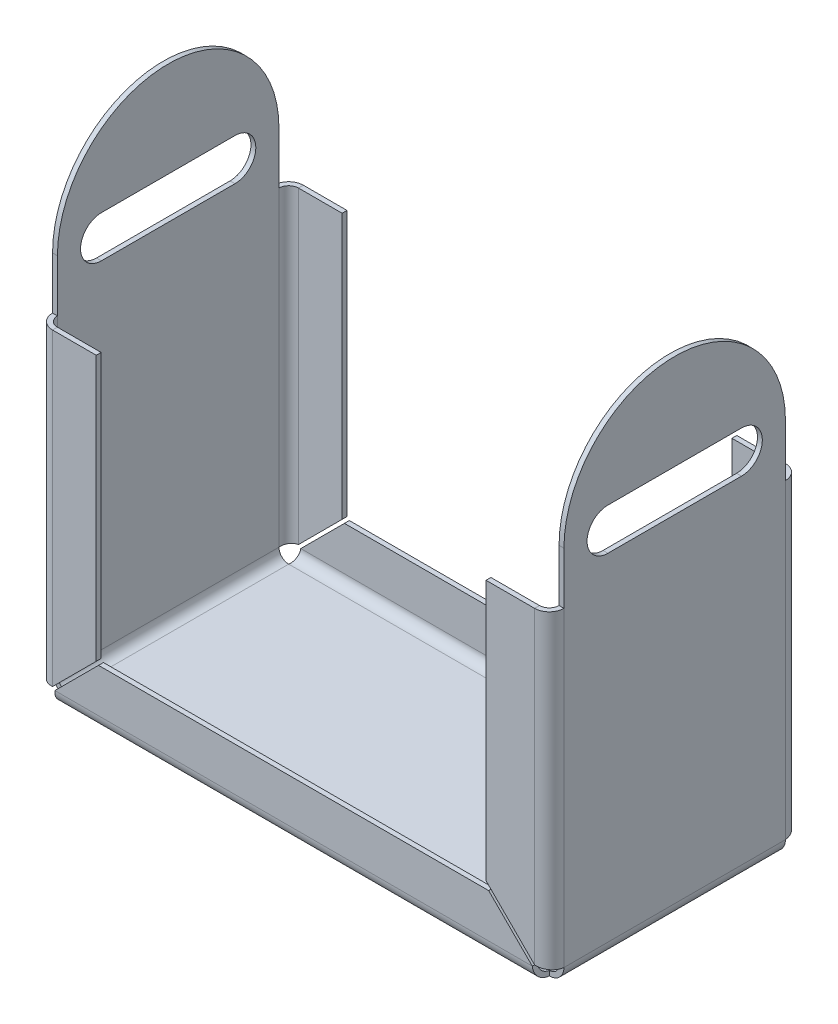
ISO-10303-21;
HEADER;
FILE_DESCRIPTION(('STEP AP214'),'2;1');
FILE_NAME('part.step','',(''),(''),'','','');
FILE_SCHEMA(('AUTOMOTIVE_DESIGN { 1 0 10303 214 1 1 1 1 }'));
ENDSEC;
DATA;
#1=APPLICATION_CONTEXT('core data for automotive mechanical design processes');
#2=APPLICATION_PROTOCOL_DEFINITION('international standard','automotive_design',2000,#1);
#3=PRODUCT_CONTEXT('',#1,'mechanical');
#4=PRODUCT('Part','Part','',(#3));
#5=PRODUCT_RELATED_PRODUCT_CATEGORY('part','',(#4));
#6=PRODUCT_DEFINITION_FORMATION('','',#4);
#7=PRODUCT_DEFINITION_CONTEXT('part definition',#1,'design');
#8=PRODUCT_DEFINITION('design','',#6,#7);
#9=PRODUCT_DEFINITION_SHAPE('','',#8);
#10=(LENGTH_UNIT() NAMED_UNIT(*) SI_UNIT(.MILLI.,.METRE.));
#11=(NAMED_UNIT(*) PLANE_ANGLE_UNIT() SI_UNIT($,.RADIAN.));
#12=(NAMED_UNIT(*) SI_UNIT($,.STERADIAN.) SOLID_ANGLE_UNIT());
#13=UNCERTAINTY_MEASURE_WITH_UNIT(LENGTH_MEASURE(1.E-05),#10,'distance_accuracy_value','');
#14=(GEOMETRIC_REPRESENTATION_CONTEXT(3) GLOBAL_UNCERTAINTY_ASSIGNED_CONTEXT((#13)) GLOBAL_UNIT_ASSIGNED_CONTEXT((#10,
#11,#12)) REPRESENTATION_CONTEXT('',''));
#15=CARTESIAN_POINT('',(0.,0.,0.));
#16=DIRECTION('',(0.,0.,1.));
#17=DIRECTION('',(1.,0.,0.));
#18=AXIS2_PLACEMENT_3D('',#15,#16,#17);
#19=CARTESIAN_POINT('',(78.5,-2.7148515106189E-13,0.));
#20=DIRECTION('',(-1.,0.,0.));
#21=DIRECTION('',(0.,-1.,0.));
#22=AXIS2_PLACEMENT_3D('',#19,#20,#21);
#23=PLANE('',#22);
#24=DIRECTION('',(0.,0.,-1.));
#25=VECTOR('',#24,1.);
#26=CARTESIAN_POINT('',(78.5000000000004,106.399999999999,20.5));
#27=LINE('',#26,#25);
#28=CARTESIAN_POINT('',(78.5000000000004,106.399999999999,20.5));
#29=VERTEX_POINT('',#28);
#30=CARTESIAN_POINT('',(78.5000000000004,106.399999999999,-20.5));
#31=VERTEX_POINT('',#30);
#32=EDGE_CURVE('E2506',#29,#31,#27,.T.);
#33=ORIENTED_EDGE('',*,*,#32,.F.);
#34=CARTESIAN_POINT('',(78.5000000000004,112.799999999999,20.5));
#35=DIRECTION('',(1.,0.,0.));
#36=DIRECTION('',(0.,1.,0.));
#37=AXIS2_PLACEMENT_3D('',#34,#35,#36);
#38=CIRCLE('',#37,6.4);
#39=CARTESIAN_POINT('',(78.5000000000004,119.199999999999,20.5));
#40=VERTEX_POINT('',#39);
#41=EDGE_CURVE('E179',#40,#29,#38,.T.);
#42=ORIENTED_EDGE('',*,*,#41,.F.);
#43=DIRECTION('',(0.,0.,1.));
#44=VECTOR('',#43,1.);
#45=CARTESIAN_POINT('',(78.5000000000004,119.199999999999,20.5));
#46=LINE('',#45,#44);
#47=CARTESIAN_POINT('',(78.5000000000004,119.199999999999,-20.5));
#48=VERTEX_POINT('',#47);
#49=EDGE_CURVE('E2496',#48,#40,#46,.T.);
#50=ORIENTED_EDGE('',*,*,#49,.F.);
#51=CARTESIAN_POINT('',(78.5000000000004,112.799999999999,-20.5));
#52=DIRECTION('',(1.,0.,0.));
#53=DIRECTION('',(0.,1.,0.));
#54=AXIS2_PLACEMENT_3D('',#51,#52,#53);
#55=CIRCLE('',#54,6.4);
#56=EDGE_CURVE('E2509',#31,#48,#55,.T.);
#57=ORIENTED_EDGE('',*,*,#56,.F.);
#58=EDGE_LOOP('',(#33,#42,#50,#57));
#59=FACE_BOUND('',#58,.T.);
#60=DIRECTION('',(0.,1.,0.));
#61=VECTOR('',#60,1.);
#62=CARTESIAN_POINT('',(78.5000000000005,148.5,-34.));
#63=LINE('',#62,#61);
#64=CARTESIAN_POINT('',(78.5000000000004,98.5,-34.));
#65=VERTEX_POINT('',#64);
#66=CARTESIAN_POINT('',(78.5000000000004,114.5,-34.));
#67=VERTEX_POINT('',#66);
#68=EDGE_CURVE('E565',#65,#67,#63,.T.);
#69=ORIENTED_EDGE('',*,*,#68,.T.);
#70=CARTESIAN_POINT('',(78.5000000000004,114.5,0.));
#71=DIRECTION('',(1.,0.,0.));
#72=DIRECTION('',(0.,1.,0.));
#73=AXIS2_PLACEMENT_3D('',#70,#71,#72);
#74=CIRCLE('',#73,34.);
#75=CARTESIAN_POINT('',(78.5000000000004,114.5,34.));
#76=VERTEX_POINT('',#75);
#77=EDGE_CURVE('E482',#67,#76,#74,.T.);
#78=ORIENTED_EDGE('',*,*,#77,.T.);
#79=DIRECTION('',(0.,-1.,0.));
#80=VECTOR('',#79,1.);
#81=CARTESIAN_POINT('',(78.5,0.,34.));
#82=LINE('',#81,#80);
#83=CARTESIAN_POINT('',(78.5000000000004,98.5,34.));
#84=VERTEX_POINT('',#83);
#85=EDGE_CURVE('E562',#76,#84,#82,.T.);
#86=ORIENTED_EDGE('',*,*,#85,.T.);
#87=DIRECTION('',(0.,1.,0.));
#88=VECTOR('',#87,1.);
#89=CARTESIAN_POINT('',(78.5000000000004,98.5,34.));
#90=LINE('',#89,#88);
#91=CARTESIAN_POINT('',(78.5,2.99999999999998,34.));
#92=VERTEX_POINT('',#91);
#93=EDGE_CURVE('E1402',#84,#92,#90,.F.);
#94=ORIENTED_EDGE('',*,*,#93,.T.);
#95=DIRECTION('',(0.,0.,1.));
#96=VECTOR('',#95,1.);
#97=CARTESIAN_POINT('',(78.5,2.99999999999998,0.));
#98=LINE('',#97,#96);
#99=CARTESIAN_POINT('',(78.5,2.99999999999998,-34.));
#100=VERTEX_POINT('',#99);
#101=EDGE_CURVE('E555',#100,#92,#98,.T.);
#102=ORIENTED_EDGE('',*,*,#101,.F.);
#103=EDGE_CURVE('E567',#100,#65,#63,.T.);
#104=ORIENTED_EDGE('',*,*,#103,.T.);
#105=EDGE_LOOP('',(#69,#78,#86,#94,#102,#104));
#106=FACE_BOUND('',#105,.T.);
#107=ADVANCED_FACE('F163',(#59,#106),#23,.F.);
#108=CARTESIAN_POINT('',(77.,-2.66247929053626E-13,0.));
#109=DIRECTION('',(-1.,0.,0.));
#110=DIRECTION('',(0.,-1.,0.));
#111=AXIS2_PLACEMENT_3D('',#108,#109,#110);
#112=PLANE('',#111);
#113=CARTESIAN_POINT('',(77.0000000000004,112.799999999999,20.5));
#114=DIRECTION('',(-1.,0.,0.));
#115=DIRECTION('',(0.,-1.,0.));
#116=AXIS2_PLACEMENT_3D('',#113,#114,#115);
#117=CIRCLE('',#116,6.4);
#118=CARTESIAN_POINT('',(77.0000000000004,106.399999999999,20.5));
#119=VERTEX_POINT('',#118);
#120=CARTESIAN_POINT('',(77.0000000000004,119.199999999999,20.5));
#121=VERTEX_POINT('',#120);
#122=EDGE_CURVE('E684',#119,#121,#117,.T.);
#123=ORIENTED_EDGE('',*,*,#122,.F.);
#124=DIRECTION('',(0.,0.,1.));
#125=VECTOR('',#124,1.);
#126=CARTESIAN_POINT('',(77.0000000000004,106.399999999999,0.));
#127=LINE('',#126,#125);
#128=CARTESIAN_POINT('',(77.0000000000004,106.399999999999,-20.5));
#129=VERTEX_POINT('',#128);
#130=EDGE_CURVE('E648',#129,#119,#127,.T.);
#131=ORIENTED_EDGE('',*,*,#130,.F.);
#132=CARTESIAN_POINT('',(77.0000000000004,112.799999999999,-20.5));
#133=DIRECTION('',(-1.,0.,0.));
#134=DIRECTION('',(0.,-1.,0.));
#135=AXIS2_PLACEMENT_3D('',#132,#133,#134);
#136=CIRCLE('',#135,6.4);
#137=CARTESIAN_POINT('',(77.0000000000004,119.199999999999,-20.5));
#138=VERTEX_POINT('',#137);
#139=EDGE_CURVE('E678',#138,#129,#136,.T.);
#140=ORIENTED_EDGE('',*,*,#139,.F.);
#141=DIRECTION('',(0.,0.,-1.));
#142=VECTOR('',#141,1.);
#143=CARTESIAN_POINT('',(77.0000000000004,119.199999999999,0.));
#144=LINE('',#143,#142);
#145=EDGE_CURVE('E681',#121,#138,#144,.T.);
#146=ORIENTED_EDGE('',*,*,#145,.F.);
#147=EDGE_LOOP('',(#123,#131,#140,#146));
#148=FACE_BOUND('',#147,.T.);
#149=CARTESIAN_POINT('',(77.0000000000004,114.5,0.));
#150=DIRECTION('',(-1.,0.,0.));
#151=DIRECTION('',(0.,-1.,0.));
#152=AXIS2_PLACEMENT_3D('',#149,#150,#151);
#153=CIRCLE('',#152,34.);
#154=CARTESIAN_POINT('',(77.0000000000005,114.5,34.));
#155=VERTEX_POINT('',#154);
#156=CARTESIAN_POINT('',(77.0000000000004,114.5,-34.));
#157=VERTEX_POINT('',#156);
#158=EDGE_CURVE('E2480',#155,#157,#153,.T.);
#159=ORIENTED_EDGE('',*,*,#158,.T.);
#160=DIRECTION('',(0.,1.,0.));
#161=VECTOR('',#160,1.);
#162=CARTESIAN_POINT('',(77.0000000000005,148.5,-34.));
#163=LINE('',#162,#161);
#164=CARTESIAN_POINT('',(77.0000000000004,98.5,-34.));
#165=VERTEX_POINT('',#164);
#166=EDGE_CURVE('E573',#165,#157,#163,.T.);
#167=ORIENTED_EDGE('',*,*,#166,.F.);
#168=CARTESIAN_POINT('',(77.,2.99999999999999,-34.));
#169=VERTEX_POINT('',#168);
#170=EDGE_CURVE('E566',#169,#165,#163,.T.);
#171=ORIENTED_EDGE('',*,*,#170,.F.);
#172=DIRECTION('',(0.,0.,-1.));
#173=VECTOR('',#172,1.);
#174=CARTESIAN_POINT('',(77.,2.99999999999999,34.));
#175=LINE('',#174,#173);
#176=CARTESIAN_POINT('',(77.,2.99999999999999,34.));
#177=VERTEX_POINT('',#176);
#178=EDGE_CURVE('E548',#177,#169,#175,.T.);
#179=ORIENTED_EDGE('',*,*,#178,.F.);
#180=DIRECTION('',(0.,1.,0.));
#181=VECTOR('',#180,1.);
#182=CARTESIAN_POINT('',(77.0000000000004,98.5,34.));
#183=LINE('',#182,#181);
#184=CARTESIAN_POINT('',(77.0000000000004,98.5,34.));
#185=VERTEX_POINT('',#184);
#186=EDGE_CURVE('E1310',#185,#177,#183,.F.);
#187=ORIENTED_EDGE('',*,*,#186,.F.);
#188=DIRECTION('',(0.,-1.,0.));
#189=VECTOR('',#188,1.);
#190=CARTESIAN_POINT('',(77.,0.,34.));
#191=LINE('',#190,#189);
#192=EDGE_CURVE('E561',#155,#185,#191,.T.);
#193=ORIENTED_EDGE('',*,*,#192,.F.);
#194=EDGE_LOOP('',(#159,#167,#171,#179,#187,#193));
#195=FACE_BOUND('',#194,.T.);
#196=ADVANCED_FACE('F787',(#148,#195),#112,.T.);
#197=CARTESIAN_POINT('',(-78.5,-2.7148515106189E-13,0.));
#198=DIRECTION('',(1.,0.,0.));
#199=DIRECTION('',(0.,1.,0.));
#200=AXIS2_PLACEMENT_3D('',#197,#198,#199);
#201=PLANE('',#200);
#202=DIRECTION('',(0.,0.,1.));
#203=VECTOR('',#202,1.);
#204=CARTESIAN_POINT('',(-78.5000000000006,119.2,20.5));
#205=LINE('',#204,#203);
#206=CARTESIAN_POINT('',(-78.5000000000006,119.2,-20.5));
#207=VERTEX_POINT('',#206);
#208=CARTESIAN_POINT('',(-78.5000000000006,119.2,20.5));
#209=VERTEX_POINT('',#208);
#210=EDGE_CURVE('E2501',#207,#209,#205,.T.);
#211=ORIENTED_EDGE('',*,*,#210,.T.);
#212=CARTESIAN_POINT('',(-78.5000000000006,112.8,20.5));
#213=DIRECTION('',(1.,0.,0.));
#214=DIRECTION('',(0.,1.,0.));
#215=AXIS2_PLACEMENT_3D('',#212,#213,#214);
#216=CIRCLE('',#215,6.4);
#217=CARTESIAN_POINT('',(-78.5000000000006,106.4,20.5));
#218=VERTEX_POINT('',#217);
#219=EDGE_CURVE('E645',#209,#218,#216,.T.);
#220=ORIENTED_EDGE('',*,*,#219,.T.);
#221=DIRECTION('',(0.,0.,-1.));
#222=VECTOR('',#221,1.);
#223=CARTESIAN_POINT('',(-78.5000000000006,106.4,20.5));
#224=LINE('',#223,#222);
#225=CARTESIAN_POINT('',(-78.5000000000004,106.4,-20.5));
#226=VERTEX_POINT('',#225);
#227=EDGE_CURVE('E2495',#218,#226,#224,.T.);
#228=ORIENTED_EDGE('',*,*,#227,.T.);
#229=CARTESIAN_POINT('',(-78.5000000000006,112.8,-20.5));
#230=DIRECTION('',(1.,0.,0.));
#231=DIRECTION('',(0.,1.,0.));
#232=AXIS2_PLACEMENT_3D('',#229,#230,#231);
#233=CIRCLE('',#232,6.4);
#234=EDGE_CURVE('E664',#226,#207,#233,.T.);
#235=ORIENTED_EDGE('',*,*,#234,.T.);
#236=EDGE_LOOP('',(#211,#220,#228,#235));
#237=FACE_BOUND('',#236,.T.);
#238=CARTESIAN_POINT('',(-78.5000000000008,114.500000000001,0.));
#239=DIRECTION('',(1.,0.,0.));
#240=DIRECTION('',(0.,1.,0.));
#241=AXIS2_PLACEMENT_3D('',#238,#239,#240);
#242=CIRCLE('',#241,34.);
#243=CARTESIAN_POINT('',(-78.5000000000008,114.500000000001,-34.));
#244=VERTEX_POINT('',#243);
#245=CARTESIAN_POINT('',(-78.5000000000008,114.500000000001,34.));
#246=VERTEX_POINT('',#245);
#247=EDGE_CURVE('E469',#244,#246,#242,.T.);
#248=ORIENTED_EDGE('',*,*,#247,.F.);
#249=DIRECTION('',(0.,-1.,0.));
#250=VECTOR('',#249,1.);
#251=CARTESIAN_POINT('',(-78.5,0.,-34.));
#252=LINE('',#251,#250);
#253=CARTESIAN_POINT('',(-78.5000000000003,98.5,-34.));
#254=VERTEX_POINT('',#253);
#255=EDGE_CURVE('E474',#244,#254,#252,.T.);
#256=ORIENTED_EDGE('',*,*,#255,.T.);
#257=DIRECTION('',(0.,1.,0.));
#258=VECTOR('',#257,1.);
#259=CARTESIAN_POINT('',(-78.5000000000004,98.5,-34.));
#260=LINE('',#259,#258);
#261=CARTESIAN_POINT('',(-78.5,2.99999999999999,-34.));
#262=VERTEX_POINT('',#261);
#263=EDGE_CURVE('E733',#254,#262,#260,.F.);
#264=ORIENTED_EDGE('',*,*,#263,.T.);
#265=DIRECTION('',(0.,0.,-1.));
#266=VECTOR('',#265,1.);
#267=CARTESIAN_POINT('',(-78.5,2.99999999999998,0.));
#268=LINE('',#267,#266);
#269=CARTESIAN_POINT('',(-78.5,2.99999999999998,34.));
#270=VERTEX_POINT('',#269);
#271=EDGE_CURVE('E510',#270,#262,#268,.T.);
#272=ORIENTED_EDGE('',*,*,#271,.F.);
#273=DIRECTION('',(0.,1.,0.));
#274=VECTOR('',#273,1.);
#275=CARTESIAN_POINT('',(-78.5000000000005,148.5,34.));
#276=LINE('',#275,#274);
#277=CARTESIAN_POINT('',(-78.5000000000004,98.5,34.));
#278=VERTEX_POINT('',#277);
#279=EDGE_CURVE('E504',#270,#278,#276,.T.);
#280=ORIENTED_EDGE('',*,*,#279,.T.);
#281=EDGE_CURVE('E477',#278,#246,#276,.T.);
#282=ORIENTED_EDGE('',*,*,#281,.T.);
#283=EDGE_LOOP('',(#248,#256,#264,#272,#280,#282));
#284=FACE_BOUND('',#283,.T.);
#285=ADVANCED_FACE('F471',(#237,#284),#201,.F.);
#286=CARTESIAN_POINT('',(-77.,-2.66247929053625E-13,0.));
#287=DIRECTION('',(1.,0.,0.));
#288=DIRECTION('',(0.,1.,0.));
#289=AXIS2_PLACEMENT_3D('',#286,#287,#288);
#290=PLANE('',#289);
#291=CARTESIAN_POINT('',(-77.0000000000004,112.8,20.5));
#292=DIRECTION('',(1.,0.,0.));
#293=DIRECTION('',(0.,1.,0.));
#294=AXIS2_PLACEMENT_3D('',#291,#292,#293);
#295=CIRCLE('',#294,6.4);
#296=CARTESIAN_POINT('',(-77.0000000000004,119.2,20.5));
#297=VERTEX_POINT('',#296);
#298=CARTESIAN_POINT('',(-77.0000000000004,106.4,20.5));
#299=VERTEX_POINT('',#298);
#300=EDGE_CURVE('E13',#297,#299,#295,.T.);
#301=ORIENTED_EDGE('',*,*,#300,.F.);
#302=DIRECTION('',(0.,0.,1.));
#303=VECTOR('',#302,1.);
#304=CARTESIAN_POINT('',(-77.0000000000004,119.2,0.));
#305=LINE('',#304,#303);
#306=CARTESIAN_POINT('',(-77.0000000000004,119.2,-20.5));
#307=VERTEX_POINT('',#306);
#308=EDGE_CURVE('E172',#307,#297,#305,.T.);
#309=ORIENTED_EDGE('',*,*,#308,.F.);
#310=CARTESIAN_POINT('',(-77.0000000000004,112.8,-20.5));
#311=DIRECTION('',(1.,0.,0.));
#312=DIRECTION('',(0.,1.,0.));
#313=AXIS2_PLACEMENT_3D('',#310,#311,#312);
#314=CIRCLE('',#313,6.4);
#315=CARTESIAN_POINT('',(-77.0000000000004,106.4,-20.5));
#316=VERTEX_POINT('',#315);
#317=EDGE_CURVE('E625',#316,#307,#314,.T.);
#318=ORIENTED_EDGE('',*,*,#317,.F.);
#319=DIRECTION('',(0.,0.,-1.));
#320=VECTOR('',#319,1.);
#321=CARTESIAN_POINT('',(-77.0000000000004,106.4,0.));
#322=LINE('',#321,#320);
#323=EDGE_CURVE('E616',#299,#316,#322,.T.);
#324=ORIENTED_EDGE('',*,*,#323,.F.);
#325=EDGE_LOOP('',(#301,#309,#318,#324));
#326=FACE_BOUND('',#325,.T.);
#327=DIRECTION('',(0.,-1.,0.));
#328=VECTOR('',#327,1.);
#329=CARTESIAN_POINT('',(-77.,0.,-34.));
#330=LINE('',#329,#328);
#331=CARTESIAN_POINT('',(-77.0000000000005,114.500000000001,-34.));
#332=VERTEX_POINT('',#331);
#333=CARTESIAN_POINT('',(-77.0000000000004,98.5,-34.));
#334=VERTEX_POINT('',#333);
#335=EDGE_CURVE('E515',#332,#334,#330,.T.);
#336=ORIENTED_EDGE('',*,*,#335,.F.);
#337=CARTESIAN_POINT('',(-77.0000000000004,114.500000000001,0.));
#338=DIRECTION('',(1.,0.,0.));
#339=DIRECTION('',(0.,1.,0.));
#340=AXIS2_PLACEMENT_3D('',#337,#338,#339);
#341=CIRCLE('',#340,34.);
#342=CARTESIAN_POINT('',(-77.0000000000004,114.500000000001,34.));
#343=VERTEX_POINT('',#342);
#344=EDGE_CURVE('E488',#332,#343,#341,.T.);
#345=ORIENTED_EDGE('',*,*,#344,.T.);
#346=DIRECTION('',(0.,1.,0.));
#347=VECTOR('',#346,1.);
#348=CARTESIAN_POINT('',(-77.0000000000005,148.5,34.));
#349=LINE('',#348,#347);
#350=CARTESIAN_POINT('',(-77.0000000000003,98.5,34.));
#351=VERTEX_POINT('',#350);
#352=EDGE_CURVE('E507',#351,#343,#349,.T.);
#353=ORIENTED_EDGE('',*,*,#352,.F.);
#354=CARTESIAN_POINT('',(-77.,2.99999999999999,34.));
#355=VERTEX_POINT('',#354);
#356=EDGE_CURVE('E499',#355,#351,#349,.T.);
#357=ORIENTED_EDGE('',*,*,#356,.F.);
#358=DIRECTION('',(0.,0.,1.));
#359=VECTOR('',#358,1.);
#360=CARTESIAN_POINT('',(-77.,2.99999999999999,-34.));
#361=LINE('',#360,#359);
#362=CARTESIAN_POINT('',(-77.,2.99999999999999,-34.));
#363=VERTEX_POINT('',#362);
#364=EDGE_CURVE('E858',#363,#355,#361,.T.);
#365=ORIENTED_EDGE('',*,*,#364,.F.);
#366=DIRECTION('',(0.,1.,0.));
#367=VECTOR('',#366,1.);
#368=CARTESIAN_POINT('',(-77.0000000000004,98.5,-34.));
#369=LINE('',#368,#367);
#370=EDGE_CURVE('E738',#334,#363,#369,.F.);
#371=ORIENTED_EDGE('',*,*,#370,.F.);
#372=EDGE_LOOP('',(#336,#345,#353,#357,#365,#371));
#373=FACE_BOUND('',#372,.T.);
#374=ADVANCED_FACE('F651',(#326,#373),#290,.T.);
#375=CARTESIAN_POINT('',(-78.5000000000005,148.5,34.));
#376=DIRECTION('',(0.,0.,-1.));
#377=DIRECTION('',(0.,1.,0.));
#378=AXIS2_PLACEMENT_3D('',#375,#376,#377);
#379=PLANE('',#378);
#380=DIRECTION('',(1.,0.,0.));
#381=VECTOR('',#380,1.);
#382=CARTESIAN_POINT('',(-78.5000000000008,114.500000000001,34.));
#383=LINE('',#382,#381);
#384=EDGE_CURVE('E2482',#246,#343,#383,.T.);
#385=ORIENTED_EDGE('',*,*,#384,.F.);
#386=ORIENTED_EDGE('',*,*,#281,.F.);
#387=DIRECTION('',(-1.,0.,0.));
#388=VECTOR('',#387,1.);
#389=CARTESIAN_POINT('',(-77.0000000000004,98.5,34.));
#390=LINE('',#389,#388);
#391=EDGE_CURVE('E986',#351,#278,#390,.T.);
#392=ORIENTED_EDGE('',*,*,#391,.F.);
#393=ORIENTED_EDGE('',*,*,#352,.T.);
#394=EDGE_LOOP('',(#385,#386,#392,#393));
#395=FACE_BOUND('',#394,.T.);
#396=ADVANCED_FACE('F809',(#395),#379,.F.);
#397=CARTESIAN_POINT('',(78.5,0.,34.));
#398=DIRECTION('',(0.,0.,-1.));
#399=DIRECTION('',(-1.,0.,0.));
#400=AXIS2_PLACEMENT_3D('',#397,#398,#399);
#401=PLANE('',#400);
#402=EDGE_CURVE('E481',#155,#76,#383,.T.);
#403=ORIENTED_EDGE('',*,*,#402,.F.);
#404=ORIENTED_EDGE('',*,*,#192,.T.);
#405=DIRECTION('',(1.,0.,0.));
#406=VECTOR('',#405,1.);
#407=CARTESIAN_POINT('',(77.0000000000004,98.5,34.));
#408=LINE('',#407,#406);
#409=EDGE_CURVE('E1298',#185,#84,#408,.T.);
#410=ORIENTED_EDGE('',*,*,#409,.T.);
#411=ORIENTED_EDGE('',*,*,#85,.F.);
#412=EDGE_LOOP('',(#403,#404,#410,#411));
#413=FACE_BOUND('',#412,.T.);
#414=ADVANCED_FACE('F805',(#413),#401,.F.);
#415=CARTESIAN_POINT('',(78.5000000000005,148.5,-34.));
#416=DIRECTION('',(0.,0.,1.));
#417=DIRECTION('',(0.,-1.,0.));
#418=AXIS2_PLACEMENT_3D('',#415,#416,#417);
#419=PLANE('',#418);
#420=ORIENTED_EDGE('',*,*,#166,.T.);
#421=DIRECTION('',(1.,0.,0.));
#422=VECTOR('',#421,1.);
#423=CARTESIAN_POINT('',(-78.5000000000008,114.500000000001,-34.));
#424=LINE('',#423,#422);
#425=EDGE_CURVE('E492',#157,#67,#424,.T.);
#426=ORIENTED_EDGE('',*,*,#425,.T.);
#427=ORIENTED_EDGE('',*,*,#68,.F.);
#428=DIRECTION('',(1.,0.,0.));
#429=VECTOR('',#428,1.);
#430=CARTESIAN_POINT('',(77.0000000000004,98.5,-34.));
#431=LINE('',#430,#429);
#432=EDGE_CURVE('E1540',#165,#65,#431,.T.);
#433=ORIENTED_EDGE('',*,*,#432,.F.);
#434=EDGE_LOOP('',(#420,#426,#427,#433));
#435=FACE_BOUND('',#434,.T.);
#436=ADVANCED_FACE('F801',(#435),#419,.F.);
#437=CARTESIAN_POINT('',(0.,-1.5,0.));
#438=DIRECTION('',(0.,-1.,0.));
#439=DIRECTION('',(0.,0.,-1.));
#440=AXIS2_PLACEMENT_3D('',#437,#438,#439);
#441=PLANE('',#440);
#442=DIRECTION('',(1.,0.,0.));
#443=VECTOR('',#442,1.);
#444=CARTESIAN_POINT('',(-77.,-1.5,34.));
#445=LINE('',#444,#443);
#446=CARTESIAN_POINT('',(-74.,-1.50000000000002,34.));
#447=VERTEX_POINT('',#446);
#448=CARTESIAN_POINT('',(74.,-1.50000000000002,34.));
#449=VERTEX_POINT('',#448);
#450=EDGE_CURVE('E611',#447,#449,#445,.T.);
#451=ORIENTED_EDGE('',*,*,#450,.F.);
#452=DIRECTION('',(0.,0.,1.));
#453=VECTOR('',#452,1.);
#454=CARTESIAN_POINT('',(-74.,-1.50000000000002,34.));
#455=LINE('',#454,#453);
#456=CARTESIAN_POINT('',(-74.,-1.50000000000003,-34.));
#457=VERTEX_POINT('',#456);
#458=EDGE_CURVE('E518',#447,#457,#455,.F.);
#459=ORIENTED_EDGE('',*,*,#458,.T.);
#460=DIRECTION('',(-1.,0.,0.));
#461=VECTOR('',#460,1.);
#462=CARTESIAN_POINT('',(-77.,-1.5,-34.));
#463=LINE('',#462,#461);
#464=CARTESIAN_POINT('',(74.,-1.50000000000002,-34.));
#465=VERTEX_POINT('',#464);
#466=EDGE_CURVE('E607',#465,#457,#463,.T.);
#467=ORIENTED_EDGE('',*,*,#466,.F.);
#468=DIRECTION('',(0.,0.,-1.));
#469=VECTOR('',#468,1.);
#470=CARTESIAN_POINT('',(74.,-1.50000000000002,-34.));
#471=LINE('',#470,#469);
#472=EDGE_CURVE('E577',#465,#449,#471,.F.);
#473=ORIENTED_EDGE('',*,*,#472,.T.);
#474=EDGE_LOOP('',(#451,#459,#467,#473));
#475=FACE_BOUND('',#474,.T.);
#476=ADVANCED_FACE('F804',(#475),#441,.T.);
#477=CARTESIAN_POINT('',(0.,0.,0.));
#478=DIRECTION('',(0.,-1.,0.));
#479=DIRECTION('',(0.,0.,-1.));
#480=AXIS2_PLACEMENT_3D('',#477,#478,#479);
#481=PLANE('',#480);
#482=DIRECTION('',(0.,0.,1.));
#483=VECTOR('',#482,1.);
#484=CARTESIAN_POINT('',(-74.,0.,34.));
#485=LINE('',#484,#483);
#486=CARTESIAN_POINT('',(-74.,0.,34.));
#487=VERTEX_POINT('',#486);
#488=CARTESIAN_POINT('',(-74.,0.,-34.));
#489=VERTEX_POINT('',#488);
#490=EDGE_CURVE('E534',#487,#489,#485,.F.);
#491=ORIENTED_EDGE('',*,*,#490,.F.);
#492=DIRECTION('',(1.,0.,0.));
#493=VECTOR('',#492,1.);
#494=CARTESIAN_POINT('',(-77.,0.,34.));
#495=LINE('',#494,#493);
#496=CARTESIAN_POINT('',(74.,0.,34.));
#497=VERTEX_POINT('',#496);
#498=EDGE_CURVE('E612',#487,#497,#495,.T.);
#499=ORIENTED_EDGE('',*,*,#498,.T.);
#500=DIRECTION('',(0.,0.,-1.));
#501=VECTOR('',#500,1.);
#502=CARTESIAN_POINT('',(74.,0.,-34.));
#503=LINE('',#502,#501);
#504=CARTESIAN_POINT('',(74.,0.,-34.));
#505=VERTEX_POINT('',#504);
#506=EDGE_CURVE('E593',#505,#497,#503,.F.);
#507=ORIENTED_EDGE('',*,*,#506,.F.);
#508=DIRECTION('',(-1.,0.,0.));
#509=VECTOR('',#508,1.);
#510=CARTESIAN_POINT('',(-77.,0.,-34.));
#511=LINE('',#510,#509);
#512=EDGE_CURVE('E603',#505,#489,#511,.T.);
#513=ORIENTED_EDGE('',*,*,#512,.T.);
#514=EDGE_LOOP('',(#491,#499,#507,#513));
#515=FACE_BOUND('',#514,.T.);
#516=ADVANCED_FACE('F165',(#515),#481,.F.);
#517=CARTESIAN_POINT('',(74.,3.,34.));
#518=DIRECTION('',(0.,0.,1.));
#519=DIRECTION('',(1.,0.,0.));
#520=AXIS2_PLACEMENT_3D('',#517,#518,#519);
#521=PLANE('',#520);
#522=DIRECTION('',(1.,0.,0.));
#523=VECTOR('',#522,1.);
#524=CARTESIAN_POINT('',(77.,2.99999999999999,34.));
#525=LINE('',#524,#523);
#526=EDGE_CURVE('E544',#177,#92,#525,.T.);
#527=ORIENTED_EDGE('',*,*,#526,.F.);
#528=CARTESIAN_POINT('',(74.,3.,34.));
#529=DIRECTION('',(0.,0.,-1.));
#530=DIRECTION('',(-1.,0.,0.));
#531=AXIS2_PLACEMENT_3D('',#528,#529,#530);
#532=CIRCLE('',#531,3.00000000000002);
#533=EDGE_CURVE('E589',#497,#177,#532,.F.);
#534=ORIENTED_EDGE('',*,*,#533,.F.);
#535=DIRECTION('',(0.,-1.,0.));
#536=VECTOR('',#535,1.);
#537=CARTESIAN_POINT('',(74.,0.,34.));
#538=LINE('',#537,#536);
#539=EDGE_CURVE('E599',#497,#449,#538,.T.);
#540=ORIENTED_EDGE('',*,*,#539,.T.);
#541=CARTESIAN_POINT('',(74.,3.,34.));
#542=DIRECTION('',(0.,0.,-1.));
#543=DIRECTION('',(-1.,0.,0.));
#544=AXIS2_PLACEMENT_3D('',#541,#542,#543);
#545=CIRCLE('',#544,4.50000000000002);
#546=EDGE_CURVE('E580',#449,#92,#545,.F.);
#547=ORIENTED_EDGE('',*,*,#546,.T.);
#548=EDGE_LOOP('',(#527,#534,#540,#547));
#549=FACE_BOUND('',#548,.T.);
#550=ADVANCED_FACE('F821',(#549),#521,.T.);
#551=CARTESIAN_POINT('',(74.,3.,-34.));
#552=DIRECTION('',(0.,0.,1.));
#553=DIRECTION('',(1.,0.,0.));
#554=AXIS2_PLACEMENT_3D('',#551,#552,#553);
#555=PLANE('',#554);
#556=CARTESIAN_POINT('',(74.,3.,-34.));
#557=DIRECTION('',(0.,0.,-1.));
#558=DIRECTION('',(-1.,0.,0.));
#559=AXIS2_PLACEMENT_3D('',#556,#557,#558);
#560=CIRCLE('',#559,3.00000000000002);
#561=EDGE_CURVE('E570',#169,#505,#560,.T.);
#562=ORIENTED_EDGE('',*,*,#561,.F.);
#563=DIRECTION('',(1.,0.,0.));
#564=VECTOR('',#563,1.);
#565=CARTESIAN_POINT('',(77.,2.99999999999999,-34.));
#566=LINE('',#565,#564);
#567=EDGE_CURVE('E551',#169,#100,#566,.T.);
#568=ORIENTED_EDGE('',*,*,#567,.T.);
#569=CARTESIAN_POINT('',(74.,3.,-34.));
#570=DIRECTION('',(0.,0.,-1.));
#571=DIRECTION('',(-1.,0.,0.));
#572=AXIS2_PLACEMENT_3D('',#569,#570,#571);
#573=CIRCLE('',#572,4.50000000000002);
#574=EDGE_CURVE('E581',#100,#465,#573,.T.);
#575=ORIENTED_EDGE('',*,*,#574,.T.);
#576=DIRECTION('',(0.,-1.,0.));
#577=VECTOR('',#576,1.);
#578=CARTESIAN_POINT('',(74.,0.,-34.));
#579=LINE('',#578,#577);
#580=EDGE_CURVE('E585',#505,#465,#579,.T.);
#581=ORIENTED_EDGE('',*,*,#580,.F.);
#582=EDGE_LOOP('',(#562,#568,#575,#581));
#583=FACE_BOUND('',#582,.T.);
#584=ADVANCED_FACE('F815',(#583),#555,.F.);
#585=CARTESIAN_POINT('',(74.,3.,-34.));
#586=DIRECTION('',(0.,0.,-1.));
#587=DIRECTION('',(1.,0.,0.));
#588=AXIS2_PLACEMENT_3D('',#585,#586,#587);
#589=CYLINDRICAL_SURFACE('',#588,4.50000000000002);
#590=ORIENTED_EDGE('',*,*,#472,.F.);
#591=ORIENTED_EDGE('',*,*,#574,.F.);
#592=ORIENTED_EDGE('',*,*,#101,.T.);
#593=ORIENTED_EDGE('',*,*,#546,.F.);
#594=EDGE_LOOP('',(#590,#591,#592,#593));
#595=FACE_BOUND('',#594,.T.);
#596=ADVANCED_FACE('F811',(#595),#589,.T.);
#597=CARTESIAN_POINT('',(74.,3.,-34.));
#598=DIRECTION('',(0.,0.,-1.));
#599=DIRECTION('',(1.,0.,0.));
#600=AXIS2_PLACEMENT_3D('',#597,#598,#599);
#601=CYLINDRICAL_SURFACE('',#600,3.00000000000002);
#602=ORIENTED_EDGE('',*,*,#506,.T.);
#603=ORIENTED_EDGE('',*,*,#533,.T.);
#604=ORIENTED_EDGE('',*,*,#178,.T.);
#605=ORIENTED_EDGE('',*,*,#561,.T.);
#606=EDGE_LOOP('',(#602,#603,#604,#605));
#607=FACE_BOUND('',#606,.T.);
#608=ADVANCED_FACE('F814',(#607),#601,.F.);
#609=CARTESIAN_POINT('',(-74.,3.,-34.));
#610=DIRECTION('',(0.,0.,-1.));
#611=DIRECTION('',(-1.,0.,0.));
#612=AXIS2_PLACEMENT_3D('',#609,#610,#611);
#613=PLANE('',#612);
#614=DIRECTION('',(-1.,0.,0.));
#615=VECTOR('',#614,1.);
#616=CARTESIAN_POINT('',(-77.,2.99999999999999,-34.));
#617=LINE('',#616,#615);
#618=EDGE_CURVE('E852',#363,#262,#617,.T.);
#619=ORIENTED_EDGE('',*,*,#618,.F.);
#620=CARTESIAN_POINT('',(-74.,3.,-34.));
#621=DIRECTION('',(0.,0.,1.));
#622=DIRECTION('',(1.,0.,0.));
#623=AXIS2_PLACEMENT_3D('',#620,#621,#622);
#624=CIRCLE('',#623,3.00000000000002);
#625=EDGE_CURVE('E530',#489,#363,#624,.F.);
#626=ORIENTED_EDGE('',*,*,#625,.F.);
#627=DIRECTION('',(0.,-1.,0.));
#628=VECTOR('',#627,1.);
#629=CARTESIAN_POINT('',(-74.,0.,-34.));
#630=LINE('',#629,#628);
#631=EDGE_CURVE('E540',#489,#457,#630,.T.);
#632=ORIENTED_EDGE('',*,*,#631,.T.);
#633=CARTESIAN_POINT('',(-74.,3.,-34.));
#634=DIRECTION('',(0.,0.,1.));
#635=DIRECTION('',(1.,0.,0.));
#636=AXIS2_PLACEMENT_3D('',#633,#634,#635);
#637=CIRCLE('',#636,4.50000000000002);
#638=EDGE_CURVE('E521',#457,#262,#637,.F.);
#639=ORIENTED_EDGE('',*,*,#638,.T.);
#640=EDGE_LOOP('',(#619,#626,#632,#639));
#641=FACE_BOUND('',#640,.T.);
#642=ADVANCED_FACE('F819',(#641),#613,.T.);
#643=CARTESIAN_POINT('',(-74.,3.,34.));
#644=DIRECTION('',(0.,0.,-1.));
#645=DIRECTION('',(-1.,0.,0.));
#646=AXIS2_PLACEMENT_3D('',#643,#644,#645);
#647=PLANE('',#646);
#648=CARTESIAN_POINT('',(-74.,3.,34.));
#649=DIRECTION('',(0.,0.,1.));
#650=DIRECTION('',(1.,0.,0.));
#651=AXIS2_PLACEMENT_3D('',#648,#649,#650);
#652=CIRCLE('',#651,3.00000000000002);
#653=EDGE_CURVE('E514',#355,#487,#652,.T.);
#654=ORIENTED_EDGE('',*,*,#653,.F.);
#655=DIRECTION('',(-1.,0.,0.));
#656=VECTOR('',#655,1.);
#657=CARTESIAN_POINT('',(-77.,2.99999999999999,34.));
#658=LINE('',#657,#656);
#659=EDGE_CURVE('E954',#355,#270,#658,.T.);
#660=ORIENTED_EDGE('',*,*,#659,.T.);
#661=CARTESIAN_POINT('',(-74.,3.,34.));
#662=DIRECTION('',(0.,0.,1.));
#663=DIRECTION('',(1.,0.,0.));
#664=AXIS2_PLACEMENT_3D('',#661,#662,#663);
#665=CIRCLE('',#664,4.50000000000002);
#666=EDGE_CURVE('E522',#270,#447,#665,.T.);
#667=ORIENTED_EDGE('',*,*,#666,.T.);
#668=DIRECTION('',(0.,-1.,0.));
#669=VECTOR('',#668,1.);
#670=CARTESIAN_POINT('',(-74.,0.,34.));
#671=LINE('',#670,#669);
#672=EDGE_CURVE('E526',#487,#447,#671,.T.);
#673=ORIENTED_EDGE('',*,*,#672,.F.);
#674=EDGE_LOOP('',(#654,#660,#667,#673));
#675=FACE_BOUND('',#674,.T.);
#676=ADVANCED_FACE('F798',(#675),#647,.F.);
#677=CARTESIAN_POINT('',(-74.,3.,34.));
#678=DIRECTION('',(0.,0.,1.));
#679=DIRECTION('',(-1.,0.,0.));
#680=AXIS2_PLACEMENT_3D('',#677,#678,#679);
#681=CYLINDRICAL_SURFACE('',#680,4.50000000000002);
#682=ORIENTED_EDGE('',*,*,#458,.F.);
#683=ORIENTED_EDGE('',*,*,#666,.F.);
#684=ORIENTED_EDGE('',*,*,#271,.T.);
#685=ORIENTED_EDGE('',*,*,#638,.F.);
#686=EDGE_LOOP('',(#682,#683,#684,#685));
#687=FACE_BOUND('',#686,.T.);
#688=ADVANCED_FACE('F930',(#687),#681,.T.);
#689=CARTESIAN_POINT('',(-74.,3.,34.));
#690=DIRECTION('',(0.,0.,1.));
#691=DIRECTION('',(-1.,0.,0.));
#692=AXIS2_PLACEMENT_3D('',#689,#690,#691);
#693=CYLINDRICAL_SURFACE('',#692,3.00000000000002);
#694=ORIENTED_EDGE('',*,*,#490,.T.);
#695=ORIENTED_EDGE('',*,*,#625,.T.);
#696=ORIENTED_EDGE('',*,*,#364,.T.);
#697=ORIENTED_EDGE('',*,*,#653,.T.);
#698=EDGE_LOOP('',(#694,#695,#696,#697));
#699=FACE_BOUND('',#698,.T.);
#700=ADVANCED_FACE('F929',(#699),#693,.F.);
#701=CARTESIAN_POINT('',(-78.5,0.,-34.));
#702=DIRECTION('',(0.,0.,1.));
#703=DIRECTION('',(1.,0.,0.));
#704=AXIS2_PLACEMENT_3D('',#701,#702,#703);
#705=PLANE('',#704);
#706=ORIENTED_EDGE('',*,*,#255,.F.);
#707=EDGE_CURVE('E485',#244,#332,#424,.T.);
#708=ORIENTED_EDGE('',*,*,#707,.T.);
#709=ORIENTED_EDGE('',*,*,#335,.T.);
#710=DIRECTION('',(-1.,0.,0.));
#711=VECTOR('',#710,1.);
#712=CARTESIAN_POINT('',(-77.0000000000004,98.5,-34.));
#713=LINE('',#712,#711);
#714=EDGE_CURVE('E497',#334,#254,#713,.T.);
#715=ORIENTED_EDGE('',*,*,#714,.T.);
#716=EDGE_LOOP('',(#706,#708,#709,#715));
#717=FACE_BOUND('',#716,.T.);
#718=ADVANCED_FACE('F495',(#717),#705,.F.);
#719=CARTESIAN_POINT('',(-74.,-1.51500000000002,34.));
#720=CARTESIAN_POINT('',(-73.9410639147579,-1.51500000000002,34.591117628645));
#721=CARTESIAN_POINT('',(-73.8821488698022,-1.39748663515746,35.1817916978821));
#722=CARTESIAN_POINT('',(-73.7642977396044,-0.945145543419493,36.2738396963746));
#723=CARTESIAN_POINT('',(-73.7053721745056,-0.610495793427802,36.7746784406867));
#724=CARTESIAN_POINT('',(-73.5875210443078,0.225321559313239,37.6104957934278));
#725=CARTESIAN_POINT('',(-73.5285954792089,0.726160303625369,37.9451455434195));
#726=CARTESIAN_POINT('',(-73.4107443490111,1.81820830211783,38.3974866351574));
#727=CARTESIAN_POINT('',(-73.3518293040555,2.40888237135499,38.515));
#728=CARTESIAN_POINT('',(-73.2928932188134,2.99999999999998,38.515));
#729=CARTESIAN_POINT('',(-74.,-1.50000000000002,34.));
#730=CARTESIAN_POINT('',(-73.9410639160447,-1.50000000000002,34.5891537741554));
#731=CARTESIAN_POINT('',(-73.8821488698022,-1.38287704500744,35.1778654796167));
#732=CARTESIAN_POINT('',(-73.7642977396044,-0.932038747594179,36.266285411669));
#733=CARTESIAN_POINT('',(-73.7053721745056,-0.59850079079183,36.7654602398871));
#734=CARTESIAN_POINT('',(-73.5875210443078,0.234539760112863,37.5985007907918));
#735=CARTESIAN_POINT('',(-73.5285954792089,0.733714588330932,37.9320387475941));
#736=CARTESIAN_POINT('',(-73.4107443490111,1.82213452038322,38.3828770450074));
#737=CARTESIAN_POINT('',(-73.3518293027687,2.41084622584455,38.5));
#738=CARTESIAN_POINT('',(-73.2928932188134,2.99999999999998,38.5));
#739=CARTESIAN_POINT('',(-74.,0.,34.));
#740=CARTESIAN_POINT('',(-73.9410640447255,0.,34.3927683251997));
#741=CARTESIAN_POINT('',(-73.8821488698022,0.0780819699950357,34.7852436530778));
#742=CARTESIAN_POINT('',(-73.7642977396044,0.378640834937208,35.5108569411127));
#743=CARTESIAN_POINT('',(-73.7053721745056,0.600999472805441,35.8436401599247));
#744=CARTESIAN_POINT('',(-73.5875210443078,1.15635984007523,36.3990005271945));
#745=CARTESIAN_POINT('',(-73.5285954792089,1.48914305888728,36.6213591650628));
#746=CARTESIAN_POINT('',(-73.4107443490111,2.21475634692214,36.9219180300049));
#747=CARTESIAN_POINT('',(-73.3518291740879,2.60723167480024,37.));
#748=CARTESIAN_POINT('',(-73.2928932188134,2.99999999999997,37.));
#749=CARTESIAN_POINT('',(-74.,0.0151499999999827,34.));
#750=CARTESIAN_POINT('',(-73.9410640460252,0.0151499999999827,34.3907848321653));
#751=CARTESIAN_POINT('',(-73.8821488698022,0.0928376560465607,34.7812781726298));
#752=CARTESIAN_POINT('',(-73.7642977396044,0.391878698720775,35.5032271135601));
#753=CARTESIAN_POINT('',(-73.7053721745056,0.613114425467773,35.8343297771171));
#754=CARTESIAN_POINT('',(-73.5875210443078,1.16567022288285,36.3868855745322));
#755=CARTESIAN_POINT('',(-73.5285954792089,1.4967728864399,36.6081213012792));
#756=CARTESIAN_POINT('',(-73.4107443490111,2.21872182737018,36.9071623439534));
#757=CARTESIAN_POINT('',(-73.3518291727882,2.60921516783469,36.98485));
#758=CARTESIAN_POINT('',(-73.2928932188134,2.99999999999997,36.98485));
#759=B_SPLINE_SURFACE_WITH_KNOTS('',1,3,((#719,#720,#721,#722,#723,#724,#725,#726,#727,#728),
(#729,#730,#731,#732,#733,#734,#735,#736,#737,#738),(#739,#740,#741,#742,#743,#744,#745,#746,
#747,#748),(#749,#750,#751,#752,#753,#754,#755,#756,#757,#758)),.UNSPECIFIED.,.F.,.F.,.F.,(2,1,
1,2),(4,2,2,2,4),(-0.01,0.,1.,1.0101),(0.,0.25,0.5,0.75,1.),.UNSPECIFIED.);
#760=DIRECTION('',(0.,0.,-1.));
#761=VECTOR('',#760,1.);
#762=CARTESIAN_POINT('',(-73.2928932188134,2.99999999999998,37.));
#763=LINE('',#762,#761);
#764=CARTESIAN_POINT('',(-73.2928932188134,2.99999999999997,38.5));
#765=VERTEX_POINT('',#764);
#766=CARTESIAN_POINT('',(-73.2928932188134,2.99999999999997,37.));
#767=VERTEX_POINT('',#766);
#768=EDGE_CURVE('E1267',#765,#767,#763,.T.);
#769=CARTESIAN_POINT('',(-74.,0.,34.));
#770=CARTESIAN_POINT('',(-73.9871957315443,-8.4712008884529E-06,34.0853281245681));
#771=CARTESIAN_POINT('',(-73.9743921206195,0.00364040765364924,34.1706523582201));
#772=CARTESIAN_POINT('',(-73.9487860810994,0.0181874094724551,34.3406766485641));
#773=CARTESIAN_POINT('',(-73.9359836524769,0.0290851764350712,34.4253767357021));
#774=CARTESIAN_POINT('',(-73.91038836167,0.0580534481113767,34.5934806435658));
#775=CARTESIAN_POINT('',(-73.8975954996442,0.0761184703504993,34.6768854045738));
#776=CARTESIAN_POINT('',(-73.8720123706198,0.119271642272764,34.8418324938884));
#777=CARTESIAN_POINT('',(-73.8592221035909,0.144359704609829,34.9233748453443));
#778=CARTESIAN_POINT('',(-73.8208402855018,0.229952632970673,35.1644089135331));
#779=CARTESIAN_POINT('',(-73.7952285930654,0.300796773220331,35.3203684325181));
#780=CARTESIAN_POINT('',(-73.7440275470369,0.467884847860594,35.6178807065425));
#781=CARTESIAN_POINT('',(-73.7184381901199,0.564123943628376,35.7594361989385));
#782=CARTESIAN_POINT('',(-73.6672524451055,0.77923879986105,36.0241770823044));
#783=CARTESIAN_POINT('',(-73.641656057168,0.898114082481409,36.1473628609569));
#784=CARTESIAN_POINT('',(-73.5904610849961,1.15508206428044,36.3717896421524));
#785=CARTESIAN_POINT('',(-73.5648625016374,1.29317923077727,36.4730255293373));
#786=CARTESIAN_POINT('',(-73.5136593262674,1.58457332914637,36.6506031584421));
#787=CARTESIAN_POINT('',(-73.4880547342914,1.7378739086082,36.7269389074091));
#788=CARTESIAN_POINT('',(-73.436854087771,2.05516765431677,36.8524279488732));
#789=CARTESIAN_POINT('',(-73.4112580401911,2.21915310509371,36.9016006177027));
#790=CARTESIAN_POINT('',(-73.3702009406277,2.48698222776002,36.9576147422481));
#791=CARTESIAN_POINT('',(-73.3547269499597,2.58901836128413,36.9735037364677));
#792=CARTESIAN_POINT('',(-73.3238024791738,2.79402155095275,36.9946919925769));
#793=CARTESIAN_POINT('',(-73.3083520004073,2.89698688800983,37.0000078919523));
#794=CARTESIAN_POINT('',(-73.2928932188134,2.99999999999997,37.));
#795=B_SPLINE_CURVE_WITH_KNOTS('',3,(#769,#770,#771,#772,#773,#774,#775,#776,#777,#778,#779,
#780,#781,#782,#783,#784,#785,#786,#787,#788,#789,#790,#791,#792,#793,#794),.UNSPECIFIED.,.F.,
.F.,(4,2,2,2,2,2,2,2,2,2,2,2,4),(0.,0.258766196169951,0.517519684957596,0.776075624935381,
1.03462834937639,1.55154905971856,2.06837134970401,2.58518273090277,3.10211442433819,
3.61917044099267,4.13585714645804,4.44861865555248,4.76088762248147),.UNSPECIFIED.);
#796=EDGE_CURVE('E845',#487,#767,#795,.T.);
#797=CARTESIAN_POINT('',(-74.,-1.50000000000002,34.));
#798=CARTESIAN_POINT('',(-73.9872750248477,-1.5000138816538,34.1272000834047));
#799=CARTESIAN_POINT('',(-73.974550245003,-1.49460729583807,34.2543981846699));
#800=CARTESIAN_POINT('',(-73.9491018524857,-1.47305344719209,34.5078752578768));
#801=CARTESIAN_POINT('',(-73.9363782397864,-1.45690670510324,34.6341542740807));
#802=CARTESIAN_POINT('',(-73.910941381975,-1.41398907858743,34.8847953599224));
#803=CARTESIAN_POINT('',(-73.8982281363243,-1.38722626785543,35.0091588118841));
#804=CARTESIAN_POINT('',(-73.8728006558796,-1.32327318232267,35.255173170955));
#805=CARTESIAN_POINT('',(-73.8600864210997,-1.28608303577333,35.376824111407));
#806=CARTESIAN_POINT('',(-73.834653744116,-1.20152671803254,35.6165820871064));
#807=CARTESIAN_POINT('',(-73.8219353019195,-1.15415716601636,35.7346879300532));
#808=CARTESIAN_POINT('',(-73.7964934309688,-1.049570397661,35.9665083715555));
#809=CARTESIAN_POINT('',(-73.7837700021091,-0.992349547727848,36.0802213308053));
#810=CARTESIAN_POINT('',(-73.7583313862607,-0.868517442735,36.3023315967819));
#811=CARTESIAN_POINT('',(-73.745616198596,-0.801911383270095,36.410731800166));
#812=CARTESIAN_POINT('',(-73.7201810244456,-0.659736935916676,36.621544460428));
#813=CARTESIAN_POINT('',(-73.707461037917,-0.584165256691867,36.7239546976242));
#814=CARTESIAN_POINT('',(-73.6820248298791,-0.424652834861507,36.9219702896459));
#815=CARTESIAN_POINT('',(-73.6693086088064,-0.340715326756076,37.0175782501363));
#816=CARTESIAN_POINT('',(-73.6438716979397,-0.165016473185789,37.2013809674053));
#817=CARTESIAN_POINT('',(-73.6311510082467,-0.0732522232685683,37.2895729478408));
#818=CARTESIAN_POINT('',(-73.6057116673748,0.117399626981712,37.4578576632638));
#819=CARTESIAN_POINT('',(-73.5929930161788,0.216286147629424,37.5379516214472));
#820=CARTESIAN_POINT('',(-73.5675522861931,0.420521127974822,37.68950739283));
#821=CARTESIAN_POINT('',(-73.5548302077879,0.525871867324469,37.760966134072));
#822=CARTESIAN_POINT('',(-73.5293847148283,0.742250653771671,37.8947072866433));
#823=CARTESIAN_POINT('',(-73.5166613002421,0.853278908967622,37.9569893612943));
#824=CARTESIAN_POINT('',(-73.4912140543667,1.08021103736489,38.0719268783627));
#825=CARTESIAN_POINT('',(-73.4784902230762,1.19611492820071,38.124582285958));
#826=CARTESIAN_POINT('',(-73.4530489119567,1.43190569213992,38.21986227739));
#827=CARTESIAN_POINT('',(-73.4403314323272,1.55179042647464,38.2624921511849));
#828=CARTESIAN_POINT('',(-73.4149012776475,1.79470093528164,38.3374434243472));
#829=CARTESIAN_POINT('',(-73.4021886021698,1.91772596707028,38.3697672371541));
#830=CARTESIAN_POINT('',(-73.3733677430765,2.19923932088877,38.4311029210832));
#831=CARTESIAN_POINT('',(-73.3572586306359,2.35843137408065,38.4569298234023));
#832=CARTESIAN_POINT('',(-73.3250635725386,2.67842355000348,38.4913857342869));
#833=CARTESIAN_POINT('',(-73.3089776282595,2.83922091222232,38.5000404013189));
#834=CARTESIAN_POINT('',(-73.2928932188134,2.99999999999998,38.5));
#835=B_SPLINE_CURVE_WITH_KNOTS('',3,(#797,#798,#799,#800,#801,#802,#803,#804,#805,#806,#807,
#808,#809,#810,#811,#812,#813,#814,#815,#816,#817,#818,#819,#820,#821,#822,#823,#824,#825,#826,
#827,#828,#829,#830,#831,#832,#833,#834),.UNSPECIFIED.,.F.,.F.,(4,2,2,2,2,2,2,2,2,2,2,2,2,2,2,2,
2,2,4),(0.,0.383387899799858,0.766757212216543,1.14983552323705,1.53290912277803,
1.91611014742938,2.29945281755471,2.6825840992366,3.06585646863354,3.44898122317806,
3.83224877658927,4.21545835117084,4.5988038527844,4.98216341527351,5.36552436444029,
5.74868257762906,6.1317509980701,6.61703066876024,7.10158469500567),.UNSPECIFIED.);
#836=EDGE_CURVE('E842',#447,#765,#835,.T.);
#837=ORIENTED_EDGE('',*,*,#768,.T.);
#838=ORIENTED_EDGE('',*,*,#796,.F.);
#839=ORIENTED_EDGE('',*,*,#672,.T.);
#840=ORIENTED_EDGE('',*,*,#836,.T.);
#841=EDGE_LOOP('',(#837,#838,#839,#840));
#842=FACE_BOUND('',#841,.T.);
#843=ADVANCED_FACE('F841',(#842),#759,.F.);
#844=CARTESIAN_POINT('',(73.2928932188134,2.99999999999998,38.515));
#845=CARTESIAN_POINT('',(73.3518293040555,2.40888237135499,38.515));
#846=CARTESIAN_POINT('',(73.4107443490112,1.81820830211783,38.3974866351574));
#847=CARTESIAN_POINT('',(73.5285954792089,0.726160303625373,37.9451455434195));
#848=CARTESIAN_POINT('',(73.5875210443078,0.225321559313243,37.6104957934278));
#849=CARTESIAN_POINT('',(73.7053721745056,-0.6104957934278,36.7746784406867));
#850=CARTESIAN_POINT('',(73.7642977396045,-0.94514554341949,36.2738396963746));
#851=CARTESIAN_POINT('',(73.8821488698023,-1.39748663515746,35.1817916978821));
#852=CARTESIAN_POINT('',(73.9410639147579,-1.51500000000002,34.591117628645));
#853=CARTESIAN_POINT('',(74.,-1.51500000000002,34.));
#854=CARTESIAN_POINT('',(73.2928932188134,2.99999999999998,38.5));
#855=CARTESIAN_POINT('',(73.3518293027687,2.41084622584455,38.5));
#856=CARTESIAN_POINT('',(73.4107443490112,1.82213452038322,38.3828770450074));
#857=CARTESIAN_POINT('',(73.5285954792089,0.733714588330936,37.9320387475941));
#858=CARTESIAN_POINT('',(73.5875210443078,0.234539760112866,37.5985007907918));
#859=CARTESIAN_POINT('',(73.7053721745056,-0.598500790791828,36.7654602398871));
#860=CARTESIAN_POINT('',(73.7642977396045,-0.932038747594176,36.266285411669));
#861=CARTESIAN_POINT('',(73.8821488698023,-1.38287704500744,35.1778654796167));
#862=CARTESIAN_POINT('',(73.9410639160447,-1.50000000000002,34.5891537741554));
#863=CARTESIAN_POINT('',(74.,-1.50000000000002,34.));
#864=CARTESIAN_POINT('',(73.2928932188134,2.99999999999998,37.));
#865=CARTESIAN_POINT('',(73.3518291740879,2.60723167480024,37.));
#866=CARTESIAN_POINT('',(73.4107443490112,2.21475634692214,36.9219180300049));
#867=CARTESIAN_POINT('',(73.5285954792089,1.48914305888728,36.6213591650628));
#868=CARTESIAN_POINT('',(73.5875210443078,1.15635984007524,36.3990005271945));
#869=CARTESIAN_POINT('',(73.7053721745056,0.600999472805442,35.8436401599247));
#870=CARTESIAN_POINT('',(73.7642977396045,0.378640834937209,35.5108569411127));
#871=CARTESIAN_POINT('',(73.8821488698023,0.0780819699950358,34.7852436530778));
#872=CARTESIAN_POINT('',(73.9410640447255,0.,34.3927683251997));
#873=CARTESIAN_POINT('',(74.,0.,34.));
#874=CARTESIAN_POINT('',(73.2928932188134,2.99999999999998,36.98485));
#875=CARTESIAN_POINT('',(73.3518291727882,2.60921516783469,36.98485));
#876=CARTESIAN_POINT('',(73.4107443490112,2.21872182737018,36.9071623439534));
#877=CARTESIAN_POINT('',(73.5285954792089,1.4967728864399,36.6081213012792));
#878=CARTESIAN_POINT('',(73.5875210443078,1.16567022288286,36.3868855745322));
#879=CARTESIAN_POINT('',(73.7053721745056,0.613114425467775,35.8343297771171));
#880=CARTESIAN_POINT('',(73.7642977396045,0.391878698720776,35.5032271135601));
#881=CARTESIAN_POINT('',(73.8821488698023,0.0928376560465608,34.7812781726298));
#882=CARTESIAN_POINT('',(73.9410640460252,0.0151499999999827,34.3907848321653));
#883=CARTESIAN_POINT('',(74.,0.0151499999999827,34.));
#884=B_SPLINE_SURFACE_WITH_KNOTS('',1,3,((#844,#845,#846,#847,#848,#849,#850,#851,#852,#853),
(#854,#855,#856,#857,#858,#859,#860,#861,#862,#863),(#864,#865,#866,#867,#868,#869,#870,#871,
#872,#873),(#874,#875,#876,#877,#878,#879,#880,#881,#882,#883)),.UNSPECIFIED.,.F.,.F.,.F.,(2,1,
1,2),(4,2,2,2,4),(-0.01,0.,1.,1.0101),(0.,0.25,0.5,0.75,1.),.UNSPECIFIED.);
#885=CARTESIAN_POINT('',(73.2928932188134,2.99999999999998,37.));
#886=CARTESIAN_POINT('',(73.3056974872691,2.91467187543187,37.0000084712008));
#887=CARTESIAN_POINT('',(73.3185010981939,2.82934764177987,36.9963595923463));
#888=CARTESIAN_POINT('',(73.344107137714,2.65932335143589,36.9818125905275));
#889=CARTESIAN_POINT('',(73.3569095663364,2.57462326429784,36.9709148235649));
#890=CARTESIAN_POINT('',(73.3825048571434,2.40651935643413,36.9419465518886));
#891=CARTESIAN_POINT('',(73.3952977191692,2.32311459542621,36.9238815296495));
#892=CARTESIAN_POINT('',(73.4208808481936,2.15816750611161,36.8807283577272));
#893=CARTESIAN_POINT('',(73.4336711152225,2.07662515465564,36.8556402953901));
#894=CARTESIAN_POINT('',(73.4720529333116,1.83559108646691,36.7700473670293));
#895=CARTESIAN_POINT('',(73.4976646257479,1.67963156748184,36.6992032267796));
#896=CARTESIAN_POINT('',(73.5488656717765,1.38211929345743,36.5321151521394));
#897=CARTESIAN_POINT('',(73.5744550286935,1.24056380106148,36.4358760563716));
#898=CARTESIAN_POINT('',(73.6256407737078,0.97582291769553,36.2207612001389));
#899=CARTESIAN_POINT('',(73.6512371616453,0.852637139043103,36.1018859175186));
#900=CARTESIAN_POINT('',(73.7024321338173,0.628210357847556,35.8449179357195));
#901=CARTESIAN_POINT('',(73.7280307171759,0.526974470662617,35.7068207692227));
#902=CARTESIAN_POINT('',(73.779233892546,0.349396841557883,35.4154266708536));
#903=CARTESIAN_POINT('',(73.804838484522,0.273061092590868,35.2621260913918));
#904=CARTESIAN_POINT('',(73.8560391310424,0.147572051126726,34.9448323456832));
#905=CARTESIAN_POINT('',(73.8816351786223,0.0983993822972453,34.7808468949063));
#906=CARTESIAN_POINT('',(73.9226922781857,0.0423852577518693,34.51301777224));
#907=CARTESIAN_POINT('',(73.9381662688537,0.0264962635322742,34.4109816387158));
#908=CARTESIAN_POINT('',(73.9690907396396,0.00530800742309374,34.2059784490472));
#909=CARTESIAN_POINT('',(73.9845412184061,-7.89195231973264E-06,34.1030131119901));
#910=CARTESIAN_POINT('',(74.,0.,34.));
#911=B_SPLINE_CURVE_WITH_KNOTS('',3,(#885,#886,#887,#888,#889,#890,#891,#892,#893,#894,#895,
#896,#897,#898,#899,#900,#901,#902,#903,#904,#905,#906,#907,#908,#909,#910),.UNSPECIFIED.,.F.,
.F.,(4,2,2,2,2,2,2,2,2,2,2,2,4),(0.,0.25876619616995,0.517519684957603,0.77607562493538,
1.0346283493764,1.55154905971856,2.068371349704,2.58518273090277,3.10211442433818,
3.61917044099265,4.13585714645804,4.44861865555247,4.76088762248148),.UNSPECIFIED.);
#912=CARTESIAN_POINT('',(73.2928932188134,2.99999999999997,37.));
#913=VERTEX_POINT('',#912);
#914=EDGE_CURVE('E897',#913,#497,#911,.T.);
#915=DIRECTION('',(0.,0.,1.));
#916=VECTOR('',#915,1.);
#917=CARTESIAN_POINT('',(73.2928932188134,2.99999999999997,37.));
#918=LINE('',#917,#916);
#919=CARTESIAN_POINT('',(73.2928932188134,2.99999999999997,38.5));
#920=VERTEX_POINT('',#919);
#921=EDGE_CURVE('E905',#920,#913,#918,.F.);
#922=CARTESIAN_POINT('',(73.2928932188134,2.99999999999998,38.5));
#923=CARTESIAN_POINT('',(73.3056181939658,2.87279991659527,38.5000138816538));
#924=CARTESIAN_POINT('',(73.3183429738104,2.74560181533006,38.494607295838));
#925=CARTESIAN_POINT('',(73.3437913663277,2.49212474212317,38.4730534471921));
#926=CARTESIAN_POINT('',(73.356514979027,2.3658457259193,38.4569067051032));
#927=CARTESIAN_POINT('',(73.3819518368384,2.1152046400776,38.4139890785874));
#928=CARTESIAN_POINT('',(73.3946650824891,1.99084118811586,38.3872262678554));
#929=CARTESIAN_POINT('',(73.4200925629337,1.74482682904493,38.3232731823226));
#930=CARTESIAN_POINT('',(73.4328067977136,1.62317588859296,38.2860830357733));
#931=CARTESIAN_POINT('',(73.4582394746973,1.3834179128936,38.2015267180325));
#932=CARTESIAN_POINT('',(73.4709579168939,1.26531206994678,38.1541571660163));
#933=CARTESIAN_POINT('',(73.4963997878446,1.03349162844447,38.049570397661));
#934=CARTESIAN_POINT('',(73.5091232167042,0.919778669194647,37.9923495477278));
#935=CARTESIAN_POINT('',(73.5345618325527,0.697668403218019,37.868517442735));
#936=CARTESIAN_POINT('',(73.5472770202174,0.589268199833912,37.8019113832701));
#937=CARTESIAN_POINT('',(73.5727121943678,0.378455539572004,37.6597369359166));
#938=CARTESIAN_POINT('',(73.5854321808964,0.276045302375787,37.5841652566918));
#939=CARTESIAN_POINT('',(73.6108683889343,0.078029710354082,37.4246528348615));
#940=CARTESIAN_POINT('',(73.623584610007,-0.0175782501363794,37.340715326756));
#941=CARTESIAN_POINT('',(73.6490215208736,-0.201380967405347,37.1650164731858));
#942=CARTESIAN_POINT('',(73.6617422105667,-0.289572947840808,37.0732522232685));
#943=CARTESIAN_POINT('',(73.6871815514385,-0.457857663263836,36.8826003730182));
#944=CARTESIAN_POINT('',(73.6999002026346,-0.537951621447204,36.7837138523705));
#945=CARTESIAN_POINT('',(73.7253409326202,-0.689507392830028,36.5794788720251));
#946=CARTESIAN_POINT('',(73.7380630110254,-0.76096613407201,36.4741281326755));
#947=CARTESIAN_POINT('',(73.763508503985,-0.894707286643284,36.2577493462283));
#948=CARTESIAN_POINT('',(73.7762319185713,-0.956989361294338,36.1467210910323));
#949=CARTESIAN_POINT('',(73.8016791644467,-1.07192687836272,35.9197889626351));
#950=CARTESIAN_POINT('',(73.8144029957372,-1.12458228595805,35.8038850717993));
#951=CARTESIAN_POINT('',(73.8398443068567,-1.21986227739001,35.56809430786));
#952=CARTESIAN_POINT('',(73.8525617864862,-1.26249215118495,35.4482095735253));
#953=CARTESIAN_POINT('',(73.8779919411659,-1.33744342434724,35.2052990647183));
#954=CARTESIAN_POINT('',(73.8907046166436,-1.36976723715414,35.0822740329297));
#955=CARTESIAN_POINT('',(73.9195254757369,-1.43110292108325,34.8007606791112));
#956=CARTESIAN_POINT('',(73.9356345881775,-1.45692982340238,34.6415686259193));
#957=CARTESIAN_POINT('',(73.9678296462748,-1.49138573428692,34.3215764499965));
#958=CARTESIAN_POINT('',(73.9839155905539,-1.50004040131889,34.1607790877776));
#959=CARTESIAN_POINT('',(74.,-1.50000000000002,34.));
#960=B_SPLINE_CURVE_WITH_KNOTS('',3,(#922,#923,#924,#925,#926,#927,#928,#929,#930,#931,#932,
#933,#934,#935,#936,#937,#938,#939,#940,#941,#942,#943,#944,#945,#946,#947,#948,#949,#950,#951,
#952,#953,#954,#955,#956,#957,#958,#959),.UNSPECIFIED.,.F.,.F.,(4,2,2,2,2,2,2,2,2,2,2,2,2,2,2,2,
2,2,4),(0.,0.38338789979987,0.76675721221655,1.14983552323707,1.53290912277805,1.9161101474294,
2.29945281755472,2.6825840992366,3.06585646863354,3.44898122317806,3.83224877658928,
4.21545835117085,4.5988038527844,4.98216341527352,5.3655243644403,5.74868257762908,
6.13175099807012,6.61703066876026,7.10158469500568),.UNSPECIFIED.);
#961=EDGE_CURVE('E853',#920,#449,#960,.T.);
#962=ORIENTED_EDGE('',*,*,#914,.F.);
#963=ORIENTED_EDGE('',*,*,#921,.F.);
#964=ORIENTED_EDGE('',*,*,#961,.T.);
#965=ORIENTED_EDGE('',*,*,#539,.F.);
#966=EDGE_LOOP('',(#962,#963,#964,#965));
#967=FACE_BOUND('',#966,.T.);
#968=ADVANCED_FACE('F883',(#967),#884,.F.);
#969=CARTESIAN_POINT('',(74.,2.99999999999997,34.));
#970=DIRECTION('',(1.,0.,0.));
#971=DIRECTION('',(0.,0.,1.));
#972=AXIS2_PLACEMENT_3D('',#969,#970,#971);
#973=CYLINDRICAL_SURFACE('',#972,4.49999999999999);
#974=ORIENTED_EDGE('',*,*,#450,.T.);
#975=ORIENTED_EDGE('',*,*,#961,.F.);
#976=DIRECTION('',(1.,0.,0.));
#977=VECTOR('',#976,1.);
#978=CARTESIAN_POINT('',(-74.,2.99999999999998,38.5));
#979=LINE('',#978,#977);
#980=EDGE_CURVE('E850',#920,#765,#979,.F.);
#981=ORIENTED_EDGE('',*,*,#980,.T.);
#982=ORIENTED_EDGE('',*,*,#836,.F.);
#983=EDGE_LOOP('',(#974,#975,#981,#982));
#984=FACE_BOUND('',#983,.T.);
#985=ADVANCED_FACE('F848',(#984),#973,.T.);
#986=CARTESIAN_POINT('',(74.,2.99999999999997,34.));
#987=DIRECTION('',(1.,0.,0.));
#988=DIRECTION('',(0.,0.,1.));
#989=AXIS2_PLACEMENT_3D('',#986,#987,#988);
#990=CYLINDRICAL_SURFACE('',#989,2.99999999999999);
#991=ORIENTED_EDGE('',*,*,#498,.F.);
#992=ORIENTED_EDGE('',*,*,#796,.T.);
#993=DIRECTION('',(1.,0.,0.));
#994=VECTOR('',#993,1.);
#995=CARTESIAN_POINT('',(-74.,2.99999999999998,37.));
#996=LINE('',#995,#994);
#997=EDGE_CURVE('E867',#767,#913,#996,.T.);
#998=ORIENTED_EDGE('',*,*,#997,.T.);
#999=ORIENTED_EDGE('',*,*,#914,.T.);
#1000=EDGE_LOOP('',(#991,#992,#998,#999));
#1001=FACE_BOUND('',#1000,.T.);
#1002=ADVANCED_FACE('F882',(#1001),#990,.F.);
#1003=CARTESIAN_POINT('',(0.,0.,38.5));
#1004=DIRECTION('',(0.,0.,-1.));
#1005=DIRECTION('',(-1.,0.,0.));
#1006=AXIS2_PLACEMENT_3D('',#1003,#1004,#1005);
#1007=PLANE('',#1006);
#1008=DIRECTION('',(0.707106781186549,-0.707106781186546,0.));
#1009=VECTOR('',#1008,1.);
#1010=CARTESIAN_POINT('',(-30.796884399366,107.089777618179,38.5));
#1011=LINE('',#1010,#1009);
#1012=CARTESIAN_POINT('',(59.8868936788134,16.40599954,38.5));
#1013=VERTEX_POINT('',#1012);
#1014=EDGE_CURVE('E1294',#1013,#920,#1011,.T.);
#1015=ORIENTED_EDGE('',*,*,#1014,.F.);
#1016=DIRECTION('',(-1.,0.,0.));
#1017=VECTOR('',#1016,1.);
#1018=CARTESIAN_POINT('',(0.,16.40599954,38.5));
#1019=LINE('',#1018,#1017);
#1020=CARTESIAN_POINT('',(-59.8868936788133,16.40599954,38.5));
#1021=VERTEX_POINT('',#1020);
#1022=EDGE_CURVE('E1270',#1013,#1021,#1019,.T.);
#1023=ORIENTED_EDGE('',*,*,#1022,.T.);
#1024=DIRECTION('',(0.707106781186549,0.707106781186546,0.));
#1025=VECTOR('',#1024,1.);
#1026=CARTESIAN_POINT('',(-73.2928932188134,2.99999999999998,38.5));
#1027=LINE('',#1026,#1025);
#1028=EDGE_CURVE('E1260',#765,#1021,#1027,.T.);
#1029=ORIENTED_EDGE('',*,*,#1028,.F.);
#1030=ORIENTED_EDGE('',*,*,#980,.F.);
#1031=EDGE_LOOP('',(#1015,#1023,#1029,#1030));
#1032=FACE_BOUND('',#1031,.T.);
#1033=ADVANCED_FACE('F889',(#1032),#1007,.F.);
#1034=CARTESIAN_POINT('',(0.,0.,37.));
#1035=DIRECTION('',(0.,0.,-1.));
#1036=DIRECTION('',(-1.,0.,0.));
#1037=AXIS2_PLACEMENT_3D('',#1034,#1035,#1036);
#1038=PLANE('',#1037);
#1039=DIRECTION('',(1.,0.,0.));
#1040=VECTOR('',#1039,1.);
#1041=CARTESIAN_POINT('',(-74.,16.40599954,37.));
#1042=LINE('',#1041,#1040);
#1043=CARTESIAN_POINT('',(59.8868936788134,16.40599954,37.));
#1044=VERTEX_POINT('',#1043);
#1045=CARTESIAN_POINT('',(-59.8868936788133,16.40599954,37.));
#1046=VERTEX_POINT('',#1045);
#1047=EDGE_CURVE('E1253',#1044,#1046,#1042,.F.);
#1048=ORIENTED_EDGE('',*,*,#1047,.F.);
#1049=DIRECTION('',(0.707106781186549,-0.707106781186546,0.));
#1050=VECTOR('',#1049,1.);
#1051=CARTESIAN_POINT('',(38.1464466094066,38.1464466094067,37.));
#1052=LINE('',#1051,#1050);
#1053=EDGE_CURVE('E1287',#1044,#913,#1052,.T.);
#1054=ORIENTED_EDGE('',*,*,#1053,.T.);
#1055=ORIENTED_EDGE('',*,*,#997,.F.);
#1056=DIRECTION('',(0.707106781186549,0.707106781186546,0.));
#1057=VECTOR('',#1056,1.);
#1058=CARTESIAN_POINT('',(-38.1464466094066,38.1464466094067,37.));
#1059=LINE('',#1058,#1057);
#1060=EDGE_CURVE('E1249',#767,#1046,#1059,.T.);
#1061=ORIENTED_EDGE('',*,*,#1060,.T.);
#1062=EDGE_LOOP('',(#1048,#1054,#1055,#1061));
#1063=FACE_BOUND('',#1062,.T.);
#1064=ADVANCED_FACE('F2230',(#1063),#1038,.T.);
#1065=CARTESIAN_POINT('',(-74.,16.40599954,38.5));
#1066=DIRECTION('',(0.,-1.,0.));
#1067=DIRECTION('',(0.,0.,-1.));
#1068=AXIS2_PLACEMENT_3D('',#1065,#1066,#1067);
#1069=PLANE('',#1068);
#1070=DIRECTION('',(0.,0.,1.));
#1071=VECTOR('',#1070,1.);
#1072=CARTESIAN_POINT('',(59.8868936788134,16.40599954,38.5000000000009));
#1073=LINE('',#1072,#1071);
#1074=EDGE_CURVE('E1279',#1044,#1013,#1073,.T.);
#1075=ORIENTED_EDGE('',*,*,#1074,.F.);
#1076=ORIENTED_EDGE('',*,*,#1047,.T.);
#1077=DIRECTION('',(0.,0.,-1.));
#1078=VECTOR('',#1077,1.);
#1079=CARTESIAN_POINT('',(-59.8868936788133,16.40599954,38.4999999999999));
#1080=LINE('',#1079,#1078);
#1081=EDGE_CURVE('E1254',#1021,#1046,#1080,.T.);
#1082=ORIENTED_EDGE('',*,*,#1081,.F.);
#1083=ORIENTED_EDGE('',*,*,#1022,.F.);
#1084=EDGE_LOOP('',(#1075,#1076,#1082,#1083));
#1085=FACE_BOUND('',#1084,.T.);
#1086=ADVANCED_FACE('F884',(#1085),#1069,.F.);
#1087=CARTESIAN_POINT('',(-73.2928932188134,2.99999999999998,38.5));
#1088=DIRECTION('',(-0.707106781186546,0.707106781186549,0.));
#1089=DIRECTION('',(-0.707106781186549,-0.707106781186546,0.));
#1090=AXIS2_PLACEMENT_3D('',#1087,#1088,#1089);
#1091=PLANE('',#1090);
#1092=ORIENTED_EDGE('',*,*,#1060,.F.);
#1093=ORIENTED_EDGE('',*,*,#768,.F.);
#1094=ORIENTED_EDGE('',*,*,#1028,.T.);
#1095=ORIENTED_EDGE('',*,*,#1081,.T.);
#1096=EDGE_LOOP('',(#1092,#1093,#1094,#1095));
#1097=FACE_BOUND('',#1096,.T.);
#1098=ADVANCED_FACE('F1283',(#1097),#1091,.T.);
#1099=CARTESIAN_POINT('',(-30.796884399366,107.089777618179,38.5));
#1100=DIRECTION('',(0.707106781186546,0.707106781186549,0.));
#1101=DIRECTION('',(-0.707106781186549,0.707106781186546,0.));
#1102=AXIS2_PLACEMENT_3D('',#1099,#1100,#1101);
#1103=PLANE('',#1102);
#1104=ORIENTED_EDGE('',*,*,#1053,.F.);
#1105=ORIENTED_EDGE('',*,*,#1074,.T.);
#1106=ORIENTED_EDGE('',*,*,#1014,.T.);
#1107=ORIENTED_EDGE('',*,*,#921,.T.);
#1108=EDGE_LOOP('',(#1104,#1105,#1106,#1107));
#1109=FACE_BOUND('',#1108,.T.);
#1110=ADVANCED_FACE('F2199',(#1109),#1103,.T.);
#1111=CARTESIAN_POINT('',(78.515,2.99999999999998,34.));
#1112=CARTESIAN_POINT('',(78.515,3.05893608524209,34.591117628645));
#1113=CARTESIAN_POINT('',(78.3974866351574,3.11785113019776,35.1817916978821));
#1114=CARTESIAN_POINT('',(77.9451455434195,3.23570226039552,36.2738396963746));
#1115=CARTESIAN_POINT('',(77.6104957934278,3.2946278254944,36.7746784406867));
#1116=CARTESIAN_POINT('',(76.7746784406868,3.41247895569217,37.6104957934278));
#1117=CARTESIAN_POINT('',(76.2738396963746,3.47140452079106,37.9451455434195));
#1118=CARTESIAN_POINT('',(75.1817916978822,3.58925565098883,38.3974866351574));
#1119=CARTESIAN_POINT('',(74.591117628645,3.64817069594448,38.515));
#1120=CARTESIAN_POINT('',(74.0000000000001,3.70710678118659,38.515));
#1121=CARTESIAN_POINT('',(78.5,2.99999999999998,34.));
#1122=CARTESIAN_POINT('',(78.5,3.05893608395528,34.5891537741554));
#1123=CARTESIAN_POINT('',(78.3828770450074,3.11785113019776,35.1778654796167));
#1124=CARTESIAN_POINT('',(77.9320387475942,3.23570226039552,36.266285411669));
#1125=CARTESIAN_POINT('',(77.5985007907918,3.2946278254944,36.7654602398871));
#1126=CARTESIAN_POINT('',(76.7654602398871,3.41247895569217,37.5985007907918));
#1127=CARTESIAN_POINT('',(76.2662854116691,3.47140452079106,37.9320387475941));
#1128=CARTESIAN_POINT('',(75.1778654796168,3.58925565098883,38.3828770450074));
#1129=CARTESIAN_POINT('',(74.5891537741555,3.64817069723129,38.5));
#1130=CARTESIAN_POINT('',(74.0000000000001,3.70710678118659,38.5));
#1131=CARTESIAN_POINT('',(77.,2.99999999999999,34.));
#1132=CARTESIAN_POINT('',(77.,3.0589359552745,34.3927683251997));
#1133=CARTESIAN_POINT('',(76.9219180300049,3.11785113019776,34.7852436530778));
#1134=CARTESIAN_POINT('',(76.6213591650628,3.23570226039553,35.5108569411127));
#1135=CARTESIAN_POINT('',(76.3990005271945,3.29462782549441,35.8436401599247));
#1136=CARTESIAN_POINT('',(75.8436401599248,3.41247895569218,36.3990005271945));
#1137=CARTESIAN_POINT('',(75.5108569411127,3.47140452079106,36.6213591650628));
#1138=CARTESIAN_POINT('',(74.7852436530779,3.58925565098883,36.9219180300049));
#1139=CARTESIAN_POINT('',(74.3927683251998,3.64817082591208,37.));
#1140=CARTESIAN_POINT('',(74.,3.70710678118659,37.));
#1141=CARTESIAN_POINT('',(76.98485,2.99999999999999,34.));
#1142=CARTESIAN_POINT('',(76.98485,3.05893595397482,34.3907848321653));
#1143=CARTESIAN_POINT('',(76.9071623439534,3.11785113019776,34.7812781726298));
#1144=CARTESIAN_POINT('',(76.6081213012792,3.23570226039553,35.5032271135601));
#1145=CARTESIAN_POINT('',(76.3868855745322,3.29462782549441,35.8343297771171));
#1146=CARTESIAN_POINT('',(75.8343297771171,3.41247895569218,36.3868855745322));
#1147=CARTESIAN_POINT('',(75.5032271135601,3.47140452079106,36.6081213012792));
#1148=CARTESIAN_POINT('',(74.7812781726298,3.58925565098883,36.9071623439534));
#1149=CARTESIAN_POINT('',(74.3907848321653,3.64817082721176,36.98485));
#1150=CARTESIAN_POINT('',(74.,3.70710678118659,36.98485));
#1151=B_SPLINE_SURFACE_WITH_KNOTS('',1,3,((#1111,#1112,#1113,#1114,#1115,#1116,#1117,#1118,
#1119,#1120),(#1121,#1122,#1123,#1124,#1125,#1126,#1127,#1128,#1129,#1130),(#1131,#1132,#1133,
#1134,#1135,#1136,#1137,#1138,#1139,#1140),(#1141,#1142,#1143,#1144,#1145,#1146,#1147,#1148,
#1149,#1150)),.UNSPECIFIED.,.F.,.F.,.F.,(2,1,1,2),(4,2,2,2,4),(-0.01,0.,1.,1.0101),(0.,0.25,0.5,
0.75,1.),.UNSPECIFIED.);
#1152=DIRECTION('',(0.,0.,-1.));
#1153=VECTOR('',#1152,1.);
#1154=CARTESIAN_POINT('',(74.,3.70710678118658,37.));
#1155=LINE('',#1154,#1153);
#1156=CARTESIAN_POINT('',(74.,3.70710678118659,38.5));
#1157=VERTEX_POINT('',#1156);
#1158=CARTESIAN_POINT('',(74.,3.70710678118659,37.));
#1159=VERTEX_POINT('',#1158);
#1160=EDGE_CURVE('E1371',#1157,#1159,#1155,.T.);
#1161=CARTESIAN_POINT('',(77.,2.99999999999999,34.));
#1162=CARTESIAN_POINT('',(77.0000084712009,3.01280426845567,34.0853281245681));
#1163=CARTESIAN_POINT('',(76.9963595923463,3.02560787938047,34.1706523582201));
#1164=CARTESIAN_POINT('',(76.9818125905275,3.05121391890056,34.3406766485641));
#1165=CARTESIAN_POINT('',(76.9709148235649,3.06401634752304,34.4253767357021));
#1166=CARTESIAN_POINT('',(76.9419465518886,3.08961163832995,34.5934806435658));
#1167=CARTESIAN_POINT('',(76.9238815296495,3.10240450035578,34.6768854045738));
#1168=CARTESIAN_POINT('',(76.8807283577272,3.1279876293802,34.8418324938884));
#1169=CARTESIAN_POINT('',(76.8556402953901,3.1407778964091,34.9233748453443));
#1170=CARTESIAN_POINT('',(76.7700473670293,3.17915971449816,35.1644089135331));
#1171=CARTESIAN_POINT('',(76.6992032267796,3.20477140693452,35.3203684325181));
#1172=CARTESIAN_POINT('',(76.5321151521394,3.25597245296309,35.6178807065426));
#1173=CARTESIAN_POINT('',(76.4358760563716,3.2815618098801,35.7594361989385));
#1174=CARTESIAN_POINT('',(76.2207612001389,3.33274755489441,36.0241770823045));
#1175=CARTESIAN_POINT('',(76.1018859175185,3.35834394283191,36.1473628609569));
#1176=CARTESIAN_POINT('',(75.8449179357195,3.40953891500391,36.3717896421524));
#1177=CARTESIAN_POINT('',(75.7068207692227,3.43513749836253,36.4730255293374));
#1178=CARTESIAN_POINT('',(75.4154266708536,3.48634067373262,36.6506031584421));
#1179=CARTESIAN_POINT('',(75.2621260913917,3.51194526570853,36.7269389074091));
#1180=CARTESIAN_POINT('',(74.9448323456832,3.56314591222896,36.8524279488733));
#1181=CARTESIAN_POINT('',(74.7808468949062,3.58874195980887,36.9016006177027));
#1182=CARTESIAN_POINT('',(74.5130177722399,3.62979905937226,36.9576147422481));
#1183=CARTESIAN_POINT('',(74.4109816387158,3.64527305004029,36.9735037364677));
#1184=CARTESIAN_POINT('',(74.2059784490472,3.67619752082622,36.9946919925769));
#1185=CARTESIAN_POINT('',(74.1030131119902,3.69164799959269,37.0000078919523));
#1186=CARTESIAN_POINT('',(74.,3.70710678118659,37.));
#1187=B_SPLINE_CURVE_WITH_KNOTS('',3,(#1161,#1162,#1163,#1164,#1165,#1166,#1167,#1168,#1169,
#1170,#1171,#1172,#1173,#1174,#1175,#1176,#1177,#1178,#1179,#1180,#1181,#1182,#1183,#1184,#1185,
#1186),.UNSPECIFIED.,.F.,.F.,(4,2,2,2,2,2,2,2,2,2,2,2,4),(0.,0.25876619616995,0.517519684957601,
0.776075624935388,1.0346283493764,1.55154905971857,2.06837134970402,2.58518273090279,
3.1021144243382,3.61917044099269,4.13585714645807,4.44861865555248,4.76088762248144),.UNSPECIFIED.);
#1188=EDGE_CURVE('E1299',#177,#1159,#1187,.T.);
#1189=CARTESIAN_POINT('',(78.5,2.99999999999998,34.));
#1190=CARTESIAN_POINT('',(78.5000138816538,3.0127249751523,34.1272000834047));
#1191=CARTESIAN_POINT('',(78.494607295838,3.02544975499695,34.2543981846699));
#1192=CARTESIAN_POINT('',(78.4730534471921,3.05089814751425,34.5078752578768));
#1193=CARTESIAN_POINT('',(78.4569067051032,3.06362176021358,34.6341542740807));
#1194=CARTESIAN_POINT('',(78.4139890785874,3.08905861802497,34.8847953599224));
#1195=CARTESIAN_POINT('',(78.3872262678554,3.10177186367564,35.0091588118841));
#1196=CARTESIAN_POINT('',(78.3232731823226,3.12719934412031,35.255173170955));
#1197=CARTESIAN_POINT('',(78.2860830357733,3.13991357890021,35.376824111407));
#1198=CARTESIAN_POINT('',(78.2015267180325,3.16534625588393,35.6165820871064));
#1199=CARTESIAN_POINT('',(78.1541571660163,3.17806469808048,35.7346879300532));
#1200=CARTESIAN_POINT('',(78.049570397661,3.2035065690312,35.9665083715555));
#1201=CARTESIAN_POINT('',(77.9923495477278,3.21622999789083,36.0802213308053));
#1202=CARTESIAN_POINT('',(77.868517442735,3.24166861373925,36.3023315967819));
#1203=CARTESIAN_POINT('',(77.8019113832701,3.25438380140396,36.410731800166));
#1204=CARTESIAN_POINT('',(77.6597369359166,3.27981897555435,36.621544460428));
#1205=CARTESIAN_POINT('',(77.5841652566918,3.29253896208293,36.7239546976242));
#1206=CARTESIAN_POINT('',(77.4246528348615,3.3179751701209,36.9219702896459));
#1207=CARTESIAN_POINT('',(77.3407153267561,3.33069139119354,37.0175782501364));
#1208=CARTESIAN_POINT('',(77.1650164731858,3.35612830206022,37.2013809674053));
#1209=CARTESIAN_POINT('',(77.0732522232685,3.3688489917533,37.2895729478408));
#1210=CARTESIAN_POINT('',(76.8826003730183,3.39428833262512,37.4578576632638));
#1211=CARTESIAN_POINT('',(76.7837138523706,3.40700698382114,37.5379516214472));
#1212=CARTESIAN_POINT('',(76.5794788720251,3.4324477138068,37.68950739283));
#1213=CARTESIAN_POINT('',(76.4741281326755,3.44516979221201,37.760966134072));
#1214=CARTESIAN_POINT('',(76.2577493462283,3.47061528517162,37.8947072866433));
#1215=CARTESIAN_POINT('',(76.1467210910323,3.48333869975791,37.9569893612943));
#1216=CARTESIAN_POINT('',(75.9197889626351,3.50878594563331,38.0719268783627));
#1217=CARTESIAN_POINT('',(75.8038850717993,3.52150977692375,38.124582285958));
#1218=CARTESIAN_POINT('',(75.5680943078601,3.54695108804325,38.21986227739));
#1219=CARTESIAN_POINT('',(75.4482095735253,3.55966856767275,38.2624921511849));
#1220=CARTESIAN_POINT('',(75.2052990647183,3.58509872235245,38.3374434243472));
#1221=CARTESIAN_POINT('',(75.0822740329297,3.59781139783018,38.3697672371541));
#1222=CARTESIAN_POINT('',(74.8007606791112,3.62663225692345,38.4311029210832));
#1223=CARTESIAN_POINT('',(74.6415686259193,3.64274136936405,38.4569298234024));
#1224=CARTESIAN_POINT('',(74.3215764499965,3.67493642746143,38.4913857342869));
#1225=CARTESIAN_POINT('',(74.1607790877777,3.69102237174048,38.5000404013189));
#1226=CARTESIAN_POINT('',(74.0000000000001,3.70710678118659,38.5));
#1227=B_SPLINE_CURVE_WITH_KNOTS('',3,(#1189,#1190,#1191,#1192,#1193,#1194,#1195,#1196,#1197,
#1198,#1199,#1200,#1201,#1202,#1203,#1204,#1205,#1206,#1207,#1208,#1209,#1210,#1211,#1212,#1213,
#1214,#1215,#1216,#1217,#1218,#1219,#1220,#1221,#1222,#1223,#1224,#1225,#1226),.UNSPECIFIED.,
.F.,.F.,(4,2,2,2,2,2,2,2,2,2,2,2,2,2,2,2,2,2,4),(0.,0.383387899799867,0.766757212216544,
1.14983552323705,1.53290912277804,1.91611014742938,2.2994528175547,2.68258409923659,
3.06585646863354,3.44898122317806,3.83224877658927,4.21545835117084,4.59880385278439,
4.98216341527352,5.36552436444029,5.74868257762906,6.1317509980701,6.6170306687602,
7.10158469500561),.UNSPECIFIED.);
#1228=EDGE_CURVE('E1311',#92,#1157,#1227,.T.);
#1229=ORIENTED_EDGE('',*,*,#1160,.T.);
#1230=ORIENTED_EDGE('',*,*,#1188,.F.);
#1231=ORIENTED_EDGE('',*,*,#526,.T.);
#1232=ORIENTED_EDGE('',*,*,#1228,.T.);
#1233=EDGE_LOOP('',(#1229,#1230,#1231,#1232));
#1234=FACE_BOUND('',#1233,.T.);
#1235=ADVANCED_FACE('F1318',(#1234),#1151,.F.);
#1236=CARTESIAN_POINT('',(74.0000000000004,98.5,34.));
#1237=DIRECTION('',(0.,-1.,0.));
#1238=DIRECTION('',(1.,0.,0.));
#1239=AXIS2_PLACEMENT_3D('',#1236,#1237,#1238);
#1240=PLANE('',#1239);
#1241=CARTESIAN_POINT('',(74.0000000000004,98.5,34.));
#1242=DIRECTION('',(0.,1.,0.));
#1243=DIRECTION('',(-1.,0.,0.));
#1244=AXIS2_PLACEMENT_3D('',#1241,#1242,#1243);
#1245=CIRCLE('',#1244,3.);
#1246=CARTESIAN_POINT('',(74.0000000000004,98.5,37.));
#1247=VERTEX_POINT('',#1246);
#1248=EDGE_CURVE('E1374',#1247,#185,#1245,.T.);
#1249=ORIENTED_EDGE('',*,*,#1248,.F.);
#1250=DIRECTION('',(0.,0.,-1.));
#1251=VECTOR('',#1250,1.);
#1252=CARTESIAN_POINT('',(74.0000000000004,98.5,37.));
#1253=LINE('',#1252,#1251);
#1254=CARTESIAN_POINT('',(74.0000000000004,98.5,38.5));
#1255=VERTEX_POINT('',#1254);
#1256=EDGE_CURVE('E1393',#1247,#1255,#1253,.F.);
#1257=ORIENTED_EDGE('',*,*,#1256,.T.);
#1258=CARTESIAN_POINT('',(74.0000000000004,98.5,34.));
#1259=DIRECTION('',(0.,1.,0.));
#1260=DIRECTION('',(-1.,0.,0.));
#1261=AXIS2_PLACEMENT_3D('',#1258,#1259,#1260);
#1262=CIRCLE('',#1261,4.5);
#1263=EDGE_CURVE('E1309',#1255,#84,#1262,.T.);
#1264=ORIENTED_EDGE('',*,*,#1263,.T.);
#1265=ORIENTED_EDGE('',*,*,#409,.F.);
#1266=EDGE_LOOP('',(#1249,#1257,#1264,#1265));
#1267=FACE_BOUND('',#1266,.T.);
#1268=ADVANCED_FACE('F1332',(#1267),#1240,.F.);
#1269=CARTESIAN_POINT('',(74.0000000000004,98.5,34.));
#1270=DIRECTION('',(0.,1.,0.));
#1271=DIRECTION('',(0.,0.,1.));
#1272=AXIS2_PLACEMENT_3D('',#1269,#1270,#1271);
#1273=CYLINDRICAL_SURFACE('',#1272,4.5);
#1274=ORIENTED_EDGE('',*,*,#93,.F.);
#1275=ORIENTED_EDGE('',*,*,#1263,.F.);
#1276=DIRECTION('',(0.,1.,0.));
#1277=VECTOR('',#1276,1.);
#1278=CARTESIAN_POINT('',(74.,3.00000000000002,38.5));
#1279=LINE('',#1278,#1277);
#1280=EDGE_CURVE('E1353',#1255,#1157,#1279,.F.);
#1281=ORIENTED_EDGE('',*,*,#1280,.T.);
#1282=ORIENTED_EDGE('',*,*,#1228,.F.);
#1283=EDGE_LOOP('',(#1274,#1275,#1281,#1282));
#1284=FACE_BOUND('',#1283,.T.);
#1285=ADVANCED_FACE('F1327',(#1284),#1273,.T.);
#1286=CARTESIAN_POINT('',(74.0000000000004,98.5,34.));
#1287=DIRECTION('',(0.,1.,0.));
#1288=DIRECTION('',(0.,0.,1.));
#1289=AXIS2_PLACEMENT_3D('',#1286,#1287,#1288);
#1290=CYLINDRICAL_SURFACE('',#1289,3.);
#1291=ORIENTED_EDGE('',*,*,#186,.T.);
#1292=ORIENTED_EDGE('',*,*,#1188,.T.);
#1293=DIRECTION('',(0.,1.,0.));
#1294=VECTOR('',#1293,1.);
#1295=CARTESIAN_POINT('',(74.,3.00000000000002,37.));
#1296=LINE('',#1295,#1294);
#1297=EDGE_CURVE('E1370',#1159,#1247,#1296,.T.);
#1298=ORIENTED_EDGE('',*,*,#1297,.T.);
#1299=ORIENTED_EDGE('',*,*,#1248,.T.);
#1300=EDGE_LOOP('',(#1291,#1292,#1298,#1299));
#1301=FACE_BOUND('',#1300,.T.);
#1302=ADVANCED_FACE('F1323',(#1301),#1290,.F.);
#1303=CARTESIAN_POINT('',(1.23682493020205E-13,0.,38.5000000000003));
#1304=DIRECTION('',(0.,0.,-1.));
#1305=DIRECTION('',(-1.,0.,0.));
#1306=AXIS2_PLACEMENT_3D('',#1303,#1304,#1305);
#1307=PLANE('',#1306);
#1308=DIRECTION('',(-0.707106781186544,0.707106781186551,0.));
#1309=VECTOR('',#1308,1.);
#1310=CARTESIAN_POINT('',(74.,3.70710678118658,38.5));
#1311=LINE('',#1310,#1309);
#1312=CARTESIAN_POINT('',(59.0735643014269,18.6335424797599,38.5));
#1313=VERTEX_POINT('',#1312);
#1314=EDGE_CURVE('E1352',#1157,#1313,#1311,.T.);
#1315=ORIENTED_EDGE('',*,*,#1314,.F.);
#1316=ORIENTED_EDGE('',*,*,#1280,.F.);
#1317=DIRECTION('',(-1.,0.,0.));
#1318=VECTOR('',#1317,1.);
#1319=CARTESIAN_POINT('',(4.28698419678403E-13,98.5000000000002,38.5000000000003));
#1320=LINE('',#1319,#1318);
#1321=CARTESIAN_POINT('',(59.0735643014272,98.5000000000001,38.5));
#1322=VERTEX_POINT('',#1321);
#1323=EDGE_CURVE('E1381',#1255,#1322,#1320,.T.);
#1324=ORIENTED_EDGE('',*,*,#1323,.T.);
#1325=DIRECTION('',(0.,-1.,0.));
#1326=VECTOR('',#1325,1.);
#1327=CARTESIAN_POINT('',(59.0735643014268,-2.01733446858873E-13,38.5));
#1328=LINE('',#1327,#1326);
#1329=EDGE_CURVE('E1356',#1322,#1313,#1328,.T.);
#1330=ORIENTED_EDGE('',*,*,#1329,.T.);
#1331=EDGE_LOOP('',(#1315,#1316,#1324,#1330));
#1332=FACE_BOUND('',#1331,.T.);
#1333=ADVANCED_FACE('F1326',(#1332),#1307,.F.);
#1334=CARTESIAN_POINT('',(1.18445271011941E-13,0.,37.0000000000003));
#1335=DIRECTION('',(0.,0.,-1.));
#1336=DIRECTION('',(-1.,0.,0.));
#1337=AXIS2_PLACEMENT_3D('',#1334,#1335,#1336);
#1338=PLANE('',#1337);
#1339=ORIENTED_EDGE('',*,*,#1297,.F.);
#1340=DIRECTION('',(-0.707106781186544,0.707106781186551,0.));
#1341=VECTOR('',#1340,1.);
#1342=CARTESIAN_POINT('',(38.8535533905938,38.8535533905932,37.0000000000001));
#1343=LINE('',#1342,#1341);
#1344=CARTESIAN_POINT('',(59.0735643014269,18.6335424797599,37.));
#1345=VERTEX_POINT('',#1344);
#1346=EDGE_CURVE('E1364',#1159,#1345,#1343,.T.);
#1347=ORIENTED_EDGE('',*,*,#1346,.T.);
#1348=DIRECTION('',(0.,1.,0.));
#1349=VECTOR('',#1348,1.);
#1350=CARTESIAN_POINT('',(59.0735643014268,3.00000000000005,37.));
#1351=LINE('',#1350,#1349);
#1352=CARTESIAN_POINT('',(59.0735643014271,98.5000000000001,37.));
#1353=VERTEX_POINT('',#1352);
#1354=EDGE_CURVE('E1384',#1353,#1345,#1351,.F.);
#1355=ORIENTED_EDGE('',*,*,#1354,.F.);
#1356=DIRECTION('',(1.,0.,0.));
#1357=VECTOR('',#1356,1.);
#1358=CARTESIAN_POINT('',(59.0735643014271,98.5000000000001,37.));
#1359=LINE('',#1358,#1357);
#1360=EDGE_CURVE('E1388',#1247,#1353,#1359,.F.);
#1361=ORIENTED_EDGE('',*,*,#1360,.F.);
#1362=EDGE_LOOP('',(#1339,#1347,#1355,#1361));
#1363=FACE_BOUND('',#1362,.T.);
#1364=ADVANCED_FACE('F1340',(#1363),#1338,.T.);
#1365=CARTESIAN_POINT('',(59.0735643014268,3.00000000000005,38.5));
#1366=DIRECTION('',(1.,0.,0.));
#1367=DIRECTION('',(0.,0.,-1.));
#1368=AXIS2_PLACEMENT_3D('',#1365,#1366,#1367);
#1369=PLANE('',#1368);
#1370=DIRECTION('',(0.,0.,-1.));
#1371=VECTOR('',#1370,1.);
#1372=CARTESIAN_POINT('',(59.0735643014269,18.6335424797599,38.5000000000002));
#1373=LINE('',#1372,#1371);
#1374=EDGE_CURVE('E1360',#1313,#1345,#1373,.T.);
#1375=ORIENTED_EDGE('',*,*,#1374,.F.);
#1376=ORIENTED_EDGE('',*,*,#1329,.F.);
#1377=DIRECTION('',(0.,0.,-1.));
#1378=VECTOR('',#1377,1.);
#1379=CARTESIAN_POINT('',(59.0735643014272,98.5000000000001,38.5));
#1380=LINE('',#1379,#1378);
#1381=EDGE_CURVE('E1375',#1322,#1353,#1380,.T.);
#1382=ORIENTED_EDGE('',*,*,#1381,.T.);
#1383=ORIENTED_EDGE('',*,*,#1354,.T.);
#1384=EDGE_LOOP('',(#1375,#1376,#1382,#1383));
#1385=FACE_BOUND('',#1384,.T.);
#1386=ADVANCED_FACE('F1336',(#1385),#1369,.F.);
#1387=CARTESIAN_POINT('',(59.0735643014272,98.5000000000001,38.5));
#1388=DIRECTION('',(0.,-1.,0.));
#1389=DIRECTION('',(1.,0.,0.));
#1390=AXIS2_PLACEMENT_3D('',#1387,#1388,#1389);
#1391=PLANE('',#1390);
#1392=ORIENTED_EDGE('',*,*,#1256,.F.);
#1393=ORIENTED_EDGE('',*,*,#1360,.T.);
#1394=ORIENTED_EDGE('',*,*,#1381,.F.);
#1395=ORIENTED_EDGE('',*,*,#1323,.F.);
#1396=EDGE_LOOP('',(#1392,#1393,#1394,#1395));
#1397=FACE_BOUND('',#1396,.T.);
#1398=ADVANCED_FACE('F1028',(#1397),#1391,.F.);
#1399=CARTESIAN_POINT('',(74.,3.70710678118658,38.5));
#1400=DIRECTION('',(-0.707106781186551,-0.707106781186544,0.));
#1401=DIRECTION('',(0.707106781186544,-0.707106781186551,0.));
#1402=AXIS2_PLACEMENT_3D('',#1399,#1400,#1401);
#1403=PLANE('',#1402);
#1404=ORIENTED_EDGE('',*,*,#1346,.F.);
#1405=ORIENTED_EDGE('',*,*,#1160,.F.);
#1406=ORIENTED_EDGE('',*,*,#1314,.T.);
#1407=ORIENTED_EDGE('',*,*,#1374,.T.);
#1408=EDGE_LOOP('',(#1404,#1405,#1406,#1407));
#1409=FACE_BOUND('',#1408,.T.);
#1410=ADVANCED_FACE('F1022',(#1409),#1403,.T.);
#1411=CARTESIAN_POINT('',(-74.0000000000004,98.5,34.));
#1412=DIRECTION('',(0.,1.,0.));
#1413=DIRECTION('',(-1.,0.,0.));
#1414=AXIS2_PLACEMENT_3D('',#1411,#1412,#1413);
#1415=PLANE('',#1414);
#1416=DIRECTION('',(0.,0.,-1.));
#1417=VECTOR('',#1416,1.);
#1418=CARTESIAN_POINT('',(-74.0000000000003,98.5,38.5));
#1419=LINE('',#1418,#1417);
#1420=CARTESIAN_POINT('',(-74.0000000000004,98.5,37.));
#1421=VERTEX_POINT('',#1420);
#1422=CARTESIAN_POINT('',(-74.0000000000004,98.5,38.5));
#1423=VERTEX_POINT('',#1422);
#1424=EDGE_CURVE('E1032',#1421,#1423,#1419,.F.);
#1425=ORIENTED_EDGE('',*,*,#1424,.F.);
#1426=CARTESIAN_POINT('',(-74.0000000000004,98.5,34.));
#1427=DIRECTION('',(0.,-1.,0.));
#1428=DIRECTION('',(1.,0.,0.));
#1429=AXIS2_PLACEMENT_3D('',#1426,#1427,#1428);
#1430=CIRCLE('',#1429,3.);
#1431=EDGE_CURVE('E981',#351,#1421,#1430,.F.);
#1432=ORIENTED_EDGE('',*,*,#1431,.F.);
#1433=ORIENTED_EDGE('',*,*,#391,.T.);
#1434=CARTESIAN_POINT('',(-74.0000000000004,98.5,34.));
#1435=DIRECTION('',(0.,-1.,0.));
#1436=DIRECTION('',(1.,0.,0.));
#1437=AXIS2_PLACEMENT_3D('',#1434,#1435,#1436);
#1438=CIRCLE('',#1437,4.5);
#1439=EDGE_CURVE('E972',#278,#1423,#1438,.F.);
#1440=ORIENTED_EDGE('',*,*,#1439,.T.);
#1441=EDGE_LOOP('',(#1425,#1432,#1433,#1440));
#1442=FACE_BOUND('',#1441,.T.);
#1443=ADVANCED_FACE('F1020',(#1442),#1415,.T.);
#1444=CARTESIAN_POINT('',(-74.,3.70710678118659,38.515));
#1445=CARTESIAN_POINT('',(-74.591117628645,3.64817069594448,38.515));
#1446=CARTESIAN_POINT('',(-75.1817916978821,3.58925565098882,38.3974866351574));
#1447=CARTESIAN_POINT('',(-76.2738396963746,3.47140452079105,37.9451455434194));
#1448=CARTESIAN_POINT('',(-76.7746784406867,3.41247895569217,37.6104957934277));
#1449=CARTESIAN_POINT('',(-77.6104957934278,3.2946278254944,36.7746784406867));
#1450=CARTESIAN_POINT('',(-77.9451455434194,3.23570226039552,36.2738396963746));
#1451=CARTESIAN_POINT('',(-78.3974866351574,3.11785113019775,35.1817916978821));
#1452=CARTESIAN_POINT('',(-78.5149999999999,3.05893608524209,34.591117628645));
#1453=CARTESIAN_POINT('',(-78.5149999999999,2.99999999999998,34.));
#1454=CARTESIAN_POINT('',(-74.,3.70710678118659,38.5));
#1455=CARTESIAN_POINT('',(-74.5891537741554,3.64817069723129,38.5));
#1456=CARTESIAN_POINT('',(-75.1778654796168,3.58925565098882,38.3828770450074));
#1457=CARTESIAN_POINT('',(-76.266285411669,3.47140452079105,37.9320387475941));
#1458=CARTESIAN_POINT('',(-76.7654602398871,3.41247895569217,37.5985007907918));
#1459=CARTESIAN_POINT('',(-77.5985007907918,3.2946278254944,36.7654602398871));
#1460=CARTESIAN_POINT('',(-77.9320387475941,3.23570226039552,36.266285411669));
#1461=CARTESIAN_POINT('',(-78.3828770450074,3.11785113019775,35.1778654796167));
#1462=CARTESIAN_POINT('',(-78.4999999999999,3.05893608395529,34.5891537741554));
#1463=CARTESIAN_POINT('',(-78.4999999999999,2.99999999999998,34.));
#1464=CARTESIAN_POINT('',(-74.,3.70710678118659,37.));
#1465=CARTESIAN_POINT('',(-74.3927683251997,3.64817082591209,37.));
#1466=CARTESIAN_POINT('',(-74.7852436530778,3.58925565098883,36.9219180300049));
#1467=CARTESIAN_POINT('',(-75.5108569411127,3.47140452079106,36.6213591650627));
#1468=CARTESIAN_POINT('',(-75.8436401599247,3.41247895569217,36.3990005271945));
#1469=CARTESIAN_POINT('',(-76.3990005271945,3.29462782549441,35.8436401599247));
#1470=CARTESIAN_POINT('',(-76.6213591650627,3.23570226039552,35.5108569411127));
#1471=CARTESIAN_POINT('',(-76.9219180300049,3.11785113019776,34.7852436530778));
#1472=CARTESIAN_POINT('',(-76.9999999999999,3.0589359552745,34.3927683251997));
#1473=CARTESIAN_POINT('',(-76.9999999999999,2.99999999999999,34.));
#1474=CARTESIAN_POINT('',(-74.,3.70710678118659,36.98485));
#1475=CARTESIAN_POINT('',(-74.3907848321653,3.64817082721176,36.98485));
#1476=CARTESIAN_POINT('',(-74.7812781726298,3.58925565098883,36.9071623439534));
#1477=CARTESIAN_POINT('',(-75.50322711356,3.47140452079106,36.6081213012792));
#1478=CARTESIAN_POINT('',(-75.8343297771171,3.41247895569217,36.3868855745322));
#1479=CARTESIAN_POINT('',(-76.3868855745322,3.29462782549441,35.8343297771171));
#1480=CARTESIAN_POINT('',(-76.6081213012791,3.23570226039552,35.50322711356));
#1481=CARTESIAN_POINT('',(-76.9071623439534,3.11785113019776,34.7812781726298));
#1482=CARTESIAN_POINT('',(-76.9848499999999,3.05893595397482,34.3907848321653));
#1483=CARTESIAN_POINT('',(-76.9848499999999,2.99999999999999,34.));
#1484=B_SPLINE_SURFACE_WITH_KNOTS('',1,3,((#1444,#1445,#1446,#1447,#1448,#1449,#1450,#1451,
#1452,#1453),(#1454,#1455,#1456,#1457,#1458,#1459,#1460,#1461,#1462,#1463),(#1464,#1465,#1466,
#1467,#1468,#1469,#1470,#1471,#1472,#1473),(#1474,#1475,#1476,#1477,#1478,#1479,#1480,#1481,
#1482,#1483)),.UNSPECIFIED.,.F.,.F.,.F.,(2,1,1,2),(4,2,2,2,4),(-0.01,0.,1.,1.0101),(0.,0.25,0.5,
0.75,1.),.UNSPECIFIED.);
#1485=CARTESIAN_POINT('',(-74.,3.70710678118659,37.));
#1486=CARTESIAN_POINT('',(-74.0853281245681,3.69430251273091,37.0000084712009));
#1487=CARTESIAN_POINT('',(-74.1706523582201,3.68149890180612,36.9963595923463));
#1488=CARTESIAN_POINT('',(-74.3406766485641,3.65589286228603,36.9818125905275));
#1489=CARTESIAN_POINT('',(-74.4253767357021,3.64309043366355,36.9709148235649));
#1490=CARTESIAN_POINT('',(-74.5934806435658,3.61749514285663,36.9419465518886));
#1491=CARTESIAN_POINT('',(-74.6768854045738,3.60470228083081,36.9238815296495));
#1492=CARTESIAN_POINT('',(-74.8418324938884,3.57911915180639,36.8807283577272));
#1493=CARTESIAN_POINT('',(-74.9233748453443,3.56632888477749,36.8556402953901));
#1494=CARTESIAN_POINT('',(-75.1644089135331,3.52794706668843,36.7700473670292));
#1495=CARTESIAN_POINT('',(-75.3203684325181,3.50233537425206,36.6992032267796));
#1496=CARTESIAN_POINT('',(-75.6178807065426,3.45113432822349,36.5321151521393));
#1497=CARTESIAN_POINT('',(-75.7594361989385,3.42554497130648,36.4358760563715));
#1498=CARTESIAN_POINT('',(-76.0241770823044,3.37435922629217,36.2207612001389));
#1499=CARTESIAN_POINT('',(-76.1473628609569,3.34876283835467,36.1018859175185));
#1500=CARTESIAN_POINT('',(-76.3717896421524,3.29756786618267,35.8449179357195));
#1501=CARTESIAN_POINT('',(-76.4730255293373,3.27196928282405,35.7068207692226));
#1502=CARTESIAN_POINT('',(-76.6506031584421,3.22076610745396,35.4154266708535));
#1503=CARTESIAN_POINT('',(-76.7269389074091,3.19516151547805,35.2621260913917));
#1504=CARTESIAN_POINT('',(-76.8524279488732,3.14396086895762,34.9448323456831));
#1505=CARTESIAN_POINT('',(-76.9016006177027,3.11836482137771,34.7808468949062));
#1506=CARTESIAN_POINT('',(-76.9576147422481,3.07730772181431,34.5130177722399));
#1507=CARTESIAN_POINT('',(-76.9735037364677,3.06183373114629,34.4109816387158));
#1508=CARTESIAN_POINT('',(-76.9946919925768,3.03090926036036,34.2059784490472));
#1509=CARTESIAN_POINT('',(-77.0000078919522,3.01545878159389,34.1030131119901));
#1510=CARTESIAN_POINT('',(-76.9999999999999,2.99999999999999,34.));
#1511=B_SPLINE_CURVE_WITH_KNOTS('',3,(#1485,#1486,#1487,#1488,#1489,#1490,#1491,#1492,#1493,
#1494,#1495,#1496,#1497,#1498,#1499,#1500,#1501,#1502,#1503,#1504,#1505,#1506,#1507,#1508,#1509,
#1510),.UNSPECIFIED.,.F.,.F.,(4,2,2,2,2,2,2,2,2,2,2,2,4),(0.,0.25876619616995,0.517519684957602,
0.776075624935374,1.03462834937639,1.55154905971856,2.06837134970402,2.58518273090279,
3.10211442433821,3.61917044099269,4.13585714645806,4.44861865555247,4.76088762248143),.UNSPECIFIED.);
#1512=CARTESIAN_POINT('',(-74.,3.7071067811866,37.));
#1513=VERTEX_POINT('',#1512);
#1514=EDGE_CURVE('E989',#1513,#355,#1511,.T.);
#1515=DIRECTION('',(0.,0.,1.));
#1516=VECTOR('',#1515,1.);
#1517=CARTESIAN_POINT('',(-74.,3.70710678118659,37.));
#1518=LINE('',#1517,#1516);
#1519=CARTESIAN_POINT('',(-74.,3.70710678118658,38.5));
#1520=VERTEX_POINT('',#1519);
#1521=EDGE_CURVE('E978',#1520,#1513,#1518,.F.);
#1522=CARTESIAN_POINT('',(-74.,3.70710678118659,38.5));
#1523=CARTESIAN_POINT('',(-74.1272000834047,3.69438180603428,38.5000138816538));
#1524=CARTESIAN_POINT('',(-74.25439818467,3.68165702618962,38.494607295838));
#1525=CARTESIAN_POINT('',(-74.5078752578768,3.65620863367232,38.4730534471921));
#1526=CARTESIAN_POINT('',(-74.6341542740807,3.643485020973,38.4569067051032));
#1527=CARTESIAN_POINT('',(-74.8847953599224,3.61804816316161,38.4139890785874));
#1528=CARTESIAN_POINT('',(-75.0091588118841,3.60533491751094,38.3872262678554));
#1529=CARTESIAN_POINT('',(-75.255173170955,3.57990743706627,38.3232731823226));
#1530=CARTESIAN_POINT('',(-75.376824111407,3.56719320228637,38.2860830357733));
#1531=CARTESIAN_POINT('',(-75.6165820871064,3.54176052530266,38.2015267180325));
#1532=CARTESIAN_POINT('',(-75.7346879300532,3.5290420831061,38.1541571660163));
#1533=CARTESIAN_POINT('',(-75.9665083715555,3.50360021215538,38.0495703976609));
#1534=CARTESIAN_POINT('',(-76.0802213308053,3.49087678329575,37.9923495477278));
#1535=CARTESIAN_POINT('',(-76.3023315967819,3.46543816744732,37.8685174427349));
#1536=CARTESIAN_POINT('',(-76.410731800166,3.45272297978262,37.80191138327));
#1537=CARTESIAN_POINT('',(-76.6215444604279,3.42728780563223,37.6597369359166));
#1538=CARTESIAN_POINT('',(-76.7239546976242,3.41456781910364,37.5841652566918));
#1539=CARTESIAN_POINT('',(-76.9219702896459,3.38913161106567,37.4246528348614));
#1540=CARTESIAN_POINT('',(-77.0175782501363,3.37641538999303,37.340715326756));
#1541=CARTESIAN_POINT('',(-77.2013809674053,3.35097847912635,37.1650164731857));
#1542=CARTESIAN_POINT('',(-77.2895729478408,3.33825778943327,37.0732522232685));
#1543=CARTESIAN_POINT('',(-77.4578576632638,3.31281844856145,36.8826003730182));
#1544=CARTESIAN_POINT('',(-77.5379516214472,3.30009979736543,36.7837138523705));
#1545=CARTESIAN_POINT('',(-77.68950739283,3.27465906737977,36.5794788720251));
#1546=CARTESIAN_POINT('',(-77.760966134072,3.26193698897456,36.4741281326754));
#1547=CARTESIAN_POINT('',(-77.8947072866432,3.23649149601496,36.2577493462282));
#1548=CARTESIAN_POINT('',(-77.9569893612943,3.22376808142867,36.1467210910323));
#1549=CARTESIAN_POINT('',(-78.0719268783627,3.19832083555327,35.919788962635));
#1550=CARTESIAN_POINT('',(-78.124582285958,3.18559700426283,35.8038850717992));
#1551=CARTESIAN_POINT('',(-78.21986227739,3.16015569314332,35.56809430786));
#1552=CARTESIAN_POINT('',(-78.2624921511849,3.14743821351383,35.4482095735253));
#1553=CARTESIAN_POINT('',(-78.3374434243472,3.12200805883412,35.2052990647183));
#1554=CARTESIAN_POINT('',(-78.3697672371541,3.10929538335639,35.0822740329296));
#1555=CARTESIAN_POINT('',(-78.4311029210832,3.08047452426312,34.8007606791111));
#1556=CARTESIAN_POINT('',(-78.4569298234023,3.06436541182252,34.6415686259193));
#1557=CARTESIAN_POINT('',(-78.4913857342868,3.03217035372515,34.3215764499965));
#1558=CARTESIAN_POINT('',(-78.5000404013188,3.0160844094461,34.1607790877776));
#1559=CARTESIAN_POINT('',(-78.4999999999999,2.99999999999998,34.));
#1560=B_SPLINE_CURVE_WITH_KNOTS('',3,(#1522,#1523,#1524,#1525,#1526,#1527,#1528,#1529,#1530,
#1531,#1532,#1533,#1534,#1535,#1536,#1537,#1538,#1539,#1540,#1541,#1542,#1543,#1544,#1545,#1546,
#1547,#1548,#1549,#1550,#1551,#1552,#1553,#1554,#1555,#1556,#1557,#1558,#1559),.UNSPECIFIED.,
.F.,.F.,(4,2,2,2,2,2,2,2,2,2,2,2,2,2,2,2,2,2,4),(0.,0.383387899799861,0.76675721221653,
1.14983552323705,1.532909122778,1.91611014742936,2.29945281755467,2.68258409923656,
3.06585646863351,3.44898122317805,3.83224877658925,4.21545835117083,4.59880385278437,
4.98216341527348,5.36552436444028,5.74868257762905,6.13175099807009,6.61703066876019,
7.1015846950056),.UNSPECIFIED.);
#1561=EDGE_CURVE('E969',#1520,#270,#1560,.T.);
#1562=ORIENTED_EDGE('',*,*,#1514,.F.);
#1563=ORIENTED_EDGE('',*,*,#1521,.F.);
#1564=ORIENTED_EDGE('',*,*,#1561,.T.);
#1565=ORIENTED_EDGE('',*,*,#659,.F.);
#1566=EDGE_LOOP('',(#1562,#1563,#1564,#1565));
#1567=FACE_BOUND('',#1566,.T.);
#1568=ADVANCED_FACE('F975',(#1567),#1484,.F.);
#1569=CARTESIAN_POINT('',(-73.9999999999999,3.,34.));
#1570=DIRECTION('',(0.,-1.,0.));
#1571=DIRECTION('',(0.,0.,1.));
#1572=AXIS2_PLACEMENT_3D('',#1569,#1570,#1571);
#1573=CYLINDRICAL_SURFACE('',#1572,4.5);
#1574=ORIENTED_EDGE('',*,*,#279,.F.);
#1575=ORIENTED_EDGE('',*,*,#1561,.F.);
#1576=DIRECTION('',(0.,-1.,0.));
#1577=VECTOR('',#1576,1.);
#1578=CARTESIAN_POINT('',(-74.0000000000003,98.5000000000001,38.5));
#1579=LINE('',#1578,#1577);
#1580=EDGE_CURVE('E1051',#1520,#1423,#1579,.F.);
#1581=ORIENTED_EDGE('',*,*,#1580,.T.);
#1582=ORIENTED_EDGE('',*,*,#1439,.F.);
#1583=EDGE_LOOP('',(#1574,#1575,#1581,#1582));
#1584=FACE_BOUND('',#1583,.T.);
#1585=ADVANCED_FACE('F968',(#1584),#1573,.T.);
#1586=CARTESIAN_POINT('',(-73.9999999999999,3.,34.));
#1587=DIRECTION('',(0.,-1.,0.));
#1588=DIRECTION('',(0.,0.,1.));
#1589=AXIS2_PLACEMENT_3D('',#1586,#1587,#1588);
#1590=CYLINDRICAL_SURFACE('',#1589,3.);
#1591=ORIENTED_EDGE('',*,*,#356,.T.);
#1592=ORIENTED_EDGE('',*,*,#1431,.T.);
#1593=DIRECTION('',(0.,-1.,0.));
#1594=VECTOR('',#1593,1.);
#1595=CARTESIAN_POINT('',(-74.0000000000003,98.5000000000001,37.));
#1596=LINE('',#1595,#1594);
#1597=EDGE_CURVE('E1039',#1421,#1513,#1596,.T.);
#1598=ORIENTED_EDGE('',*,*,#1597,.T.);
#1599=ORIENTED_EDGE('',*,*,#1514,.T.);
#1600=EDGE_LOOP('',(#1591,#1592,#1598,#1599));
#1601=FACE_BOUND('',#1600,.T.);
#1602=ADVANCED_FACE('F1013',(#1601),#1590,.F.);
#1603=CARTESIAN_POINT('',(-1.20279233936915E-13,0.,38.5000000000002));
#1604=DIRECTION('',(0.,0.,-1.));
#1605=DIRECTION('',(-1.,0.,0.));
#1606=AXIS2_PLACEMENT_3D('',#1603,#1604,#1605);
#1607=PLANE('',#1606);
#1608=DIRECTION('',(-0.707106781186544,-0.707106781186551,0.));
#1609=VECTOR('',#1608,1.);
#1610=CARTESIAN_POINT('',(-6.29599932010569,71.4111074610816,38.5000000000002));
#1611=LINE('',#1610,#1609);
#1612=CARTESIAN_POINT('',(-60.59400092,17.1131058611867,38.5));
#1613=VERTEX_POINT('',#1612);
#1614=EDGE_CURVE('E1073',#1613,#1520,#1611,.T.);
#1615=ORIENTED_EDGE('',*,*,#1614,.F.);
#1616=DIRECTION('',(0.,1.,0.));
#1617=VECTOR('',#1616,1.);
#1618=CARTESIAN_POINT('',(-60.59400092,-2.08428738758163E-13,38.5));
#1619=LINE('',#1618,#1617);
#1620=CARTESIAN_POINT('',(-60.5940009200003,98.5000000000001,38.5));
#1621=VERTEX_POINT('',#1620);
#1622=EDGE_CURVE('E1058',#1613,#1621,#1619,.T.);
#1623=ORIENTED_EDGE('',*,*,#1622,.T.);
#1624=DIRECTION('',(-1.,0.,0.));
#1625=VECTOR('',#1624,1.);
#1626=CARTESIAN_POINT('',(-5.36883578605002E-13,98.5000000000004,38.5000000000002));
#1627=LINE('',#1626,#1625);
#1628=EDGE_CURVE('E1064',#1621,#1423,#1627,.T.);
#1629=ORIENTED_EDGE('',*,*,#1628,.T.);
#1630=ORIENTED_EDGE('',*,*,#1580,.F.);
#1631=EDGE_LOOP('',(#1615,#1623,#1629,#1630));
#1632=FACE_BOUND('',#1631,.T.);
#1633=ADVANCED_FACE('F1018',(#1632),#1607,.F.);
#1634=CARTESIAN_POINT('',(-1.1504201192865E-13,0.,37.0000000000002));
#1635=DIRECTION('',(0.,0.,-1.));
#1636=DIRECTION('',(-1.,0.,0.));
#1637=AXIS2_PLACEMENT_3D('',#1634,#1635,#1636);
#1638=PLANE('',#1637);
#1639=DIRECTION('',(0.,-1.,0.));
#1640=VECTOR('',#1639,1.);
#1641=CARTESIAN_POINT('',(-60.5940009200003,98.5000000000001,37.));
#1642=LINE('',#1641,#1640);
#1643=CARTESIAN_POINT('',(-60.59400092,17.1131058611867,37.));
#1644=VERTEX_POINT('',#1643);
#1645=CARTESIAN_POINT('',(-60.5940009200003,98.5000000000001,37.));
#1646=VERTEX_POINT('',#1645);
#1647=EDGE_CURVE('E1059',#1644,#1646,#1642,.F.);
#1648=ORIENTED_EDGE('',*,*,#1647,.F.);
#1649=DIRECTION('',(-0.707106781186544,-0.707106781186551,0.));
#1650=VECTOR('',#1649,1.);
#1651=CARTESIAN_POINT('',(-38.8535533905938,38.8535533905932,37.0000000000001));
#1652=LINE('',#1651,#1650);
#1653=EDGE_CURVE('E1040',#1644,#1513,#1652,.T.);
#1654=ORIENTED_EDGE('',*,*,#1653,.T.);
#1655=ORIENTED_EDGE('',*,*,#1597,.F.);
#1656=DIRECTION('',(1.,0.,0.));
#1657=VECTOR('',#1656,1.);
#1658=CARTESIAN_POINT('',(-77.0000000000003,98.5,37.));
#1659=LINE('',#1658,#1657);
#1660=EDGE_CURVE('E1048',#1646,#1421,#1659,.F.);
#1661=ORIENTED_EDGE('',*,*,#1660,.F.);
#1662=EDGE_LOOP('',(#1648,#1654,#1655,#1661));
#1663=FACE_BOUND('',#1662,.T.);
#1664=ADVANCED_FACE('F1047',(#1663),#1638,.T.);
#1665=CARTESIAN_POINT('',(-60.5940009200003,98.5000000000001,38.5));
#1666=DIRECTION('',(-1.,0.,0.));
#1667=DIRECTION('',(0.,0.,1.));
#1668=AXIS2_PLACEMENT_3D('',#1665,#1666,#1667);
#1669=PLANE('',#1668);
#1670=DIRECTION('',(0.,0.,1.));
#1671=VECTOR('',#1670,1.);
#1672=CARTESIAN_POINT('',(-60.59400092,17.1131058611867,38.4999999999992));
#1673=LINE('',#1672,#1671);
#1674=EDGE_CURVE('E1078',#1644,#1613,#1673,.T.);
#1675=ORIENTED_EDGE('',*,*,#1674,.F.);
#1676=ORIENTED_EDGE('',*,*,#1647,.T.);
#1677=DIRECTION('',(0.,0.,-1.));
#1678=VECTOR('',#1677,1.);
#1679=CARTESIAN_POINT('',(-60.5940009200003,98.5000000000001,38.5));
#1680=LINE('',#1679,#1678);
#1681=EDGE_CURVE('E1056',#1621,#1646,#1680,.T.);
#1682=ORIENTED_EDGE('',*,*,#1681,.F.);
#1683=ORIENTED_EDGE('',*,*,#1622,.F.);
#1684=EDGE_LOOP('',(#1675,#1676,#1682,#1683));
#1685=FACE_BOUND('',#1684,.T.);
#1686=ADVANCED_FACE('F1014',(#1685),#1669,.F.);
#1687=CARTESIAN_POINT('',(-77.0000000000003,98.5,38.5));
#1688=DIRECTION('',(0.,-1.,0.));
#1689=DIRECTION('',(1.,0.,0.));
#1690=AXIS2_PLACEMENT_3D('',#1687,#1688,#1689);
#1691=PLANE('',#1690);
#1692=ORIENTED_EDGE('',*,*,#1424,.T.);
#1693=ORIENTED_EDGE('',*,*,#1628,.F.);
#1694=ORIENTED_EDGE('',*,*,#1681,.T.);
#1695=ORIENTED_EDGE('',*,*,#1660,.T.);
#1696=EDGE_LOOP('',(#1692,#1693,#1694,#1695));
#1697=FACE_BOUND('',#1696,.T.);
#1698=ADVANCED_FACE('F1054',(#1697),#1691,.F.);
#1699=CARTESIAN_POINT('',(-6.29599932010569,71.4111074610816,38.5000000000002));
#1700=DIRECTION('',(0.707106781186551,-0.707106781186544,0.));
#1701=DIRECTION('',(0.707106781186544,0.707106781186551,0.));
#1702=AXIS2_PLACEMENT_3D('',#1699,#1700,#1701);
#1703=PLANE('',#1702);
#1704=ORIENTED_EDGE('',*,*,#1653,.F.);
#1705=ORIENTED_EDGE('',*,*,#1674,.T.);
#1706=ORIENTED_EDGE('',*,*,#1614,.T.);
#1707=ORIENTED_EDGE('',*,*,#1521,.T.);
#1708=EDGE_LOOP('',(#1704,#1705,#1706,#1707));
#1709=FACE_BOUND('',#1708,.T.);
#1710=ADVANCED_FACE('F1077',(#1709),#1703,.T.);
#1711=CARTESIAN_POINT('',(74.,-1.51500000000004,-34.));
#1712=CARTESIAN_POINT('',(73.9410639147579,-1.51500000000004,-34.591117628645));
#1713=CARTESIAN_POINT('',(73.8821488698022,-1.39748663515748,-35.1817916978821));
#1714=CARTESIAN_POINT('',(73.7642977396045,-0.945145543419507,-36.2738396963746));
#1715=CARTESIAN_POINT('',(73.7053721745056,-0.610495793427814,-36.7746784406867));
#1716=CARTESIAN_POINT('',(73.5875210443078,0.225321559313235,-37.6104957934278));
#1717=CARTESIAN_POINT('',(73.5285954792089,0.726160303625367,-37.9451455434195));
#1718=CARTESIAN_POINT('',(73.4107443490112,1.81820830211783,-38.3974866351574));
#1719=CARTESIAN_POINT('',(73.3518293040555,2.408882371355,-38.515));
#1720=CARTESIAN_POINT('',(73.2928932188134,2.99999999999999,-38.515));
#1721=CARTESIAN_POINT('',(74.,-1.50000000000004,-34.));
#1722=CARTESIAN_POINT('',(73.9410639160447,-1.50000000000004,-34.5891537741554));
#1723=CARTESIAN_POINT('',(73.8821488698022,-1.38287704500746,-35.1778654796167));
#1724=CARTESIAN_POINT('',(73.7642977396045,-0.932038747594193,-36.266285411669));
#1725=CARTESIAN_POINT('',(73.7053721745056,-0.598500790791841,-36.7654602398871));
#1726=CARTESIAN_POINT('',(73.5875210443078,0.234539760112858,-37.5985007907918));
#1727=CARTESIAN_POINT('',(73.5285954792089,0.733714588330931,-37.9320387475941));
#1728=CARTESIAN_POINT('',(73.4107443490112,1.82213452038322,-38.3828770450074));
#1729=CARTESIAN_POINT('',(73.3518293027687,2.41084622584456,-38.5));
#1730=CARTESIAN_POINT('',(73.2928932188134,2.99999999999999,-38.5));
#1731=CARTESIAN_POINT('',(74.,0.,-34.));
#1732=CARTESIAN_POINT('',(73.9410640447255,0.,-34.3927683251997));
#1733=CARTESIAN_POINT('',(73.8821488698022,0.0780819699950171,-34.7852436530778));
#1734=CARTESIAN_POINT('',(73.7642977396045,0.378640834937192,-35.5108569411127));
#1735=CARTESIAN_POINT('',(73.7053721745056,0.600999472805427,-35.8436401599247));
#1736=CARTESIAN_POINT('',(73.5875210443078,1.15635984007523,-36.3990005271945));
#1737=CARTESIAN_POINT('',(73.5285954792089,1.48914305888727,-36.6213591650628));
#1738=CARTESIAN_POINT('',(73.4107443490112,2.21475634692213,-36.9219180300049));
#1739=CARTESIAN_POINT('',(73.3518291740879,2.60723167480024,-37.));
#1740=CARTESIAN_POINT('',(73.2928932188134,2.99999999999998,-37.));
#1741=CARTESIAN_POINT('',(74.,0.0151499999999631,-34.));
#1742=CARTESIAN_POINT('',(73.9410640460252,0.0151499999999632,-34.3907848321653));
#1743=CARTESIAN_POINT('',(73.8821488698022,0.092837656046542,-34.7812781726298));
#1744=CARTESIAN_POINT('',(73.7642977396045,0.391878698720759,-35.5032271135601));
#1745=CARTESIAN_POINT('',(73.7053721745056,0.613114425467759,-35.8343297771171));
#1746=CARTESIAN_POINT('',(73.5875210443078,1.16567022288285,-36.3868855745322));
#1747=CARTESIAN_POINT('',(73.5285954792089,1.49677288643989,-36.6081213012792));
#1748=CARTESIAN_POINT('',(73.4107443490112,2.21872182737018,-36.9071623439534));
#1749=CARTESIAN_POINT('',(73.3518291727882,2.60921516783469,-36.98485));
#1750=CARTESIAN_POINT('',(73.2928932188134,2.99999999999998,-36.98485));
#1751=B_SPLINE_SURFACE_WITH_KNOTS('',1,3,((#1711,#1712,#1713,#1714,#1715,#1716,#1717,#1718,
#1719,#1720),(#1721,#1722,#1723,#1724,#1725,#1726,#1727,#1728,#1729,#1730),(#1731,#1732,#1733,
#1734,#1735,#1736,#1737,#1738,#1739,#1740),(#1741,#1742,#1743,#1744,#1745,#1746,#1747,#1748,
#1749,#1750)),.UNSPECIFIED.,.F.,.F.,.F.,(2,1,1,2),(4,2,2,2,4),(-0.01,0.,1.,1.0101),(0.,0.25,0.5,
0.75,1.),.UNSPECIFIED.);
#1752=DIRECTION('',(0.,0.,1.));
#1753=VECTOR('',#1752,1.);
#1754=CARTESIAN_POINT('',(73.2928932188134,2.99999999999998,-37.));
#1755=LINE('',#1754,#1753);
#1756=CARTESIAN_POINT('',(73.2928932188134,2.99999999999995,-38.5));
#1757=VERTEX_POINT('',#1756);
#1758=CARTESIAN_POINT('',(73.2928932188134,2.99999999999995,-37.));
#1759=VERTEX_POINT('',#1758);
#1760=EDGE_CURVE('E1119',#1757,#1759,#1755,.T.);
#1761=CARTESIAN_POINT('',(74.,0.,-34.));
#1762=CARTESIAN_POINT('',(73.9871957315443,-8.47120090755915E-06,-34.0853281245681));
#1763=CARTESIAN_POINT('',(73.9743921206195,0.00364040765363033,-34.1706523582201));
#1764=CARTESIAN_POINT('',(73.9487860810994,0.0181874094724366,-34.3406766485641));
#1765=CARTESIAN_POINT('',(73.935983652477,0.0290851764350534,-34.4253767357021));
#1766=CARTESIAN_POINT('',(73.91038836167,0.0580534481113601,-34.5934806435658));
#1767=CARTESIAN_POINT('',(73.8975954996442,0.0761184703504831,-34.6768854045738));
#1768=CARTESIAN_POINT('',(73.8720123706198,0.119271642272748,-34.8418324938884));
#1769=CARTESIAN_POINT('',(73.8592221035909,0.144359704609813,-34.9233748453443));
#1770=CARTESIAN_POINT('',(73.8208402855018,0.229952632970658,-35.1644089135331));
#1771=CARTESIAN_POINT('',(73.7952285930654,0.30079677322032,-35.3203684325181));
#1772=CARTESIAN_POINT('',(73.7440275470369,0.467884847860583,-35.6178807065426));
#1773=CARTESIAN_POINT('',(73.7184381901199,0.564123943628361,-35.7594361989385));
#1774=CARTESIAN_POINT('',(73.6672524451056,0.779238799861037,-36.0241770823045));
#1775=CARTESIAN_POINT('',(73.6416560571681,0.898114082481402,-36.1473628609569));
#1776=CARTESIAN_POINT('',(73.5904610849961,1.15508206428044,-36.3717896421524));
#1777=CARTESIAN_POINT('',(73.5648625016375,1.29317923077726,-36.4730255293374));
#1778=CARTESIAN_POINT('',(73.5136593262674,1.58457332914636,-36.6506031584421));
#1779=CARTESIAN_POINT('',(73.4880547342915,1.7378739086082,-36.7269389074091));
#1780=CARTESIAN_POINT('',(73.436854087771,2.05516765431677,-36.8524279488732));
#1781=CARTESIAN_POINT('',(73.4112580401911,2.21915310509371,-36.9016006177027));
#1782=CARTESIAN_POINT('',(73.3702009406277,2.48698222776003,-36.9576147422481));
#1783=CARTESIAN_POINT('',(73.3547269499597,2.58901836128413,-36.9735037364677));
#1784=CARTESIAN_POINT('',(73.3238024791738,2.79402155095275,-36.9946919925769));
#1785=CARTESIAN_POINT('',(73.3083520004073,2.89698688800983,-37.0000078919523));
#1786=CARTESIAN_POINT('',(73.2928932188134,2.99999999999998,-37.));
#1787=B_SPLINE_CURVE_WITH_KNOTS('',3,(#1761,#1762,#1763,#1764,#1765,#1766,#1767,#1768,#1769,
#1770,#1771,#1772,#1773,#1774,#1775,#1776,#1777,#1778,#1779,#1780,#1781,#1782,#1783,#1784,#1785,
#1786),.UNSPECIFIED.,.F.,.F.,(4,2,2,2,2,2,2,2,2,2,2,2,4),(0.,0.258766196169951,
0.517519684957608,0.776075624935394,1.03462834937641,1.55154905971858,2.06837134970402,
2.5851827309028,3.10211442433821,3.61917044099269,4.13585714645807,4.4486186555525,
4.7608876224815),.UNSPECIFIED.);
#1788=EDGE_CURVE('E1118',#505,#1759,#1787,.T.);
#1789=CARTESIAN_POINT('',(74.,-1.50000000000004,-34.));
#1790=CARTESIAN_POINT('',(73.9872750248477,-1.50001388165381,-34.1272000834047));
#1791=CARTESIAN_POINT('',(73.9745502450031,-1.49460729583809,-34.2543981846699));
#1792=CARTESIAN_POINT('',(73.9491018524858,-1.47305344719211,-34.5078752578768));
#1793=CARTESIAN_POINT('',(73.9363782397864,-1.45690670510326,-34.6341542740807));
#1794=CARTESIAN_POINT('',(73.910941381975,-1.41398907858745,-34.8847953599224));
#1795=CARTESIAN_POINT('',(73.8982281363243,-1.38722626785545,-35.0091588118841));
#1796=CARTESIAN_POINT('',(73.8728006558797,-1.32327318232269,-35.255173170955));
#1797=CARTESIAN_POINT('',(73.8600864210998,-1.28608303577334,-35.376824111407));
#1798=CARTESIAN_POINT('',(73.8346537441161,-1.20152671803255,-35.6165820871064));
#1799=CARTESIAN_POINT('',(73.8219353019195,-1.15415716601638,-35.7346879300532));
#1800=CARTESIAN_POINT('',(73.7964934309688,-1.04957039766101,-35.9665083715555));
#1801=CARTESIAN_POINT('',(73.7837700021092,-0.992349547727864,-36.0802213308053));
#1802=CARTESIAN_POINT('',(73.7583313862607,-0.86851744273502,-36.3023315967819));
#1803=CARTESIAN_POINT('',(73.745616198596,-0.801911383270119,-36.4107318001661));
#1804=CARTESIAN_POINT('',(73.7201810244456,-0.659736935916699,-36.621544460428));
#1805=CARTESIAN_POINT('',(73.707461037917,-0.584165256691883,-36.7239546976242));
#1806=CARTESIAN_POINT('',(73.6820248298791,-0.424652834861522,-36.9219702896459));
#1807=CARTESIAN_POINT('',(73.6693086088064,-0.340715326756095,-37.0175782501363));
#1808=CARTESIAN_POINT('',(73.6438716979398,-0.165016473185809,-37.2013809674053));
#1809=CARTESIAN_POINT('',(73.6311510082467,-0.0732522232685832,-37.2895729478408));
#1810=CARTESIAN_POINT('',(73.6057116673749,0.117399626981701,-37.4578576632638));
#1811=CARTESIAN_POINT('',(73.5929930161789,0.216286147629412,-37.5379516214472));
#1812=CARTESIAN_POINT('',(73.5675522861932,0.420521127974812,-37.68950739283));
#1813=CARTESIAN_POINT('',(73.554830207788,0.525871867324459,-37.760966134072));
#1814=CARTESIAN_POINT('',(73.5293847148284,0.742250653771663,-37.8947072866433));
#1815=CARTESIAN_POINT('',(73.5166613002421,0.853278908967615,-37.9569893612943));
#1816=CARTESIAN_POINT('',(73.4912140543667,1.08021103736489,-38.0719268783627));
#1817=CARTESIAN_POINT('',(73.4784902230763,1.19611492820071,-38.124582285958));
#1818=CARTESIAN_POINT('',(73.4530489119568,1.43190569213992,-38.21986227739));
#1819=CARTESIAN_POINT('',(73.4403314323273,1.55179042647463,-38.2624921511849));
#1820=CARTESIAN_POINT('',(73.4149012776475,1.79470093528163,-38.3374434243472));
#1821=CARTESIAN_POINT('',(73.4021886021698,1.91772596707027,-38.3697672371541));
#1822=CARTESIAN_POINT('',(73.3733677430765,2.19923932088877,-38.4311029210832));
#1823=CARTESIAN_POINT('',(73.3572586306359,2.35843137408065,-38.4569298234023));
#1824=CARTESIAN_POINT('',(73.3250635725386,2.67842355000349,-38.4913857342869));
#1825=CARTESIAN_POINT('',(73.3089776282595,2.83922091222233,-38.5000404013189));
#1826=CARTESIAN_POINT('',(73.2928932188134,2.99999999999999,-38.5));
#1827=B_SPLINE_CURVE_WITH_KNOTS('',3,(#1789,#1790,#1791,#1792,#1793,#1794,#1795,#1796,#1797,
#1798,#1799,#1800,#1801,#1802,#1803,#1804,#1805,#1806,#1807,#1808,#1809,#1810,#1811,#1812,#1813,
#1814,#1815,#1816,#1817,#1818,#1819,#1820,#1821,#1822,#1823,#1824,#1825,#1826),.UNSPECIFIED.,
.F.,.F.,(4,2,2,2,2,2,2,2,2,2,2,2,2,2,2,2,2,2,4),(0.,0.383387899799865,0.76675721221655,
1.14983552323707,1.53290912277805,1.91611014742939,2.29945281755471,2.6825840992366,
3.06585646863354,3.44898122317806,3.83224877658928,4.21545835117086,4.59880385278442,
4.98216341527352,5.36552436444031,5.74868257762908,6.13175099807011,6.61703066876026,
7.10158469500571),.UNSPECIFIED.);
#1828=EDGE_CURVE('E1080',#465,#1757,#1827,.T.);
#1829=ORIENTED_EDGE('',*,*,#1760,.T.);
#1830=ORIENTED_EDGE('',*,*,#1788,.F.);
#1831=ORIENTED_EDGE('',*,*,#580,.T.);
#1832=ORIENTED_EDGE('',*,*,#1828,.T.);
#1833=EDGE_LOOP('',(#1829,#1830,#1831,#1832));
#1834=FACE_BOUND('',#1833,.T.);
#1835=ADVANCED_FACE('F1140',(#1834),#1751,.F.);
#1836=CARTESIAN_POINT('',(-73.2928932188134,3.00000000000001,-38.515));
#1837=CARTESIAN_POINT('',(-73.3518293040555,2.40888237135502,-38.515));
#1838=CARTESIAN_POINT('',(-73.4107443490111,1.81820830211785,-38.3974866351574));
#1839=CARTESIAN_POINT('',(-73.5285954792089,0.726160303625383,-37.9451455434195));
#1840=CARTESIAN_POINT('',(-73.5875210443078,0.225321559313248,-37.6104957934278));
#1841=CARTESIAN_POINT('',(-73.7053721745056,-0.610495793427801,-36.7746784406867));
#1842=CARTESIAN_POINT('',(-73.7642977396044,-0.945145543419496,-36.2738396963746));
#1843=CARTESIAN_POINT('',(-73.8821488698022,-1.39748663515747,-35.1817916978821));
#1844=CARTESIAN_POINT('',(-73.9410639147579,-1.51500000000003,-34.591117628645));
#1845=CARTESIAN_POINT('',(-74.,-1.51500000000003,-34.));
#1846=CARTESIAN_POINT('',(-73.2928932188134,3.00000000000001,-38.5));
#1847=CARTESIAN_POINT('',(-73.3518293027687,2.41084622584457,-38.5));
#1848=CARTESIAN_POINT('',(-73.4107443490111,1.82213452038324,-38.3828770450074));
#1849=CARTESIAN_POINT('',(-73.5285954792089,0.733714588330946,-37.9320387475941));
#1850=CARTESIAN_POINT('',(-73.5875210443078,0.234539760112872,-37.5985007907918));
#1851=CARTESIAN_POINT('',(-73.7053721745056,-0.598500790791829,-36.7654602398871));
#1852=CARTESIAN_POINT('',(-73.7642977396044,-0.932038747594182,-36.266285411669));
#1853=CARTESIAN_POINT('',(-73.8821488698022,-1.38287704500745,-35.1778654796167));
#1854=CARTESIAN_POINT('',(-73.9410639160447,-1.50000000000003,-34.5891537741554));
#1855=CARTESIAN_POINT('',(-74.,-1.50000000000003,-34.));
#1856=CARTESIAN_POINT('',(-73.2928932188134,2.99999999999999,-37.));
#1857=CARTESIAN_POINT('',(-73.3518291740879,2.60723167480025,-37.));
#1858=CARTESIAN_POINT('',(-73.4107443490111,2.21475634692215,-36.9219180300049));
#1859=CARTESIAN_POINT('',(-73.5285954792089,1.48914305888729,-36.6213591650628));
#1860=CARTESIAN_POINT('',(-73.5875210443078,1.15635984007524,-36.3990005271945));
#1861=CARTESIAN_POINT('',(-73.7053721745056,0.600999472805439,-35.8436401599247));
#1862=CARTESIAN_POINT('',(-73.7642977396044,0.378640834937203,-35.5108569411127));
#1863=CARTESIAN_POINT('',(-73.8821488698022,0.0780819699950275,-34.7852436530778));
#1864=CARTESIAN_POINT('',(-73.9410640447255,0.,-34.3927683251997));
#1865=CARTESIAN_POINT('',(-74.,0.,-34.));
#1866=CARTESIAN_POINT('',(-73.2928932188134,2.99999999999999,-36.98485));
#1867=CARTESIAN_POINT('',(-73.3518291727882,2.6092151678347,-36.98485));
#1868=CARTESIAN_POINT('',(-73.4107443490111,2.21872182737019,-36.9071623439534));
#1869=CARTESIAN_POINT('',(-73.5285954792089,1.49677288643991,-36.6081213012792));
#1870=CARTESIAN_POINT('',(-73.5875210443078,1.16567022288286,-36.3868855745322));
#1871=CARTESIAN_POINT('',(-73.7053721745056,0.613114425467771,-35.8343297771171));
#1872=CARTESIAN_POINT('',(-73.7642977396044,0.39187869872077,-35.5032271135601));
#1873=CARTESIAN_POINT('',(-73.8821488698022,0.0928376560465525,-34.7812781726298));
#1874=CARTESIAN_POINT('',(-73.9410640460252,0.015149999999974,-34.3907848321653));
#1875=CARTESIAN_POINT('',(-74.,0.015149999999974,-34.));
#1876=B_SPLINE_SURFACE_WITH_KNOTS('',1,3,((#1836,#1837,#1838,#1839,#1840,#1841,#1842,#1843,
#1844,#1845),(#1846,#1847,#1848,#1849,#1850,#1851,#1852,#1853,#1854,#1855),(#1856,#1857,#1858,
#1859,#1860,#1861,#1862,#1863,#1864,#1865),(#1866,#1867,#1868,#1869,#1870,#1871,#1872,#1873,
#1874,#1875)),.UNSPECIFIED.,.F.,.F.,.F.,(2,1,1,2),(4,2,2,2,4),(-0.01,0.,1.,1.0101),(0.,0.25,0.5,
0.75,1.),.UNSPECIFIED.);
#1877=CARTESIAN_POINT('',(-73.2928932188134,2.99999999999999,-37.));
#1878=CARTESIAN_POINT('',(-73.305697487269,2.91467187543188,-37.0000084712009));
#1879=CARTESIAN_POINT('',(-73.3185010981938,2.82934764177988,-36.9963595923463));
#1880=CARTESIAN_POINT('',(-73.3441071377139,2.6593233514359,-36.9818125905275));
#1881=CARTESIAN_POINT('',(-73.3569095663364,2.57462326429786,-36.9709148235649));
#1882=CARTESIAN_POINT('',(-73.3825048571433,2.40651935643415,-36.9419465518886));
#1883=CARTESIAN_POINT('',(-73.3952977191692,2.32311459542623,-36.9238815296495));
#1884=CARTESIAN_POINT('',(-73.4208808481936,2.15816750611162,-36.8807283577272));
#1885=CARTESIAN_POINT('',(-73.4336711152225,2.07662515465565,-36.8556402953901));
#1886=CARTESIAN_POINT('',(-73.4720529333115,1.83559108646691,-36.7700473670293));
#1887=CARTESIAN_POINT('',(-73.4976646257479,1.67963156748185,-36.6992032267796));
#1888=CARTESIAN_POINT('',(-73.5488656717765,1.38211929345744,-36.5321151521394));
#1889=CARTESIAN_POINT('',(-73.5744550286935,1.24056380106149,-36.4358760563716));
#1890=CARTESIAN_POINT('',(-73.6256407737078,0.975822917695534,-36.2207612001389));
#1891=CARTESIAN_POINT('',(-73.6512371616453,0.852637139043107,-36.1018859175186));
#1892=CARTESIAN_POINT('',(-73.7024321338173,0.628210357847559,-35.8449179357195));
#1893=CARTESIAN_POINT('',(-73.7280307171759,0.526974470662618,-35.7068207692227));
#1894=CARTESIAN_POINT('',(-73.779233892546,0.349396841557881,-35.4154266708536));
#1895=CARTESIAN_POINT('',(-73.8048384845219,0.273061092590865,-35.2621260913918));
#1896=CARTESIAN_POINT('',(-73.8560391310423,0.147572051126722,-34.9448323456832));
#1897=CARTESIAN_POINT('',(-73.8816351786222,0.0983993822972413,-34.7808468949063));
#1898=CARTESIAN_POINT('',(-73.9226922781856,0.0423852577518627,-34.51301777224));
#1899=CARTESIAN_POINT('',(-73.9381662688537,0.0264962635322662,-34.4109816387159));
#1900=CARTESIAN_POINT('',(-73.9690907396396,0.00530800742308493,-34.2059784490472));
#1901=CARTESIAN_POINT('',(-73.9845412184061,-7.8919523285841E-06,-34.1030131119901));
#1902=CARTESIAN_POINT('',(-74.,0.,-34.));
#1903=B_SPLINE_CURVE_WITH_KNOTS('',3,(#1877,#1878,#1879,#1880,#1881,#1882,#1883,#1884,#1885,
#1886,#1887,#1888,#1889,#1890,#1891,#1892,#1893,#1894,#1895,#1896,#1897,#1898,#1899,#1900,#1901,
#1902),.UNSPECIFIED.,.F.,.F.,(4,2,2,2,2,2,2,2,2,2,2,2,4),(0.,0.258766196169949,
0.517519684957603,0.776075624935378,1.03462834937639,1.55154905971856,2.068371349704,
2.58518273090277,3.10211442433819,3.61917044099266,4.13585714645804,4.44861865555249,
4.7608876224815),.UNSPECIFIED.);
#1904=CARTESIAN_POINT('',(-73.2928932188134,2.99999999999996,-37.));
#1905=VERTEX_POINT('',#1904);
#1906=EDGE_CURVE('E1090',#1905,#489,#1903,.T.);
#1907=DIRECTION('',(0.,0.,-1.));
#1908=VECTOR('',#1907,1.);
#1909=CARTESIAN_POINT('',(-73.2928932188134,2.99999999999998,-37.));
#1910=LINE('',#1909,#1908);
#1911=CARTESIAN_POINT('',(-73.2928932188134,2.99999999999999,-38.5));
#1912=VERTEX_POINT('',#1911);
#1913=EDGE_CURVE('E1212',#1912,#1905,#1910,.F.);
#1914=CARTESIAN_POINT('',(-73.2928932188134,3.00000000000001,-38.5));
#1915=CARTESIAN_POINT('',(-73.3056181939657,2.87279991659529,-38.5000138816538));
#1916=CARTESIAN_POINT('',(-73.3183429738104,2.74560181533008,-38.494607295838));
#1917=CARTESIAN_POINT('',(-73.3437913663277,2.49212474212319,-38.4730534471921));
#1918=CARTESIAN_POINT('',(-73.356514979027,2.36584572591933,-38.4569067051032));
#1919=CARTESIAN_POINT('',(-73.3819518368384,2.11520464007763,-38.4139890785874));
#1920=CARTESIAN_POINT('',(-73.394665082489,1.99084118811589,-38.3872262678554));
#1921=CARTESIAN_POINT('',(-73.4200925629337,1.74482682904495,-38.3232731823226));
#1922=CARTESIAN_POINT('',(-73.4328067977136,1.62317588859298,-38.2860830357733));
#1923=CARTESIAN_POINT('',(-73.4582394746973,1.38341791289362,-38.2015267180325));
#1924=CARTESIAN_POINT('',(-73.4709579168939,1.2653120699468,-38.1541571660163));
#1925=CARTESIAN_POINT('',(-73.4963997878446,1.03349162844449,-38.049570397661));
#1926=CARTESIAN_POINT('',(-73.5091232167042,0.919778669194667,-37.9923495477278));
#1927=CARTESIAN_POINT('',(-73.5345618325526,0.697668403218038,-37.868517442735));
#1928=CARTESIAN_POINT('',(-73.5472770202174,0.58926819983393,-37.8019113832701));
#1929=CARTESIAN_POINT('',(-73.5727121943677,0.37845553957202,-37.6597369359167));
#1930=CARTESIAN_POINT('',(-73.5854321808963,0.276045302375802,-37.5841652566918));
#1931=CARTESIAN_POINT('',(-73.6108683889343,0.0780297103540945,-37.4246528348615));
#1932=CARTESIAN_POINT('',(-73.623584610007,-0.0175782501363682,-37.3407153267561));
#1933=CARTESIAN_POINT('',(-73.6490215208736,-0.201380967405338,-37.1650164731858));
#1934=CARTESIAN_POINT('',(-73.6617422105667,-0.289572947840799,-37.0732522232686));
#1935=CARTESIAN_POINT('',(-73.6871815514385,-0.457857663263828,-36.8826003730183));
#1936=CARTESIAN_POINT('',(-73.6999002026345,-0.537951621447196,-36.7837138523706));
#1937=CARTESIAN_POINT('',(-73.7253409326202,-0.68950739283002,-36.5794788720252));
#1938=CARTESIAN_POINT('',(-73.7380630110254,-0.760966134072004,-36.4741281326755));
#1939=CARTESIAN_POINT('',(-73.763508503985,-0.89470728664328,-36.2577493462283));
#1940=CARTESIAN_POINT('',(-73.7762319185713,-0.956989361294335,-36.1467210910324));
#1941=CARTESIAN_POINT('',(-73.8016791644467,-1.07192687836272,-35.9197889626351));
#1942=CARTESIAN_POINT('',(-73.8144029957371,-1.12458228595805,-35.8038850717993));
#1943=CARTESIAN_POINT('',(-73.8398443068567,-1.21986227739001,-35.5680943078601));
#1944=CARTESIAN_POINT('',(-73.8525617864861,-1.26249215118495,-35.4482095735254));
#1945=CARTESIAN_POINT('',(-73.8779919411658,-1.33744342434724,-35.2052990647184));
#1946=CARTESIAN_POINT('',(-73.8907046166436,-1.36976723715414,-35.0822740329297));
#1947=CARTESIAN_POINT('',(-73.9195254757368,-1.43110292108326,-34.8007606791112));
#1948=CARTESIAN_POINT('',(-73.9356345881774,-1.45692982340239,-34.6415686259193));
#1949=CARTESIAN_POINT('',(-73.9678296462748,-1.49138573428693,-34.3215764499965));
#1950=CARTESIAN_POINT('',(-73.9839155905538,-1.5000404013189,-34.1607790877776));
#1951=CARTESIAN_POINT('',(-74.,-1.50000000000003,-34.));
#1952=B_SPLINE_CURVE_WITH_KNOTS('',3,(#1914,#1915,#1916,#1917,#1918,#1919,#1920,#1921,#1922,
#1923,#1924,#1925,#1926,#1927,#1928,#1929,#1930,#1931,#1932,#1933,#1934,#1935,#1936,#1937,#1938,
#1939,#1940,#1941,#1942,#1943,#1944,#1945,#1946,#1947,#1948,#1949,#1950,#1951),.UNSPECIFIED.,
.F.,.F.,(4,2,2,2,2,2,2,2,2,2,2,2,2,2,2,2,2,2,4),(0.,0.383387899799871,0.766757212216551,
1.14983552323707,1.53290912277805,1.9161101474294,2.29945281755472,2.68258409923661,
3.06585646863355,3.44898122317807,3.83224877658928,4.21545835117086,4.59880385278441,
4.98216341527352,5.36552436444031,5.74868257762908,6.13175099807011,6.61703066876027,
7.10158469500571),.UNSPECIFIED.);
#1953=EDGE_CURVE('E1087',#1912,#457,#1952,.T.);
#1954=ORIENTED_EDGE('',*,*,#1906,.F.);
#1955=ORIENTED_EDGE('',*,*,#1913,.F.);
#1956=ORIENTED_EDGE('',*,*,#1953,.T.);
#1957=ORIENTED_EDGE('',*,*,#631,.F.);
#1958=EDGE_LOOP('',(#1954,#1955,#1956,#1957));
#1959=FACE_BOUND('',#1958,.T.);
#1960=ADVANCED_FACE('F1126',(#1959),#1876,.F.);
#1961=CARTESIAN_POINT('',(-74.,2.99999999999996,-34.));
#1962=DIRECTION('',(-1.,0.,0.));
#1963=DIRECTION('',(0.,0.,-1.));
#1964=AXIS2_PLACEMENT_3D('',#1961,#1962,#1963);
#1965=CYLINDRICAL_SURFACE('',#1964,4.49999999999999);
#1966=ORIENTED_EDGE('',*,*,#466,.T.);
#1967=ORIENTED_EDGE('',*,*,#1953,.F.);
#1968=DIRECTION('',(-1.,0.,0.));
#1969=VECTOR('',#1968,1.);
#1970=CARTESIAN_POINT('',(74.,2.99999999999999,-38.5));
#1971=LINE('',#1970,#1969);
#1972=EDGE_CURVE('E1197',#1912,#1757,#1971,.F.);
#1973=ORIENTED_EDGE('',*,*,#1972,.T.);
#1974=ORIENTED_EDGE('',*,*,#1828,.F.);
#1975=EDGE_LOOP('',(#1966,#1967,#1973,#1974));
#1976=FACE_BOUND('',#1975,.T.);
#1977=ADVANCED_FACE('F1136',(#1976),#1965,.T.);
#1978=CARTESIAN_POINT('',(-74.,2.99999999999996,-34.));
#1979=DIRECTION('',(-1.,0.,0.));
#1980=DIRECTION('',(0.,0.,-1.));
#1981=AXIS2_PLACEMENT_3D('',#1978,#1979,#1980);
#1982=CYLINDRICAL_SURFACE('',#1981,2.99999999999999);
#1983=ORIENTED_EDGE('',*,*,#512,.F.);
#1984=ORIENTED_EDGE('',*,*,#1788,.T.);
#1985=DIRECTION('',(-1.,0.,0.));
#1986=VECTOR('',#1985,1.);
#1987=CARTESIAN_POINT('',(74.,2.99999999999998,-37.));
#1988=LINE('',#1987,#1986);
#1989=EDGE_CURVE('E1158',#1759,#1905,#1988,.T.);
#1990=ORIENTED_EDGE('',*,*,#1989,.T.);
#1991=ORIENTED_EDGE('',*,*,#1906,.T.);
#1992=EDGE_LOOP('',(#1983,#1984,#1990,#1991));
#1993=FACE_BOUND('',#1992,.T.);
#1994=ADVANCED_FACE('F1131',(#1993),#1982,.F.);
#1995=CARTESIAN_POINT('',(0.,0.,-38.5));
#1996=DIRECTION('',(0.,0.,1.));
#1997=DIRECTION('',(-1.,0.,0.));
#1998=AXIS2_PLACEMENT_3D('',#1995,#1996,#1997);
#1999=PLANE('',#1998);
#2000=DIRECTION('',(-0.707106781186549,0.707106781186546,0.));
#2001=VECTOR('',#2000,1.);
#2002=CARTESIAN_POINT('',(73.2928932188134,2.99999999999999,-38.5));
#2003=LINE('',#2002,#2001);
#2004=CARTESIAN_POINT('',(59.8868936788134,16.40599954,-38.5));
#2005=VERTEX_POINT('',#2004);
#2006=EDGE_CURVE('E1230',#1757,#2005,#2003,.T.);
#2007=ORIENTED_EDGE('',*,*,#2006,.F.);
#2008=ORIENTED_EDGE('',*,*,#1972,.F.);
#2009=DIRECTION('',(-0.707106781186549,-0.707106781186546,0.));
#2010=VECTOR('',#2009,1.);
#2011=CARTESIAN_POINT('',(30.796884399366,107.089777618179,-38.5));
#2012=LINE('',#2011,#2010);
#2013=CARTESIAN_POINT('',(-59.8868936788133,16.40599954,-38.5));
#2014=VERTEX_POINT('',#2013);
#2015=EDGE_CURVE('E1189',#2014,#1912,#2012,.T.);
#2016=ORIENTED_EDGE('',*,*,#2015,.F.);
#2017=DIRECTION('',(1.,0.,0.));
#2018=VECTOR('',#2017,1.);
#2019=CARTESIAN_POINT('',(-74.,16.40599954,-38.5));
#2020=LINE('',#2019,#2018);
#2021=EDGE_CURVE('E1215',#2005,#2014,#2020,.F.);
#2022=ORIENTED_EDGE('',*,*,#2021,.F.);
#2023=EDGE_LOOP('',(#2007,#2008,#2016,#2022));
#2024=FACE_BOUND('',#2023,.T.);
#2025=ADVANCED_FACE('F1135',(#2024),#1999,.F.);
#2026=CARTESIAN_POINT('',(0.,0.,-37.));
#2027=DIRECTION('',(0.,0.,1.));
#2028=DIRECTION('',(-1.,0.,0.));
#2029=AXIS2_PLACEMENT_3D('',#2026,#2027,#2028);
#2030=PLANE('',#2029);
#2031=ORIENTED_EDGE('',*,*,#1989,.F.);
#2032=DIRECTION('',(-0.707106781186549,0.707106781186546,0.));
#2033=VECTOR('',#2032,1.);
#2034=CARTESIAN_POINT('',(38.1464466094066,38.1464466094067,-37.));
#2035=LINE('',#2034,#2033);
#2036=CARTESIAN_POINT('',(59.8868936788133,16.40599954,-37.));
#2037=VERTEX_POINT('',#2036);
#2038=EDGE_CURVE('E1181',#1759,#2037,#2035,.T.);
#2039=ORIENTED_EDGE('',*,*,#2038,.T.);
#2040=DIRECTION('',(-1.,0.,0.));
#2041=VECTOR('',#2040,1.);
#2042=CARTESIAN_POINT('',(0.,16.40599954,-37.));
#2043=LINE('',#2042,#2041);
#2044=CARTESIAN_POINT('',(-59.8868936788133,16.40599954,-37.));
#2045=VERTEX_POINT('',#2044);
#2046=EDGE_CURVE('E1201',#2037,#2045,#2043,.T.);
#2047=ORIENTED_EDGE('',*,*,#2046,.T.);
#2048=DIRECTION('',(-0.707106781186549,-0.707106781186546,0.));
#2049=VECTOR('',#2048,1.);
#2050=CARTESIAN_POINT('',(-38.1464466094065,38.1464466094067,-37.));
#2051=LINE('',#2050,#2049);
#2052=EDGE_CURVE('E1194',#2045,#1905,#2051,.T.);
#2053=ORIENTED_EDGE('',*,*,#2052,.T.);
#2054=EDGE_LOOP('',(#2031,#2039,#2047,#2053));
#2055=FACE_BOUND('',#2054,.T.);
#2056=ADVANCED_FACE('F1192',(#2055),#2030,.T.);
#2057=CARTESIAN_POINT('',(-74.,16.40599954,-38.5));
#2058=DIRECTION('',(0.,1.,0.));
#2059=DIRECTION('',(0.,0.,1.));
#2060=AXIS2_PLACEMENT_3D('',#2057,#2058,#2059);
#2061=PLANE('',#2060);
#2062=ORIENTED_EDGE('',*,*,#2046,.F.);
#2063=DIRECTION('',(0.,0.,-1.));
#2064=VECTOR('',#2063,1.);
#2065=CARTESIAN_POINT('',(59.8868936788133,16.40599954,-38.5));
#2066=LINE('',#2065,#2064);
#2067=EDGE_CURVE('E1185',#2037,#2005,#2066,.T.);
#2068=ORIENTED_EDGE('',*,*,#2067,.T.);
#2069=ORIENTED_EDGE('',*,*,#2021,.T.);
#2070=DIRECTION('',(0.,0.,1.));
#2071=VECTOR('',#2070,1.);
#2072=CARTESIAN_POINT('',(-59.8868936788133,16.40599954,-38.5));
#2073=LINE('',#2072,#2071);
#2074=EDGE_CURVE('E1202',#2014,#2045,#2073,.T.);
#2075=ORIENTED_EDGE('',*,*,#2074,.T.);
#2076=EDGE_LOOP('',(#2062,#2068,#2069,#2075));
#2077=FACE_BOUND('',#2076,.T.);
#2078=ADVANCED_FACE('F1222',(#2077),#2061,.T.);
#2079=CARTESIAN_POINT('',(30.796884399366,107.089777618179,-38.5));
#2080=DIRECTION('',(-0.707106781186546,0.707106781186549,0.));
#2081=DIRECTION('',(-0.707106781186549,-0.707106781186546,0.));
#2082=AXIS2_PLACEMENT_3D('',#2079,#2080,#2081);
#2083=PLANE('',#2082);
#2084=ORIENTED_EDGE('',*,*,#2052,.F.);
#2085=ORIENTED_EDGE('',*,*,#2074,.F.);
#2086=ORIENTED_EDGE('',*,*,#2015,.T.);
#2087=ORIENTED_EDGE('',*,*,#1913,.T.);
#2088=EDGE_LOOP('',(#2084,#2085,#2086,#2087));
#2089=FACE_BOUND('',#2088,.T.);
#2090=ADVANCED_FACE('F1227',(#2089),#2083,.T.);
#2091=CARTESIAN_POINT('',(73.2928932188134,2.99999999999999,-38.5));
#2092=DIRECTION('',(0.707106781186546,0.707106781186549,0.));
#2093=DIRECTION('',(-0.707106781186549,0.707106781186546,0.));
#2094=AXIS2_PLACEMENT_3D('',#2091,#2092,#2093);
#2095=PLANE('',#2094);
#2096=ORIENTED_EDGE('',*,*,#2038,.F.);
#2097=ORIENTED_EDGE('',*,*,#1760,.F.);
#2098=ORIENTED_EDGE('',*,*,#2006,.T.);
#2099=ORIENTED_EDGE('',*,*,#2067,.F.);
#2100=EDGE_LOOP('',(#2096,#2097,#2098,#2099));
#2101=FACE_BOUND('',#2100,.T.);
#2102=ADVANCED_FACE('F1182',(#2101),#2095,.T.);
#2103=CARTESIAN_POINT('',(74.0000000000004,98.5,-34.));
#2104=DIRECTION('',(0.,1.,0.));
#2105=DIRECTION('',(-1.,0.,0.));
#2106=AXIS2_PLACEMENT_3D('',#2103,#2104,#2105);
#2107=PLANE('',#2106);
#2108=DIRECTION('',(0.,0.,-1.));
#2109=VECTOR('',#2108,1.);
#2110=CARTESIAN_POINT('',(74.0000000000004,98.5,-38.5));
#2111=LINE('',#2110,#2109);
#2112=CARTESIAN_POINT('',(74.0000000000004,98.5,-37.));
#2113=VERTEX_POINT('',#2112);
#2114=CARTESIAN_POINT('',(74.0000000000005,98.5,-38.5));
#2115=VERTEX_POINT('',#2114);
#2116=EDGE_CURVE('E1502',#2113,#2115,#2111,.T.);
#2117=ORIENTED_EDGE('',*,*,#2116,.F.);
#2118=CARTESIAN_POINT('',(74.0000000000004,98.5,-34.));
#2119=DIRECTION('',(0.,-1.,0.));
#2120=DIRECTION('',(1.,0.,0.));
#2121=AXIS2_PLACEMENT_3D('',#2118,#2119,#2120);
#2122=CIRCLE('',#2121,3.);
#2123=EDGE_CURVE('E1457',#165,#2113,#2122,.F.);
#2124=ORIENTED_EDGE('',*,*,#2123,.F.);
#2125=ORIENTED_EDGE('',*,*,#432,.T.);
#2126=CARTESIAN_POINT('',(74.0000000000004,98.5,-34.));
#2127=DIRECTION('',(0.,-1.,0.));
#2128=DIRECTION('',(1.,0.,0.));
#2129=AXIS2_PLACEMENT_3D('',#2126,#2127,#2128);
#2130=CIRCLE('',#2129,4.5);
#2131=EDGE_CURVE('E1505',#65,#2115,#2130,.F.);
#2132=ORIENTED_EDGE('',*,*,#2131,.T.);
#2133=EDGE_LOOP('',(#2117,#2124,#2125,#2132));
#2134=FACE_BOUND('',#2133,.T.);
#2135=ADVANCED_FACE('F1493',(#2134),#2107,.T.);
#2136=CARTESIAN_POINT('',(74.0000000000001,3.70710678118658,-38.515));
#2137=CARTESIAN_POINT('',(74.591117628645,3.64817069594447,-38.515));
#2138=CARTESIAN_POINT('',(75.1817916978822,3.58925565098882,-38.3974866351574));
#2139=CARTESIAN_POINT('',(76.2738396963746,3.47140452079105,-37.9451455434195));
#2140=CARTESIAN_POINT('',(76.7746784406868,3.41247895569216,-37.6104957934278));
#2141=CARTESIAN_POINT('',(77.6104957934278,3.2946278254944,-36.7746784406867));
#2142=CARTESIAN_POINT('',(77.9451455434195,3.23570226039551,-36.2738396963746));
#2143=CARTESIAN_POINT('',(78.3974866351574,3.11785113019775,-35.1817916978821));
#2144=CARTESIAN_POINT('',(78.515,3.05893608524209,-34.591117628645));
#2145=CARTESIAN_POINT('',(78.515,2.99999999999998,-34.));
#2146=CARTESIAN_POINT('',(74.0000000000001,3.70710678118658,-38.5));
#2147=CARTESIAN_POINT('',(74.5891537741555,3.64817069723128,-38.5));
#2148=CARTESIAN_POINT('',(75.1778654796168,3.58925565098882,-38.3828770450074));
#2149=CARTESIAN_POINT('',(76.2662854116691,3.47140452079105,-37.9320387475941));
#2150=CARTESIAN_POINT('',(76.7654602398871,3.41247895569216,-37.5985007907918));
#2151=CARTESIAN_POINT('',(77.5985007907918,3.2946278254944,-36.7654602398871));
#2152=CARTESIAN_POINT('',(77.9320387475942,3.23570226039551,-36.266285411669));
#2153=CARTESIAN_POINT('',(78.3828770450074,3.11785113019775,-35.1778654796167));
#2154=CARTESIAN_POINT('',(78.5,3.05893608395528,-34.5891537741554));
#2155=CARTESIAN_POINT('',(78.5,2.99999999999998,-34.));
#2156=CARTESIAN_POINT('',(74.,3.70710678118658,-37.));
#2157=CARTESIAN_POINT('',(74.3927683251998,3.64817082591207,-37.));
#2158=CARTESIAN_POINT('',(74.7852436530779,3.58925565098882,-36.9219180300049));
#2159=CARTESIAN_POINT('',(75.5108569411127,3.47140452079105,-36.6213591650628));
#2160=CARTESIAN_POINT('',(75.8436401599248,3.41247895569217,-36.3990005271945));
#2161=CARTESIAN_POINT('',(76.3990005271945,3.2946278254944,-35.8436401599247));
#2162=CARTESIAN_POINT('',(76.6213591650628,3.23570226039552,-35.5108569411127));
#2163=CARTESIAN_POINT('',(76.9219180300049,3.11785113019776,-34.7852436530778));
#2164=CARTESIAN_POINT('',(77.,3.0589359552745,-34.3927683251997));
#2165=CARTESIAN_POINT('',(77.,2.99999999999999,-34.));
#2166=CARTESIAN_POINT('',(74.,3.70710678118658,-36.98485));
#2167=CARTESIAN_POINT('',(74.3907848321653,3.64817082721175,-36.98485));
#2168=CARTESIAN_POINT('',(74.7812781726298,3.58925565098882,-36.9071623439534));
#2169=CARTESIAN_POINT('',(75.5032271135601,3.47140452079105,-36.6081213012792));
#2170=CARTESIAN_POINT('',(75.8343297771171,3.41247895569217,-36.3868855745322));
#2171=CARTESIAN_POINT('',(76.3868855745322,3.2946278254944,-35.8343297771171));
#2172=CARTESIAN_POINT('',(76.6081213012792,3.23570226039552,-35.5032271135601));
#2173=CARTESIAN_POINT('',(76.9071623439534,3.11785113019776,-34.7812781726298));
#2174=CARTESIAN_POINT('',(76.98485,3.05893595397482,-34.3907848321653));
#2175=CARTESIAN_POINT('',(76.98485,2.99999999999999,-34.));
#2176=B_SPLINE_SURFACE_WITH_KNOTS('',1,3,((#2136,#2137,#2138,#2139,#2140,#2141,#2142,#2143,
#2144,#2145),(#2146,#2147,#2148,#2149,#2150,#2151,#2152,#2153,#2154,#2155),(#2156,#2157,#2158,
#2159,#2160,#2161,#2162,#2163,#2164,#2165),(#2166,#2167,#2168,#2169,#2170,#2171,#2172,#2173,
#2174,#2175)),.UNSPECIFIED.,.F.,.F.,.F.,(2,1,1,2),(4,2,2,2,4),(-0.01,0.,1.,1.0101),(0.,0.25,0.5,
0.75,1.),.UNSPECIFIED.);
#2177=CARTESIAN_POINT('',(74.,3.70710678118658,-37.));
#2178=CARTESIAN_POINT('',(74.0853281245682,3.6943025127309,-37.0000084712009));
#2179=CARTESIAN_POINT('',(74.1706523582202,3.68149890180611,-36.9963595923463));
#2180=CARTESIAN_POINT('',(74.3406766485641,3.65589286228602,-36.9818125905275));
#2181=CARTESIAN_POINT('',(74.4253767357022,3.64309043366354,-36.9709148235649));
#2182=CARTESIAN_POINT('',(74.5934806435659,3.61749514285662,-36.9419465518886));
#2183=CARTESIAN_POINT('',(74.6768854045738,3.6047022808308,-36.9238815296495));
#2184=CARTESIAN_POINT('',(74.8418324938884,3.57911915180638,-36.8807283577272));
#2185=CARTESIAN_POINT('',(74.9233748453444,3.56632888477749,-36.8556402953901));
#2186=CARTESIAN_POINT('',(75.1644089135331,3.52794706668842,-36.7700473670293));
#2187=CARTESIAN_POINT('',(75.3203684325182,3.50233537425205,-36.6992032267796));
#2188=CARTESIAN_POINT('',(75.6178807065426,3.45113432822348,-36.5321151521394));
#2189=CARTESIAN_POINT('',(75.7594361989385,3.42554497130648,-36.4358760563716));
#2190=CARTESIAN_POINT('',(76.0241770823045,3.37435922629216,-36.2207612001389));
#2191=CARTESIAN_POINT('',(76.1473628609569,3.34876283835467,-36.1018859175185));
#2192=CARTESIAN_POINT('',(76.3717896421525,3.29756786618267,-35.8449179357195));
#2193=CARTESIAN_POINT('',(76.4730255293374,3.27196928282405,-35.7068207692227));
#2194=CARTESIAN_POINT('',(76.6506031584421,3.22076610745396,-35.4154266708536));
#2195=CARTESIAN_POINT('',(76.7269389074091,3.19516151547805,-35.2621260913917));
#2196=CARTESIAN_POINT('',(76.8524279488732,3.14396086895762,-34.9448323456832));
#2197=CARTESIAN_POINT('',(76.9016006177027,3.11836482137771,-34.7808468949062));
#2198=CARTESIAN_POINT('',(76.9576147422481,3.07730772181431,-34.5130177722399));
#2199=CARTESIAN_POINT('',(76.9735037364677,3.06183373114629,-34.4109816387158));
#2200=CARTESIAN_POINT('',(76.9946919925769,3.03090926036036,-34.2059784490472));
#2201=CARTESIAN_POINT('',(77.0000078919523,3.01545878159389,-34.1030131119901));
#2202=CARTESIAN_POINT('',(77.,2.99999999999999,-34.));
#2203=B_SPLINE_CURVE_WITH_KNOTS('',3,(#2177,#2178,#2179,#2180,#2181,#2182,#2183,#2184,#2185,
#2186,#2187,#2188,#2189,#2190,#2191,#2192,#2193,#2194,#2195,#2196,#2197,#2198,#2199,#2200,#2201,
#2202),.UNSPECIFIED.,.F.,.F.,(4,2,2,2,2,2,2,2,2,2,2,2,4),(0.,0.25876619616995,0.517519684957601,
0.776075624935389,1.03462834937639,1.55154905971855,2.068371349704,2.58518273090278,
3.10211442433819,3.61917044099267,4.13585714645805,4.44861865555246,4.76088762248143),.UNSPECIFIED.);
#2204=CARTESIAN_POINT('',(74.,3.70710678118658,-37.));
#2205=VERTEX_POINT('',#2204);
#2206=EDGE_CURVE('E1450',#2205,#169,#2203,.T.);
#2207=DIRECTION('',(0.,0.,-1.));
#2208=VECTOR('',#2207,1.);
#2209=CARTESIAN_POINT('',(74.,3.70710678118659,-37.));
#2210=LINE('',#2209,#2208);
#2211=CARTESIAN_POINT('',(74.,3.70710678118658,-38.5));
#2212=VERTEX_POINT('',#2211);
#2213=EDGE_CURVE('E1458',#2212,#2205,#2210,.F.);
#2214=CARTESIAN_POINT('',(74.0000000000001,3.70710678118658,-38.5));
#2215=CARTESIAN_POINT('',(74.1272000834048,3.69438180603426,-38.5000138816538));
#2216=CARTESIAN_POINT('',(74.25439818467,3.68165702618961,-38.4946072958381));
#2217=CARTESIAN_POINT('',(74.5078752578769,3.65620863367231,-38.4730534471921));
#2218=CARTESIAN_POINT('',(74.6341542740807,3.64348502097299,-38.4569067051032));
#2219=CARTESIAN_POINT('',(74.8847953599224,3.6180481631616,-38.4139890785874));
#2220=CARTESIAN_POINT('',(75.0091588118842,3.60533491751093,-38.3872262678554));
#2221=CARTESIAN_POINT('',(75.2551731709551,3.57990743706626,-38.3232731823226));
#2222=CARTESIAN_POINT('',(75.3768241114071,3.56719320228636,-38.2860830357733));
#2223=CARTESIAN_POINT('',(75.6165820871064,3.54176052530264,-38.2015267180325));
#2224=CARTESIAN_POINT('',(75.7346879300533,3.52904208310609,-38.1541571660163));
#2225=CARTESIAN_POINT('',(75.9665083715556,3.50360021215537,-38.0495703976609));
#2226=CARTESIAN_POINT('',(76.0802213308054,3.49087678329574,-37.9923495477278));
#2227=CARTESIAN_POINT('',(76.302331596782,3.46543816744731,-37.8685174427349));
#2228=CARTESIAN_POINT('',(76.4107318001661,3.45272297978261,-37.80191138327));
#2229=CARTESIAN_POINT('',(76.621544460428,3.42728780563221,-37.6597369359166));
#2230=CARTESIAN_POINT('',(76.7239546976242,3.41456781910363,-37.5841652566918));
#2231=CARTESIAN_POINT('',(76.9219702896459,3.38913161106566,-37.4246528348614));
#2232=CARTESIAN_POINT('',(77.0175782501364,3.37641538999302,-37.340715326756));
#2233=CARTESIAN_POINT('',(77.2013809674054,3.35097847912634,-37.1650164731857));
#2234=CARTESIAN_POINT('',(77.2895729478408,3.33825778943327,-37.0732522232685));
#2235=CARTESIAN_POINT('',(77.4578576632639,3.31281844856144,-36.8826003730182));
#2236=CARTESIAN_POINT('',(77.5379516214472,3.30009979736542,-36.7837138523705));
#2237=CARTESIAN_POINT('',(77.68950739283,3.27465906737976,-36.5794788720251));
#2238=CARTESIAN_POINT('',(77.760966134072,3.26193698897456,-36.4741281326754));
#2239=CARTESIAN_POINT('',(77.8947072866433,3.23649149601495,-36.2577493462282));
#2240=CARTESIAN_POINT('',(77.9569893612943,3.22376808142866,-36.1467210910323));
#2241=CARTESIAN_POINT('',(78.0719268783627,3.19832083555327,-35.919788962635));
#2242=CARTESIAN_POINT('',(78.124582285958,3.18559700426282,-35.8038850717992));
#2243=CARTESIAN_POINT('',(78.21986227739,3.16015569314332,-35.56809430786));
#2244=CARTESIAN_POINT('',(78.2624921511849,3.14743821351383,-35.4482095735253));
#2245=CARTESIAN_POINT('',(78.3374434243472,3.12200805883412,-35.2052990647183));
#2246=CARTESIAN_POINT('',(78.3697672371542,3.10929538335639,-35.0822740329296));
#2247=CARTESIAN_POINT('',(78.4311029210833,3.08047452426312,-34.8007606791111));
#2248=CARTESIAN_POINT('',(78.4569298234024,3.06436541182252,-34.6415686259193));
#2249=CARTESIAN_POINT('',(78.4913857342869,3.03217035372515,-34.3215764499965));
#2250=CARTESIAN_POINT('',(78.5000404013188,3.0160844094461,-34.1607790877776));
#2251=CARTESIAN_POINT('',(78.5,2.99999999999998,-34.));
#2252=B_SPLINE_CURVE_WITH_KNOTS('',3,(#2214,#2215,#2216,#2217,#2218,#2219,#2220,#2221,#2222,
#2223,#2224,#2225,#2226,#2227,#2228,#2229,#2230,#2231,#2232,#2233,#2234,#2235,#2236,#2237,#2238,
#2239,#2240,#2241,#2242,#2243,#2244,#2245,#2246,#2247,#2248,#2249,#2250,#2251),.UNSPECIFIED.,
.F.,.F.,(4,2,2,2,2,2,2,2,2,2,2,2,2,2,2,2,2,2,4),(0.,0.383387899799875,0.766757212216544,
1.14983552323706,1.53290912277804,1.91611014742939,2.2994528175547,2.68258409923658,
3.06585646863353,3.44898122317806,3.83224877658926,4.21545835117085,4.5988038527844,
4.98216341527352,5.36552436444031,5.74868257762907,6.13175099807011,6.61703066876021,
7.1015846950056),.UNSPECIFIED.);
#2253=EDGE_CURVE('E1452',#2212,#100,#2252,.T.);
#2254=ORIENTED_EDGE('',*,*,#2206,.F.);
#2255=ORIENTED_EDGE('',*,*,#2213,.F.);
#2256=ORIENTED_EDGE('',*,*,#2253,.T.);
#2257=ORIENTED_EDGE('',*,*,#567,.F.);
#2258=EDGE_LOOP('',(#2254,#2255,#2256,#2257));
#2259=FACE_BOUND('',#2258,.T.);
#2260=ADVANCED_FACE('F1448',(#2259),#2176,.F.);
#2261=CARTESIAN_POINT('',(74.,3.,-34.));
#2262=DIRECTION('',(0.,-1.,0.));
#2263=DIRECTION('',(0.,0.,-1.));
#2264=AXIS2_PLACEMENT_3D('',#2261,#2262,#2263);
#2265=CYLINDRICAL_SURFACE('',#2264,4.5);
#2266=ORIENTED_EDGE('',*,*,#103,.F.);
#2267=ORIENTED_EDGE('',*,*,#2253,.F.);
#2268=DIRECTION('',(0.,-1.,0.));
#2269=VECTOR('',#2268,1.);
#2270=CARTESIAN_POINT('',(74.0000000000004,98.5,-38.5));
#2271=LINE('',#2270,#2269);
#2272=EDGE_CURVE('E1519',#2212,#2115,#2271,.F.);
#2273=ORIENTED_EDGE('',*,*,#2272,.T.);
#2274=ORIENTED_EDGE('',*,*,#2131,.F.);
#2275=EDGE_LOOP('',(#2266,#2267,#2273,#2274));
#2276=FACE_BOUND('',#2275,.T.);
#2277=ADVANCED_FACE('F1490',(#2276),#2265,.T.);
#2278=CARTESIAN_POINT('',(74.,3.,-34.));
#2279=DIRECTION('',(0.,-1.,0.));
#2280=DIRECTION('',(0.,0.,-1.));
#2281=AXIS2_PLACEMENT_3D('',#2278,#2279,#2280);
#2282=CYLINDRICAL_SURFACE('',#2281,3.);
#2283=ORIENTED_EDGE('',*,*,#170,.T.);
#2284=ORIENTED_EDGE('',*,*,#2123,.T.);
#2285=DIRECTION('',(0.,-1.,0.));
#2286=VECTOR('',#2285,1.);
#2287=CARTESIAN_POINT('',(74.0000000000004,98.5,-37.));
#2288=LINE('',#2287,#2286);
#2289=EDGE_CURVE('E1455',#2113,#2205,#2288,.T.);
#2290=ORIENTED_EDGE('',*,*,#2289,.T.);
#2291=ORIENTED_EDGE('',*,*,#2206,.T.);
#2292=EDGE_LOOP('',(#2283,#2284,#2290,#2291));
#2293=FACE_BOUND('',#2292,.T.);
#2294=ADVANCED_FACE('F1453',(#2293),#2282,.F.);
#2295=CARTESIAN_POINT('',(1.23682493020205E-13,0.,-38.5000000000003));
#2296=DIRECTION('',(0.,0.,1.));
#2297=DIRECTION('',(-1.,0.,0.));
#2298=AXIS2_PLACEMENT_3D('',#2295,#2296,#2297);
#2299=PLANE('',#2298);
#2300=DIRECTION('',(0.707106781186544,-0.707106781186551,0.));
#2301=VECTOR('',#2300,1.);
#2302=CARTESIAN_POINT('',(6.13711954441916,71.5699872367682,-38.5000000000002));
#2303=LINE('',#2302,#2301);
#2304=CARTESIAN_POINT('',(59.0735643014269,18.6335424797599,-38.5));
#2305=VERTEX_POINT('',#2304);
#2306=EDGE_CURVE('E746',#2305,#2212,#2303,.T.);
#2307=ORIENTED_EDGE('',*,*,#2306,.F.);
#2308=DIRECTION('',(0.,1.,0.));
#2309=VECTOR('',#2308,1.);
#2310=CARTESIAN_POINT('',(59.0735643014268,3.00000000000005,-38.5));
#2311=LINE('',#2310,#2309);
#2312=CARTESIAN_POINT('',(59.0735643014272,98.5000000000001,-38.5));
#2313=VERTEX_POINT('',#2312);
#2314=EDGE_CURVE('E1525',#2313,#2305,#2311,.F.);
#2315=ORIENTED_EDGE('',*,*,#2314,.F.);
#2316=DIRECTION('',(1.,0.,0.));
#2317=VECTOR('',#2316,1.);
#2318=CARTESIAN_POINT('',(59.0735643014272,98.5000000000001,-38.5));
#2319=LINE('',#2318,#2317);
#2320=EDGE_CURVE('E1532',#2115,#2313,#2319,.F.);
#2321=ORIENTED_EDGE('',*,*,#2320,.F.);
#2322=ORIENTED_EDGE('',*,*,#2272,.F.);
#2323=EDGE_LOOP('',(#2307,#2315,#2321,#2322));
#2324=FACE_BOUND('',#2323,.T.);
#2325=ADVANCED_FACE('F1489',(#2324),#2299,.F.);
#2326=CARTESIAN_POINT('',(1.18445271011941E-13,0.,-37.0000000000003));
#2327=DIRECTION('',(0.,0.,1.));
#2328=DIRECTION('',(-1.,0.,0.));
#2329=AXIS2_PLACEMENT_3D('',#2326,#2327,#2328);
#2330=PLANE('',#2329);
#2331=DIRECTION('',(0.,-1.,0.));
#2332=VECTOR('',#2331,1.);
#2333=CARTESIAN_POINT('',(59.0735643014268,-2.01447306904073E-13,-37.));
#2334=LINE('',#2333,#2332);
#2335=CARTESIAN_POINT('',(59.0735643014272,98.5000000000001,-37.));
#2336=VERTEX_POINT('',#2335);
#2337=CARTESIAN_POINT('',(59.0735643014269,18.6335424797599,-37.));
#2338=VERTEX_POINT('',#2337);
#2339=EDGE_CURVE('E1526',#2336,#2338,#2334,.T.);
#2340=ORIENTED_EDGE('',*,*,#2339,.T.);
#2341=DIRECTION('',(0.707106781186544,-0.707106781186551,0.));
#2342=VECTOR('',#2341,1.);
#2343=CARTESIAN_POINT('',(38.8535533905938,38.8535533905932,-37.0000000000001));
#2344=LINE('',#2343,#2342);
#2345=EDGE_CURVE('E1510',#2338,#2205,#2344,.T.);
#2346=ORIENTED_EDGE('',*,*,#2345,.T.);
#2347=ORIENTED_EDGE('',*,*,#2289,.F.);
#2348=DIRECTION('',(-1.,0.,0.));
#2349=VECTOR('',#2348,1.);
#2350=CARTESIAN_POINT('',(4.23461197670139E-13,98.5000000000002,-37.0000000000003));
#2351=LINE('',#2350,#2349);
#2352=EDGE_CURVE('E1515',#2113,#2336,#2351,.T.);
#2353=ORIENTED_EDGE('',*,*,#2352,.T.);
#2354=EDGE_LOOP('',(#2340,#2346,#2347,#2353));
#2355=FACE_BOUND('',#2354,.T.);
#2356=ADVANCED_FACE('F1514',(#2355),#2330,.T.);
#2357=CARTESIAN_POINT('',(59.0735643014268,3.00000000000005,-38.5));
#2358=DIRECTION('',(-1.,0.,0.));
#2359=DIRECTION('',(0.,0.,1.));
#2360=AXIS2_PLACEMENT_3D('',#2357,#2358,#2359);
#2361=PLANE('',#2360);
#2362=ORIENTED_EDGE('',*,*,#2314,.T.);
#2363=DIRECTION('',(0.,0.,1.));
#2364=VECTOR('',#2363,1.);
#2365=CARTESIAN_POINT('',(59.0735643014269,18.6335424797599,-38.5000000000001));
#2366=LINE('',#2365,#2364);
#2367=EDGE_CURVE('E1560',#2305,#2338,#2366,.T.);
#2368=ORIENTED_EDGE('',*,*,#2367,.T.);
#2369=ORIENTED_EDGE('',*,*,#2339,.F.);
#2370=DIRECTION('',(0.,0.,1.));
#2371=VECTOR('',#2370,1.);
#2372=CARTESIAN_POINT('',(59.0735643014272,98.5000000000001,-38.5));
#2373=LINE('',#2372,#2371);
#2374=EDGE_CURVE('E1465',#2313,#2336,#2373,.T.);
#2375=ORIENTED_EDGE('',*,*,#2374,.F.);
#2376=EDGE_LOOP('',(#2362,#2368,#2369,#2375));
#2377=FACE_BOUND('',#2376,.T.);
#2378=ADVANCED_FACE('F1572',(#2377),#2361,.T.);
#2379=CARTESIAN_POINT('',(59.0735643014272,98.5000000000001,-38.5));
#2380=DIRECTION('',(0.,1.,0.));
#2381=DIRECTION('',(-1.,0.,0.));
#2382=AXIS2_PLACEMENT_3D('',#2379,#2380,#2381);
#2383=PLANE('',#2382);
#2384=ORIENTED_EDGE('',*,*,#2352,.F.);
#2385=ORIENTED_EDGE('',*,*,#2116,.T.);
#2386=ORIENTED_EDGE('',*,*,#2320,.T.);
#2387=ORIENTED_EDGE('',*,*,#2374,.T.);
#2388=EDGE_LOOP('',(#2384,#2385,#2386,#2387));
#2389=FACE_BOUND('',#2388,.T.);
#2390=ADVANCED_FACE('F1521',(#2389),#2383,.T.);
#2391=CARTESIAN_POINT('',(6.13711954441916,71.5699872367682,-38.5000000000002));
#2392=DIRECTION('',(-0.707106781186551,-0.707106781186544,0.));
#2393=DIRECTION('',(0.707106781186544,-0.707106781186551,0.));
#2394=AXIS2_PLACEMENT_3D('',#2391,#2392,#2393);
#2395=PLANE('',#2394);
#2396=ORIENTED_EDGE('',*,*,#2345,.F.);
#2397=ORIENTED_EDGE('',*,*,#2367,.F.);
#2398=ORIENTED_EDGE('',*,*,#2306,.T.);
#2399=ORIENTED_EDGE('',*,*,#2213,.T.);
#2400=EDGE_LOOP('',(#2396,#2397,#2398,#2399));
#2401=FACE_BOUND('',#2400,.T.);
#2402=ADVANCED_FACE('F1559',(#2401),#2395,.T.);
#2403=CARTESIAN_POINT('',(-78.515,2.99999999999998,-34.));
#2404=CARTESIAN_POINT('',(-78.515,3.05893608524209,-34.591117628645));
#2405=CARTESIAN_POINT('',(-78.3974866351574,3.11785113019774,-35.1817916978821));
#2406=CARTESIAN_POINT('',(-77.9451455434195,3.23570226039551,-36.2738396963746));
#2407=CARTESIAN_POINT('',(-77.6104957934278,3.2946278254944,-36.7746784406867));
#2408=CARTESIAN_POINT('',(-76.7746784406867,3.41247895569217,-37.6104957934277));
#2409=CARTESIAN_POINT('',(-76.2738396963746,3.47140452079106,-37.9451455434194));
#2410=CARTESIAN_POINT('',(-75.1817916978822,3.58925565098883,-38.3974866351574));
#2411=CARTESIAN_POINT('',(-74.591117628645,3.64817069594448,-38.515));
#2412=CARTESIAN_POINT('',(-74.,3.70710678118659,-38.515));
#2413=CARTESIAN_POINT('',(-78.5,2.99999999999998,-34.));
#2414=CARTESIAN_POINT('',(-78.5,3.05893608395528,-34.5891537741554));
#2415=CARTESIAN_POINT('',(-78.3828770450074,3.11785113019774,-35.1778654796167));
#2416=CARTESIAN_POINT('',(-77.9320387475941,3.23570226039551,-36.266285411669));
#2417=CARTESIAN_POINT('',(-77.5985007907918,3.2946278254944,-36.7654602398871));
#2418=CARTESIAN_POINT('',(-76.7654602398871,3.41247895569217,-37.5985007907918));
#2419=CARTESIAN_POINT('',(-76.266285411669,3.47140452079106,-37.9320387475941));
#2420=CARTESIAN_POINT('',(-75.1778654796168,3.58925565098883,-38.3828770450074));
#2421=CARTESIAN_POINT('',(-74.5891537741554,3.64817069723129,-38.5));
#2422=CARTESIAN_POINT('',(-74.,3.70710678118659,-38.5));
#2423=CARTESIAN_POINT('',(-77.,2.99999999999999,-34.));
#2424=CARTESIAN_POINT('',(-77.,3.0589359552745,-34.3927683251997));
#2425=CARTESIAN_POINT('',(-76.9219180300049,3.11785113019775,-34.7852436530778));
#2426=CARTESIAN_POINT('',(-76.6213591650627,3.23570226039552,-35.5108569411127));
#2427=CARTESIAN_POINT('',(-76.3990005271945,3.29462782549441,-35.8436401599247));
#2428=CARTESIAN_POINT('',(-75.8436401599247,3.41247895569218,-36.3990005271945));
#2429=CARTESIAN_POINT('',(-75.5108569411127,3.47140452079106,-36.6213591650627));
#2430=CARTESIAN_POINT('',(-74.7852436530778,3.58925565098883,-36.9219180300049));
#2431=CARTESIAN_POINT('',(-74.3927683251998,3.64817082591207,-37.));
#2432=CARTESIAN_POINT('',(-74.,3.70710678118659,-37.));
#2433=CARTESIAN_POINT('',(-76.98485,2.99999999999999,-34.));
#2434=CARTESIAN_POINT('',(-76.98485,3.05893595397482,-34.3907848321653));
#2435=CARTESIAN_POINT('',(-76.9071623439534,3.11785113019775,-34.7812781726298));
#2436=CARTESIAN_POINT('',(-76.6081213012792,3.23570226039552,-35.5032271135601));
#2437=CARTESIAN_POINT('',(-76.3868855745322,3.29462782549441,-35.8343297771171));
#2438=CARTESIAN_POINT('',(-75.8343297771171,3.41247895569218,-36.3868855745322));
#2439=CARTESIAN_POINT('',(-75.5032271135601,3.47140452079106,-36.6081213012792));
#2440=CARTESIAN_POINT('',(-74.7812781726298,3.58925565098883,-36.9071623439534));
#2441=CARTESIAN_POINT('',(-74.3907848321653,3.64817082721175,-36.98485));
#2442=CARTESIAN_POINT('',(-74.,3.70710678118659,-36.98485));
#2443=B_SPLINE_SURFACE_WITH_KNOTS('',1,3,((#2403,#2404,#2405,#2406,#2407,#2408,#2409,#2410,
#2411,#2412),(#2413,#2414,#2415,#2416,#2417,#2418,#2419,#2420,#2421,#2422),(#2423,#2424,#2425,
#2426,#2427,#2428,#2429,#2430,#2431,#2432),(#2433,#2434,#2435,#2436,#2437,#2438,#2439,#2440,
#2441,#2442)),.UNSPECIFIED.,.F.,.F.,.F.,(2,1,1,2),(4,2,2,2,4),(-0.01,0.,1.,1.0101),(0.,0.25,0.5,
0.75,1.),.UNSPECIFIED.);
#2444=DIRECTION('',(0.,0.,1.));
#2445=VECTOR('',#2444,1.);
#2446=CARTESIAN_POINT('',(-74.,3.70710678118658,-37.));
#2447=LINE('',#2446,#2445);
#2448=CARTESIAN_POINT('',(-74.,3.70710678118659,-38.5));
#2449=VERTEX_POINT('',#2448);
#2450=CARTESIAN_POINT('',(-74.,3.70710678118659,-37.));
#2451=VERTEX_POINT('',#2450);
#2452=EDGE_CURVE('E699',#2449,#2451,#2447,.T.);
#2453=CARTESIAN_POINT('',(-77.,2.99999999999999,-34.));
#2454=CARTESIAN_POINT('',(-77.0000084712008,3.01280426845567,-34.0853281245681));
#2455=CARTESIAN_POINT('',(-76.9963595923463,3.02560787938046,-34.1706523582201));
#2456=CARTESIAN_POINT('',(-76.9818125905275,3.05121391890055,-34.3406766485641));
#2457=CARTESIAN_POINT('',(-76.9709148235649,3.06401634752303,-34.4253767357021));
#2458=CARTESIAN_POINT('',(-76.9419465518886,3.08961163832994,-34.5934806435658));
#2459=CARTESIAN_POINT('',(-76.9238815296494,3.10240450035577,-34.6768854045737));
#2460=CARTESIAN_POINT('',(-76.8807283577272,3.12798762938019,-34.8418324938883));
#2461=CARTESIAN_POINT('',(-76.8556402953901,3.14077789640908,-34.9233748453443));
#2462=CARTESIAN_POINT('',(-76.7700473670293,3.17915971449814,-35.1644089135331));
#2463=CARTESIAN_POINT('',(-76.6992032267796,3.20477140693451,-35.3203684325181));
#2464=CARTESIAN_POINT('',(-76.5321151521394,3.25597245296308,-35.6178807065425));
#2465=CARTESIAN_POINT('',(-76.4358760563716,3.28156180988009,-35.7594361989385));
#2466=CARTESIAN_POINT('',(-76.2207612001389,3.33274755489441,-36.0241770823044));
#2467=CARTESIAN_POINT('',(-76.1018859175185,3.35834394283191,-36.1473628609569));
#2468=CARTESIAN_POINT('',(-75.8449179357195,3.40953891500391,-36.3717896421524));
#2469=CARTESIAN_POINT('',(-75.7068207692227,3.43513749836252,-36.4730255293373));
#2470=CARTESIAN_POINT('',(-75.4154266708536,3.48634067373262,-36.6506031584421));
#2471=CARTESIAN_POINT('',(-75.2621260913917,3.51194526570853,-36.7269389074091));
#2472=CARTESIAN_POINT('',(-74.9448323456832,3.56314591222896,-36.8524279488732));
#2473=CARTESIAN_POINT('',(-74.7808468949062,3.58874195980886,-36.9016006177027));
#2474=CARTESIAN_POINT('',(-74.5130177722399,3.62979905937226,-36.9576147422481));
#2475=CARTESIAN_POINT('',(-74.4109816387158,3.64527305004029,-36.9735037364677));
#2476=CARTESIAN_POINT('',(-74.2059784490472,3.67619752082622,-36.9946919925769));
#2477=CARTESIAN_POINT('',(-74.1030131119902,3.69164799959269,-37.0000078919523));
#2478=CARTESIAN_POINT('',(-74.,3.70710678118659,-37.));
#2479=B_SPLINE_CURVE_WITH_KNOTS('',3,(#2453,#2454,#2455,#2456,#2457,#2458,#2459,#2460,#2461,
#2462,#2463,#2464,#2465,#2466,#2467,#2468,#2469,#2470,#2471,#2472,#2473,#2474,#2475,#2476,#2477,
#2478),.UNSPECIFIED.,.F.,.F.,(4,2,2,2,2,2,2,2,2,2,2,2,4),(0.,0.258766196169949,
0.517519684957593,0.776075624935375,1.03462834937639,1.55154905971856,2.068371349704,
2.58518273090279,3.10211442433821,3.61917044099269,4.13585714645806,4.44861865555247,
4.76088762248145),.UNSPECIFIED.);
#2480=EDGE_CURVE('E734',#363,#2451,#2479,.T.);
#2481=CARTESIAN_POINT('',(-78.5,2.99999999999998,-34.));
#2482=CARTESIAN_POINT('',(-78.5000138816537,3.0127249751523,-34.1272000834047));
#2483=CARTESIAN_POINT('',(-78.494607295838,3.02544975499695,-34.2543981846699));
#2484=CARTESIAN_POINT('',(-78.473053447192,3.05089814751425,-34.5078752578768));
#2485=CARTESIAN_POINT('',(-78.4569067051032,3.06362176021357,-34.6341542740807));
#2486=CARTESIAN_POINT('',(-78.4139890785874,3.08905861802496,-34.8847953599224));
#2487=CARTESIAN_POINT('',(-78.3872262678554,3.10177186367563,-35.0091588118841));
#2488=CARTESIAN_POINT('',(-78.3232731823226,3.1271993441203,-35.255173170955));
#2489=CARTESIAN_POINT('',(-78.2860830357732,3.1399135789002,-35.376824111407));
#2490=CARTESIAN_POINT('',(-78.2015267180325,3.16534625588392,-35.6165820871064));
#2491=CARTESIAN_POINT('',(-78.1541571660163,3.17806469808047,-35.7346879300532));
#2492=CARTESIAN_POINT('',(-78.0495703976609,3.20350656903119,-35.9665083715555));
#2493=CARTESIAN_POINT('',(-77.9923495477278,3.21622999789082,-36.0802213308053));
#2494=CARTESIAN_POINT('',(-77.8685174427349,3.24166861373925,-36.3023315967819));
#2495=CARTESIAN_POINT('',(-77.80191138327,3.25438380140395,-36.4107318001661));
#2496=CARTESIAN_POINT('',(-77.6597369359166,3.27981897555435,-36.621544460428));
#2497=CARTESIAN_POINT('',(-77.5841652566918,3.29253896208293,-36.7239546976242));
#2498=CARTESIAN_POINT('',(-77.4246528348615,3.3179751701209,-36.9219702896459));
#2499=CARTESIAN_POINT('',(-77.340715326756,3.33069139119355,-37.0175782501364));
#2500=CARTESIAN_POINT('',(-77.1650164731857,3.35612830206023,-37.2013809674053));
#2501=CARTESIAN_POINT('',(-77.0732522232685,3.3688489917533,-37.2895729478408));
#2502=CARTESIAN_POINT('',(-76.8826003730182,3.39428833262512,-37.4578576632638));
#2503=CARTESIAN_POINT('',(-76.7837138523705,3.40700698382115,-37.5379516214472));
#2504=CARTESIAN_POINT('',(-76.5794788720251,3.43244771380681,-37.68950739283));
#2505=CARTESIAN_POINT('',(-76.4741281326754,3.44516979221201,-37.760966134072));
#2506=CARTESIAN_POINT('',(-76.2577493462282,3.47061528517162,-37.8947072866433));
#2507=CARTESIAN_POINT('',(-76.1467210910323,3.48333869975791,-37.9569893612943));
#2508=CARTESIAN_POINT('',(-75.919788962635,3.50878594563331,-38.0719268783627));
#2509=CARTESIAN_POINT('',(-75.8038850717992,3.52150977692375,-38.124582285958));
#2510=CARTESIAN_POINT('',(-75.56809430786,3.54695108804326,-38.21986227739));
#2511=CARTESIAN_POINT('',(-75.4482095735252,3.55966856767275,-38.2624921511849));
#2512=CARTESIAN_POINT('',(-75.2052990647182,3.58509872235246,-38.3374434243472));
#2513=CARTESIAN_POINT('',(-75.0822740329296,3.59781139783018,-38.3697672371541));
#2514=CARTESIAN_POINT('',(-74.8007606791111,3.62663225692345,-38.4311029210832));
#2515=CARTESIAN_POINT('',(-74.6415686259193,3.64274136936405,-38.4569298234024));
#2516=CARTESIAN_POINT('',(-74.3215764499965,3.67493642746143,-38.4913857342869));
#2517=CARTESIAN_POINT('',(-74.1607790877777,3.69102237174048,-38.5000404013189));
#2518=CARTESIAN_POINT('',(-74.,3.70710678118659,-38.5));
#2519=B_SPLINE_CURVE_WITH_KNOTS('',3,(#2481,#2482,#2483,#2484,#2485,#2486,#2487,#2488,#2489,
#2490,#2491,#2492,#2493,#2494,#2495,#2496,#2497,#2498,#2499,#2500,#2501,#2502,#2503,#2504,#2505,
#2506,#2507,#2508,#2509,#2510,#2511,#2512,#2513,#2514,#2515,#2516,#2517,#2518),.UNSPECIFIED.,
.F.,.F.,(4,2,2,2,2,2,2,2,2,2,2,2,2,2,2,2,2,2,4),(0.,0.383387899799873,0.766757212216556,
1.14983552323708,1.53290912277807,1.91611014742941,2.29945281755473,2.68258409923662,
3.06585646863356,3.44898122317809,3.83224877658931,4.21545835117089,4.59880385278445,
4.98216341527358,5.36552436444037,5.74868257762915,6.13175099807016,6.61703066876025,
7.10158469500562),.UNSPECIFIED.);
#2520=EDGE_CURVE('E743',#262,#2449,#2519,.T.);
#2521=ORIENTED_EDGE('',*,*,#2452,.T.);
#2522=ORIENTED_EDGE('',*,*,#2480,.F.);
#2523=ORIENTED_EDGE('',*,*,#618,.T.);
#2524=ORIENTED_EDGE('',*,*,#2520,.T.);
#2525=EDGE_LOOP('',(#2521,#2522,#2523,#2524));
#2526=FACE_BOUND('',#2525,.T.);
#2527=ADVANCED_FACE('F762',(#2526),#2443,.F.);
#2528=CARTESIAN_POINT('',(-74.0000000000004,98.5,-34.));
#2529=DIRECTION('',(0.,-1.,0.));
#2530=DIRECTION('',(1.,0.,0.));
#2531=AXIS2_PLACEMENT_3D('',#2528,#2529,#2530);
#2532=PLANE('',#2531);
#2533=CARTESIAN_POINT('',(-74.0000000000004,98.5,-34.));
#2534=DIRECTION('',(0.,1.,0.));
#2535=DIRECTION('',(-1.,0.,0.));
#2536=AXIS2_PLACEMENT_3D('',#2533,#2534,#2535);
#2537=CIRCLE('',#2536,3.00000000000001);
#2538=CARTESIAN_POINT('',(-74.0000000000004,98.5,-37.));
#2539=VERTEX_POINT('',#2538);
#2540=EDGE_CURVE('E702',#2539,#334,#2537,.T.);
#2541=ORIENTED_EDGE('',*,*,#2540,.F.);
#2542=DIRECTION('',(0.,0.,-1.));
#2543=VECTOR('',#2542,1.);
#2544=CARTESIAN_POINT('',(-74.0000000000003,98.5,-37.));
#2545=LINE('',#2544,#2543);
#2546=CARTESIAN_POINT('',(-74.0000000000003,98.5,-38.5));
#2547=VERTEX_POINT('',#2546);
#2548=EDGE_CURVE('E724',#2539,#2547,#2545,.T.);
#2549=ORIENTED_EDGE('',*,*,#2548,.T.);
#2550=CARTESIAN_POINT('',(-74.0000000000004,98.5,-34.));
#2551=DIRECTION('',(0.,1.,0.));
#2552=DIRECTION('',(-1.,0.,0.));
#2553=AXIS2_PLACEMENT_3D('',#2550,#2551,#2552);
#2554=CIRCLE('',#2553,4.50000000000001);
#2555=EDGE_CURVE('E730',#2547,#254,#2554,.T.);
#2556=ORIENTED_EDGE('',*,*,#2555,.T.);
#2557=ORIENTED_EDGE('',*,*,#714,.F.);
#2558=EDGE_LOOP('',(#2541,#2549,#2556,#2557));
#2559=FACE_BOUND('',#2558,.T.);
#2560=ADVANCED_FACE('F772',(#2559),#2532,.F.);
#2561=CARTESIAN_POINT('',(-74.0000000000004,98.5,-34.));
#2562=DIRECTION('',(0.,1.,0.));
#2563=DIRECTION('',(0.,0.,-1.));
#2564=AXIS2_PLACEMENT_3D('',#2561,#2562,#2563);
#2565=CYLINDRICAL_SURFACE('',#2564,4.50000000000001);
#2566=ORIENTED_EDGE('',*,*,#263,.F.);
#2567=ORIENTED_EDGE('',*,*,#2555,.F.);
#2568=DIRECTION('',(0.,1.,0.));
#2569=VECTOR('',#2568,1.);
#2570=CARTESIAN_POINT('',(-74.,3.00000000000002,-38.5));
#2571=LINE('',#2570,#2569);
#2572=EDGE_CURVE('E721',#2547,#2449,#2571,.F.);
#2573=ORIENTED_EDGE('',*,*,#2572,.T.);
#2574=ORIENTED_EDGE('',*,*,#2520,.F.);
#2575=EDGE_LOOP('',(#2566,#2567,#2573,#2574));
#2576=FACE_BOUND('',#2575,.T.);
#2577=ADVANCED_FACE('F767',(#2576),#2565,.T.);
#2578=CARTESIAN_POINT('',(-74.0000000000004,98.5,-34.));
#2579=DIRECTION('',(0.,1.,0.));
#2580=DIRECTION('',(0.,0.,-1.));
#2581=AXIS2_PLACEMENT_3D('',#2578,#2579,#2580);
#2582=CYLINDRICAL_SURFACE('',#2581,3.00000000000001);
#2583=ORIENTED_EDGE('',*,*,#370,.T.);
#2584=ORIENTED_EDGE('',*,*,#2480,.T.);
#2585=DIRECTION('',(0.,1.,0.));
#2586=VECTOR('',#2585,1.);
#2587=CARTESIAN_POINT('',(-74.,3.00000000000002,-37.));
#2588=LINE('',#2587,#2586);
#2589=EDGE_CURVE('E698',#2451,#2539,#2588,.T.);
#2590=ORIENTED_EDGE('',*,*,#2589,.T.);
#2591=ORIENTED_EDGE('',*,*,#2540,.T.);
#2592=EDGE_LOOP('',(#2583,#2584,#2590,#2591));
#2593=FACE_BOUND('',#2592,.T.);
#2594=ADVANCED_FACE('F771',(#2593),#2582,.F.);
#2595=CARTESIAN_POINT('',(-1.20279233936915E-13,0.,-38.5000000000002));
#2596=DIRECTION('',(0.,0.,1.));
#2597=DIRECTION('',(-1.,0.,0.));
#2598=AXIS2_PLACEMENT_3D('',#2595,#2596,#2597);
#2599=PLANE('',#2598);
#2600=DIRECTION('',(0.707106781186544,0.707106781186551,0.));
#2601=VECTOR('',#2600,1.);
#2602=CARTESIAN_POINT('',(-74.,3.70710678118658,-38.5));
#2603=LINE('',#2602,#2601);
#2604=CARTESIAN_POINT('',(-60.59400092,17.1131058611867,-38.5));
#2605=VERTEX_POINT('',#2604);
#2606=EDGE_CURVE('E687',#2449,#2605,#2603,.T.);
#2607=ORIENTED_EDGE('',*,*,#2606,.F.);
#2608=ORIENTED_EDGE('',*,*,#2572,.F.);
#2609=DIRECTION('',(1.,0.,0.));
#2610=VECTOR('',#2609,1.);
#2611=CARTESIAN_POINT('',(-77.0000000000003,98.5,-38.5));
#2612=LINE('',#2611,#2610);
#2613=CARTESIAN_POINT('',(-60.5940009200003,98.5000000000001,-38.5));
#2614=VERTEX_POINT('',#2613);
#2615=EDGE_CURVE('E710',#2614,#2547,#2612,.F.);
#2616=ORIENTED_EDGE('',*,*,#2615,.F.);
#2617=DIRECTION('',(0.,-1.,0.));
#2618=VECTOR('',#2617,1.);
#2619=CARTESIAN_POINT('',(-60.5940009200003,98.5000000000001,-38.5));
#2620=LINE('',#2619,#2618);
#2621=EDGE_CURVE('E707',#2605,#2614,#2620,.F.);
#2622=ORIENTED_EDGE('',*,*,#2621,.F.);
#2623=EDGE_LOOP('',(#2607,#2608,#2616,#2622));
#2624=FACE_BOUND('',#2623,.T.);
#2625=ADVANCED_FACE('F778',(#2624),#2599,.F.);
#2626=CARTESIAN_POINT('',(-1.1504201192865E-13,0.,-37.0000000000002));
#2627=DIRECTION('',(0.,0.,1.));
#2628=DIRECTION('',(-1.,0.,0.));
#2629=AXIS2_PLACEMENT_3D('',#2626,#2627,#2628);
#2630=PLANE('',#2629);
#2631=ORIENTED_EDGE('',*,*,#2589,.F.);
#2632=DIRECTION('',(0.707106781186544,0.707106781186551,0.));
#2633=VECTOR('',#2632,1.);
#2634=CARTESIAN_POINT('',(-38.8535533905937,38.8535533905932,-37.0000000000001));
#2635=LINE('',#2634,#2633);
#2636=CARTESIAN_POINT('',(-60.59400092,17.1131058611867,-37.));
#2637=VERTEX_POINT('',#2636);
#2638=EDGE_CURVE('E694',#2451,#2637,#2635,.T.);
#2639=ORIENTED_EDGE('',*,*,#2638,.T.);
#2640=DIRECTION('',(0.,1.,0.));
#2641=VECTOR('',#2640,1.);
#2642=CARTESIAN_POINT('',(-60.59400092,-2.08857948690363E-13,-37.));
#2643=LINE('',#2642,#2641);
#2644=CARTESIAN_POINT('',(-60.5940009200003,98.5000000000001,-37.));
#2645=VERTEX_POINT('',#2644);
#2646=EDGE_CURVE('E714',#2637,#2645,#2643,.T.);
#2647=ORIENTED_EDGE('',*,*,#2646,.T.);
#2648=DIRECTION('',(-1.,0.,0.));
#2649=VECTOR('',#2648,1.);
#2650=CARTESIAN_POINT('',(-5.31646356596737E-13,98.5000000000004,-37.0000000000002));
#2651=LINE('',#2650,#2649);
#2652=EDGE_CURVE('E717',#2645,#2539,#2651,.T.);
#2653=ORIENTED_EDGE('',*,*,#2652,.T.);
#2654=EDGE_LOOP('',(#2631,#2639,#2647,#2653));
#2655=FACE_BOUND('',#2654,.T.);
#2656=ADVANCED_FACE('F783',(#2655),#2630,.T.);
#2657=CARTESIAN_POINT('',(-60.5940009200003,98.5000000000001,-38.5));
#2658=DIRECTION('',(1.,0.,0.));
#2659=DIRECTION('',(0.,0.,-1.));
#2660=AXIS2_PLACEMENT_3D('',#2657,#2658,#2659);
#2661=PLANE('',#2660);
#2662=ORIENTED_EDGE('',*,*,#2646,.F.);
#2663=DIRECTION('',(0.,0.,-1.));
#2664=VECTOR('',#2663,1.);
#2665=CARTESIAN_POINT('',(-60.59400092,17.1131058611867,-38.4999999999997));
#2666=LINE('',#2665,#2664);
#2667=EDGE_CURVE('E690',#2637,#2605,#2666,.T.);
#2668=ORIENTED_EDGE('',*,*,#2667,.T.);
#2669=ORIENTED_EDGE('',*,*,#2621,.T.);
#2670=DIRECTION('',(0.,0.,1.));
#2671=VECTOR('',#2670,1.);
#2672=CARTESIAN_POINT('',(-60.5940009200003,98.5000000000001,-38.5));
#2673=LINE('',#2672,#2671);
#2674=EDGE_CURVE('E703',#2614,#2645,#2673,.T.);
#2675=ORIENTED_EDGE('',*,*,#2674,.T.);
#2676=EDGE_LOOP('',(#2662,#2668,#2669,#2675));
#2677=FACE_BOUND('',#2676,.T.);
#2678=ADVANCED_FACE('F1601',(#2677),#2661,.T.);
#2679=CARTESIAN_POINT('',(-77.0000000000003,98.5,-38.5));
#2680=DIRECTION('',(0.,1.,0.));
#2681=DIRECTION('',(-1.,0.,0.));
#2682=AXIS2_PLACEMENT_3D('',#2679,#2680,#2681);
#2683=PLANE('',#2682);
#2684=ORIENTED_EDGE('',*,*,#2615,.T.);
#2685=ORIENTED_EDGE('',*,*,#2548,.F.);
#2686=ORIENTED_EDGE('',*,*,#2652,.F.);
#2687=ORIENTED_EDGE('',*,*,#2674,.F.);
#2688=EDGE_LOOP('',(#2684,#2685,#2686,#2687));
#2689=FACE_BOUND('',#2688,.T.);
#2690=ADVANCED_FACE('F774',(#2689),#2683,.T.);
#2691=CARTESIAN_POINT('',(-74.,3.70710678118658,-38.5));
#2692=DIRECTION('',(0.707106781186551,-0.707106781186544,0.));
#2693=DIRECTION('',(0.707106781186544,0.707106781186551,0.));
#2694=AXIS2_PLACEMENT_3D('',#2691,#2692,#2693);
#2695=PLANE('',#2694);
#2696=ORIENTED_EDGE('',*,*,#2638,.F.);
#2697=ORIENTED_EDGE('',*,*,#2452,.F.);
#2698=ORIENTED_EDGE('',*,*,#2606,.T.);
#2699=ORIENTED_EDGE('',*,*,#2667,.F.);
#2700=EDGE_LOOP('',(#2696,#2697,#2698,#2699));
#2701=FACE_BOUND('',#2700,.T.);
#2702=ADVANCED_FACE('F1607',(#2701),#2695,.T.);
#2703=CARTESIAN_POINT('',(-78.5000000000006,106.4,20.5));
#2704=DIRECTION('',(0.,-1.,0.));
#2705=DIRECTION('',(1.,0.,0.));
#2706=AXIS2_PLACEMENT_3D('',#2703,#2704,#2705);
#2707=PLANE('',#2706);
#2708=ORIENTED_EDGE('',*,*,#323,.T.);
#2709=DIRECTION('',(1.,0.,0.));
#2710=VECTOR('',#2709,1.);
#2711=CARTESIAN_POINT('',(-78.5000000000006,106.4,-20.5));
#2712=LINE('',#2711,#2710);
#2713=EDGE_CURVE('E658',#226,#316,#2712,.T.);
#2714=ORIENTED_EDGE('',*,*,#2713,.F.);
#2715=ORIENTED_EDGE('',*,*,#227,.F.);
#2716=DIRECTION('',(1.,0.,0.));
#2717=VECTOR('',#2716,1.);
#2718=CARTESIAN_POINT('',(-78.5000000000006,106.4,20.5));
#2719=LINE('',#2718,#2717);
#2720=EDGE_CURVE('E660',#218,#299,#2719,.T.);
#2721=ORIENTED_EDGE('',*,*,#2720,.T.);
#2722=EDGE_LOOP('',(#2708,#2714,#2715,#2721));
#2723=FACE_BOUND('',#2722,.T.);
#2724=ADVANCED_FACE('F656',(#2723),#2707,.F.);
#2725=CARTESIAN_POINT('',(-78.5000000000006,112.8,-20.5));
#2726=DIRECTION('',(1.,0.,0.));
#2727=DIRECTION('',(0.,1.,0.));
#2728=AXIS2_PLACEMENT_3D('',#2725,#2726,#2727);
#2729=CYLINDRICAL_SURFACE('',#2728,6.4);
#2730=ORIENTED_EDGE('',*,*,#317,.T.);
#2731=DIRECTION('',(1.,0.,0.));
#2732=VECTOR('',#2731,1.);
#2733=CARTESIAN_POINT('',(-78.5000000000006,119.2,-20.5));
#2734=LINE('',#2733,#2732);
#2735=EDGE_CURVE('E637',#207,#307,#2734,.T.);
#2736=ORIENTED_EDGE('',*,*,#2735,.F.);
#2737=ORIENTED_EDGE('',*,*,#234,.F.);
#2738=ORIENTED_EDGE('',*,*,#2713,.T.);
#2739=EDGE_LOOP('',(#2730,#2736,#2737,#2738));
#2740=FACE_BOUND('',#2739,.T.);
#2741=ADVANCED_FACE('F662',(#2740),#2729,.F.);
#2742=CARTESIAN_POINT('',(-78.5000000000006,119.2,20.5));
#2743=DIRECTION('',(0.,1.,0.));
#2744=DIRECTION('',(-1.,0.,0.));
#2745=AXIS2_PLACEMENT_3D('',#2742,#2743,#2744);
#2746=PLANE('',#2745);
#2747=ORIENTED_EDGE('',*,*,#308,.T.);
#2748=DIRECTION('',(1.,0.,0.));
#2749=VECTOR('',#2748,1.);
#2750=CARTESIAN_POINT('',(-78.5000000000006,119.2,20.5));
#2751=LINE('',#2750,#2749);
#2752=EDGE_CURVE('E635',#209,#297,#2751,.T.);
#2753=ORIENTED_EDGE('',*,*,#2752,.F.);
#2754=ORIENTED_EDGE('',*,*,#210,.F.);
#2755=ORIENTED_EDGE('',*,*,#2735,.T.);
#2756=EDGE_LOOP('',(#2747,#2753,#2754,#2755));
#2757=FACE_BOUND('',#2756,.T.);
#2758=ADVANCED_FACE('F633',(#2757),#2746,.F.);
#2759=CARTESIAN_POINT('',(-78.5000000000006,112.8,20.5));
#2760=DIRECTION('',(1.,0.,0.));
#2761=DIRECTION('',(0.,1.,0.));
#2762=AXIS2_PLACEMENT_3D('',#2759,#2760,#2761);
#2763=CYLINDRICAL_SURFACE('',#2762,6.4);
#2764=ORIENTED_EDGE('',*,*,#300,.T.);
#2765=ORIENTED_EDGE('',*,*,#2720,.F.);
#2766=ORIENTED_EDGE('',*,*,#219,.F.);
#2767=ORIENTED_EDGE('',*,*,#2752,.T.);
#2768=EDGE_LOOP('',(#2764,#2765,#2766,#2767));
#2769=FACE_BOUND('',#2768,.T.);
#2770=ADVANCED_FACE('F642',(#2769),#2763,.F.);
#2771=ORIENTED_EDGE('',*,*,#122,.T.);
#2772=EDGE_CURVE('E649',#121,#40,#2751,.T.);
#2773=ORIENTED_EDGE('',*,*,#2772,.T.);
#2774=ORIENTED_EDGE('',*,*,#41,.T.);
#2775=EDGE_CURVE('E675',#119,#29,#2719,.T.);
#2776=ORIENTED_EDGE('',*,*,#2775,.F.);
#2777=EDGE_LOOP('',(#2771,#2773,#2774,#2776));
#2778=FACE_BOUND('',#2777,.T.);
#2779=ADVANCED_FACE('F1670',(#2778),#2763,.F.);
#2780=ORIENTED_EDGE('',*,*,#145,.T.);
#2781=EDGE_CURVE('E666',#138,#48,#2734,.T.);
#2782=ORIENTED_EDGE('',*,*,#2781,.T.);
#2783=ORIENTED_EDGE('',*,*,#49,.T.);
#2784=ORIENTED_EDGE('',*,*,#2772,.F.);
#2785=EDGE_LOOP('',(#2780,#2782,#2783,#2784));
#2786=FACE_BOUND('',#2785,.T.);
#2787=ADVANCED_FACE('F1661',(#2786),#2746,.F.);
#2788=ORIENTED_EDGE('',*,*,#139,.T.);
#2789=EDGE_CURVE('E187',#129,#31,#2712,.T.);
#2790=ORIENTED_EDGE('',*,*,#2789,.T.);
#2791=ORIENTED_EDGE('',*,*,#56,.T.);
#2792=ORIENTED_EDGE('',*,*,#2781,.F.);
#2793=EDGE_LOOP('',(#2788,#2790,#2791,#2792));
#2794=FACE_BOUND('',#2793,.T.);
#2795=ADVANCED_FACE('F1651',(#2794),#2729,.F.);
#2796=ORIENTED_EDGE('',*,*,#130,.T.);
#2797=ORIENTED_EDGE('',*,*,#2775,.T.);
#2798=ORIENTED_EDGE('',*,*,#32,.T.);
#2799=ORIENTED_EDGE('',*,*,#2789,.F.);
#2800=EDGE_LOOP('',(#2796,#2797,#2798,#2799));
#2801=FACE_BOUND('',#2800,.T.);
#2802=ADVANCED_FACE('F1615',(#2801),#2707,.F.);
#2803=CARTESIAN_POINT('',(-78.5000000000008,114.500000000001,0.));
#2804=DIRECTION('',(1.,0.,0.));
#2805=DIRECTION('',(0.,1.,0.));
#2806=AXIS2_PLACEMENT_3D('',#2803,#2804,#2805);
#2807=CYLINDRICAL_SURFACE('',#2806,34.);
#2808=ORIENTED_EDGE('',*,*,#344,.F.);
#2809=ORIENTED_EDGE('',*,*,#707,.F.);
#2810=ORIENTED_EDGE('',*,*,#247,.T.);
#2811=ORIENTED_EDGE('',*,*,#384,.T.);
#2812=EDGE_LOOP('',(#2808,#2809,#2810,#2811));
#2813=FACE_BOUND('',#2812,.T.);
#2814=ADVANCED_FACE('F486',(#2813),#2807,.T.);
#2815=ORIENTED_EDGE('',*,*,#402,.T.);
#2816=ORIENTED_EDGE('',*,*,#77,.F.);
#2817=ORIENTED_EDGE('',*,*,#425,.F.);
#2818=ORIENTED_EDGE('',*,*,#158,.F.);
#2819=EDGE_LOOP('',(#2815,#2816,#2817,#2818));
#2820=FACE_BOUND('',#2819,.T.);
#2821=ADVANCED_FACE('F1774',(#2820),#2807,.T.);
#2822=CLOSED_SHELL('',(#107,#196,#285,#374,#396,#414,#436,#476,#516,#550,#584,#596,#608,#642,
#676,#688,#700,#718,#843,#968,#985,#1002,#1033,#1064,#1086,#1098,#1110,#1235,#1268,#1285,#1302,
#1333,#1364,#1386,#1398,#1410,#1443,#1568,#1585,#1602,#1633,#1664,#1686,#1698,#1710,#1835,#1960,
#1977,#1994,#2025,#2056,#2078,#2090,#2102,#2135,#2260,#2277,#2294,#2325,#2356,#2378,#2390,#2402,
#2527,#2560,#2577,#2594,#2625,#2656,#2678,#2690,#2702,#2724,#2741,#2758,#2770,#2779,#2787,#2795,
#2802,#2814,#2821));
#2823=MANIFOLD_SOLID_BREP('B2',#2822);
#2824=ADVANCED_BREP_SHAPE_REPRESENTATION('',(#18,#2823),#14);
#2825=SHAPE_DEFINITION_REPRESENTATION(#9,#2824);
ENDSEC;
END-ISO-10303-21;
